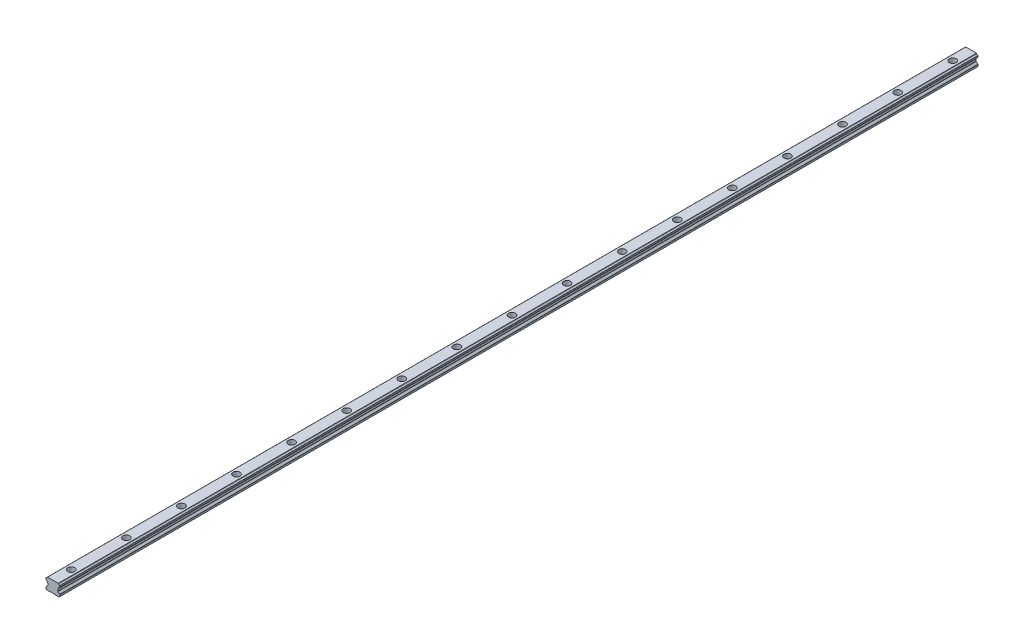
ISO-10303-21;
HEADER;
FILE_DESCRIPTION(('STEP AP214'),'2;1');
FILE_NAME('part.step','',(''),(''),'','','');
FILE_SCHEMA(('AUTOMOTIVE_DESIGN { 1 0 10303 214 1 1 1 1 }'));
ENDSEC;
DATA;
#1=APPLICATION_CONTEXT('core data for automotive mechanical design processes');
#2=APPLICATION_PROTOCOL_DEFINITION('international standard','automotive_design',2000,#1);
#3=PRODUCT_CONTEXT('',#1,'mechanical');
#4=PRODUCT('Part','Part','',(#3));
#5=PRODUCT_RELATED_PRODUCT_CATEGORY('part','',(#4));
#6=PRODUCT_DEFINITION_FORMATION('','',#4);
#7=PRODUCT_DEFINITION_CONTEXT('part definition',#1,'design');
#8=PRODUCT_DEFINITION('design','',#6,#7);
#9=PRODUCT_DEFINITION_SHAPE('','',#8);
#10=(LENGTH_UNIT() NAMED_UNIT(*) SI_UNIT(.MILLI.,.METRE.));
#11=(NAMED_UNIT(*) PLANE_ANGLE_UNIT() SI_UNIT($,.RADIAN.));
#12=(NAMED_UNIT(*) SI_UNIT($,.STERADIAN.) SOLID_ANGLE_UNIT());
#13=UNCERTAINTY_MEASURE_WITH_UNIT(LENGTH_MEASURE(1.E-05),#10,'distance_accuracy_value','');
#14=(GEOMETRIC_REPRESENTATION_CONTEXT(3) GLOBAL_UNCERTAINTY_ASSIGNED_CONTEXT((#13)) GLOBAL_UNIT_ASSIGNED_CONTEXT((#10,
#11,#12)) REPRESENTATION_CONTEXT('',''));
#15=CARTESIAN_POINT('',(0.,0.,0.));
#16=DIRECTION('',(0.,0.,1.));
#17=DIRECTION('',(1.,0.,0.));
#18=AXIS2_PLACEMENT_3D('',#15,#16,#17);
#19=CARTESIAN_POINT('',(-1.78547898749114,-5.64575983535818,1000.));
#20=DIRECTION('',(0.,1.,0.));
#21=DIRECTION('',(0.,0.,1.));
#22=AXIS2_PLACEMENT_3D('',#19,#20,#21);
#23=PLANE('',#22);
#24=DIRECTION('',(0.,0.,-1.));
#25=VECTOR('',#24,1.);
#26=CARTESIAN_POINT('',(2.31454099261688,-5.64575983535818,1000.));
#27=LINE('',#26,#25);
#28=CARTESIAN_POINT('',(2.31454099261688,-5.64575983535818,79.0726602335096));
#29=VERTEX_POINT('',#28);
#30=CARTESIAN_POINT('',(2.31454099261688,-5.64575983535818,20.9273397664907));
#31=VERTEX_POINT('',#30);
#32=EDGE_CURVE('E488',#29,#31,#27,.T.);
#33=ORIENTED_EDGE('',*,*,#32,.F.);
#34=CARTESIAN_POINT('',(0.26453100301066,-5.64575983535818,79.9999999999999));
#35=DIRECTION('',(0.,1.,0.));
#36=DIRECTION('',(0.,0.,1.));
#37=AXIS2_PLACEMENT_3D('',#34,#35,#36);
#38=CIRCLE('',#37,2.25);
#39=CARTESIAN_POINT('',(-1.78547898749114,-5.64575983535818,79.0726602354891));
#40=VERTEX_POINT('',#39);
#41=EDGE_CURVE('E61',#29,#40,#38,.T.);
#42=ORIENTED_EDGE('',*,*,#41,.T.);
#43=DIRECTION('',(0.,0.,-1.));
#44=VECTOR('',#43,1.);
#45=CARTESIAN_POINT('',(-1.78547898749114,-5.64575983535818,1000.));
#46=LINE('',#45,#44);
#47=CARTESIAN_POINT('',(-1.78547898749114,-5.64575983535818,20.9273397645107));
#48=VERTEX_POINT('',#47);
#49=EDGE_CURVE('E509',#40,#48,#46,.T.);
#50=ORIENTED_EDGE('',*,*,#49,.T.);
#51=CARTESIAN_POINT('',(0.264531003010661,-5.64575983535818,20.));
#52=DIRECTION('',(0.,1.,0.));
#53=DIRECTION('',(0.,0.,1.));
#54=AXIS2_PLACEMENT_3D('',#51,#52,#53);
#55=CIRCLE('',#54,2.25);
#56=EDGE_CURVE('E1032',#48,#31,#55,.T.);
#57=ORIENTED_EDGE('',*,*,#56,.T.);
#58=EDGE_LOOP('',(#33,#42,#50,#57));
#59=FACE_BOUND('',#58,.T.);
#60=ADVANCED_FACE('F45',(#59),#23,.F.);
#61=CARTESIAN_POINT('',(-1.78547898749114,-5.64575983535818,139.072660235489));
#62=VERTEX_POINT('',#61);
#63=CARTESIAN_POINT('',(-1.78547898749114,-5.64575983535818,80.9273397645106));
#64=VERTEX_POINT('',#63);
#65=EDGE_CURVE('E480',#62,#64,#46,.T.);
#66=ORIENTED_EDGE('',*,*,#65,.T.);
#67=CARTESIAN_POINT('',(2.31454099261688,-5.64575983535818,80.9273397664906));
#68=VERTEX_POINT('',#67);
#69=EDGE_CURVE('E469',#64,#68,#38,.T.);
#70=ORIENTED_EDGE('',*,*,#69,.T.);
#71=CARTESIAN_POINT('',(2.31454099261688,-5.64575983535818,139.072660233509));
#72=VERTEX_POINT('',#71);
#73=EDGE_CURVE('E478',#72,#68,#27,.T.);
#74=ORIENTED_EDGE('',*,*,#73,.F.);
#75=CARTESIAN_POINT('',(0.26453100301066,-5.64575983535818,140.));
#76=DIRECTION('',(0.,1.,0.));
#77=DIRECTION('',(0.,0.,1.));
#78=AXIS2_PLACEMENT_3D('',#75,#76,#77);
#79=CIRCLE('',#78,2.25);
#80=EDGE_CURVE('E68',#72,#62,#79,.T.);
#81=ORIENTED_EDGE('',*,*,#80,.T.);
#82=EDGE_LOOP('',(#66,#70,#74,#81));
#83=FACE_BOUND('',#82,.T.);
#84=ADVANCED_FACE('F477',(#83),#23,.F.);
#85=CARTESIAN_POINT('',(-1.78547898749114,-5.64575983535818,199.072660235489));
#86=VERTEX_POINT('',#85);
#87=CARTESIAN_POINT('',(-1.78547898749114,-5.64575983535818,140.92733976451));
#88=VERTEX_POINT('',#87);
#89=EDGE_CURVE('E680',#86,#88,#46,.T.);
#90=ORIENTED_EDGE('',*,*,#89,.T.);
#91=CARTESIAN_POINT('',(2.31454099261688,-5.64575983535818,140.92733976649));
#92=VERTEX_POINT('',#91);
#93=EDGE_CURVE('E1520',#88,#92,#79,.T.);
#94=ORIENTED_EDGE('',*,*,#93,.T.);
#95=CARTESIAN_POINT('',(2.31454099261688,-5.64575983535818,199.072660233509));
#96=VERTEX_POINT('',#95);
#97=EDGE_CURVE('E487',#96,#92,#27,.T.);
#98=ORIENTED_EDGE('',*,*,#97,.F.);
#99=CARTESIAN_POINT('',(0.26453100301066,-5.64575983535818,199.999999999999));
#100=DIRECTION('',(0.,1.,0.));
#101=DIRECTION('',(0.,0.,1.));
#102=AXIS2_PLACEMENT_3D('',#99,#100,#101);
#103=CIRCLE('',#102,2.25);
#104=EDGE_CURVE('E737',#96,#86,#103,.T.);
#105=ORIENTED_EDGE('',*,*,#104,.T.);
#106=EDGE_LOOP('',(#90,#94,#98,#105));
#107=FACE_BOUND('',#106,.T.);
#108=ADVANCED_FACE('F1456',(#107),#23,.F.);
#109=CARTESIAN_POINT('',(-1.78547898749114,-5.64575983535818,259.072660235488));
#110=VERTEX_POINT('',#109);
#111=CARTESIAN_POINT('',(-1.78547898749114,-5.64575983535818,200.92733976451));
#112=VERTEX_POINT('',#111);
#113=EDGE_CURVE('E677',#110,#112,#46,.T.);
#114=ORIENTED_EDGE('',*,*,#113,.T.);
#115=CARTESIAN_POINT('',(2.31454099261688,-5.64575983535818,200.92733976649));
#116=VERTEX_POINT('',#115);
#117=EDGE_CURVE('E734',#112,#116,#103,.T.);
#118=ORIENTED_EDGE('',*,*,#117,.T.);
#119=CARTESIAN_POINT('',(2.31454099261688,-5.64575983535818,259.072660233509));
#120=VERTEX_POINT('',#119);
#121=EDGE_CURVE('E492',#120,#116,#27,.T.);
#122=ORIENTED_EDGE('',*,*,#121,.F.);
#123=CARTESIAN_POINT('',(0.26453100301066,-5.64575983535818,259.999999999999));
#124=DIRECTION('',(0.,1.,0.));
#125=DIRECTION('',(0.,0.,1.));
#126=AXIS2_PLACEMENT_3D('',#123,#124,#125);
#127=CIRCLE('',#126,2.25);
#128=EDGE_CURVE('E732',#120,#110,#127,.T.);
#129=ORIENTED_EDGE('',*,*,#128,.T.);
#130=EDGE_LOOP('',(#114,#118,#122,#129));
#131=FACE_BOUND('',#130,.T.);
#132=ADVANCED_FACE('F731',(#131),#23,.F.);
#133=CARTESIAN_POINT('',(-1.78547898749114,-5.64575983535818,319.072660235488));
#134=VERTEX_POINT('',#133);
#135=CARTESIAN_POINT('',(-1.78547898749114,-5.64575983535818,260.92733976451));
#136=VERTEX_POINT('',#135);
#137=EDGE_CURVE('E674',#134,#136,#46,.T.);
#138=ORIENTED_EDGE('',*,*,#137,.T.);
#139=CARTESIAN_POINT('',(2.31454099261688,-5.64575983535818,260.92733976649));
#140=VERTEX_POINT('',#139);
#141=EDGE_CURVE('E762',#136,#140,#127,.T.);
#142=ORIENTED_EDGE('',*,*,#141,.T.);
#143=CARTESIAN_POINT('',(2.31454099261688,-5.64575983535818,319.072660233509));
#144=VERTEX_POINT('',#143);
#145=EDGE_CURVE('E718',#144,#140,#27,.T.);
#146=ORIENTED_EDGE('',*,*,#145,.F.);
#147=CARTESIAN_POINT('',(0.26453100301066,-5.64575983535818,319.999999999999));
#148=DIRECTION('',(0.,1.,0.));
#149=DIRECTION('',(0.,0.,1.));
#150=AXIS2_PLACEMENT_3D('',#147,#148,#149);
#151=CIRCLE('',#150,2.25);
#152=EDGE_CURVE('E784',#144,#134,#151,.T.);
#153=ORIENTED_EDGE('',*,*,#152,.T.);
#154=EDGE_LOOP('',(#138,#142,#146,#153));
#155=FACE_BOUND('',#154,.T.);
#156=ADVANCED_FACE('F1376',(#155),#23,.F.);
#157=CARTESIAN_POINT('',(-1.78547898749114,-5.64575983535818,379.072660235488));
#158=VERTEX_POINT('',#157);
#159=CARTESIAN_POINT('',(-1.78547898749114,-5.64575983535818,320.92733976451));
#160=VERTEX_POINT('',#159);
#161=EDGE_CURVE('E671',#158,#160,#46,.T.);
#162=ORIENTED_EDGE('',*,*,#161,.T.);
#163=CARTESIAN_POINT('',(2.31454099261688,-5.64575983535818,320.92733976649));
#164=VERTEX_POINT('',#163);
#165=EDGE_CURVE('E780',#160,#164,#151,.T.);
#166=ORIENTED_EDGE('',*,*,#165,.T.);
#167=CARTESIAN_POINT('',(2.31454099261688,-5.64575983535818,379.072660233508));
#168=VERTEX_POINT('',#167);
#169=EDGE_CURVE('E715',#168,#164,#27,.T.);
#170=ORIENTED_EDGE('',*,*,#169,.F.);
#171=CARTESIAN_POINT('',(0.26453100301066,-5.64575983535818,379.999999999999));
#172=DIRECTION('',(0.,1.,0.));
#173=DIRECTION('',(0.,0.,1.));
#174=AXIS2_PLACEMENT_3D('',#171,#172,#173);
#175=CIRCLE('',#174,2.25);
#176=EDGE_CURVE('E805',#168,#158,#175,.T.);
#177=ORIENTED_EDGE('',*,*,#176,.T.);
#178=EDGE_LOOP('',(#162,#166,#170,#177));
#179=FACE_BOUND('',#178,.T.);
#180=ADVANCED_FACE('F1384',(#179),#23,.F.);
#181=CARTESIAN_POINT('',(-1.78547898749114,-5.64575983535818,439.072660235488));
#182=VERTEX_POINT('',#181);
#183=CARTESIAN_POINT('',(-1.78547898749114,-5.64575983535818,380.927339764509));
#184=VERTEX_POINT('',#183);
#185=EDGE_CURVE('E668',#182,#184,#46,.T.);
#186=ORIENTED_EDGE('',*,*,#185,.T.);
#187=CARTESIAN_POINT('',(2.31454099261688,-5.64575983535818,380.927339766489));
#188=VERTEX_POINT('',#187);
#189=EDGE_CURVE('E801',#184,#188,#175,.T.);
#190=ORIENTED_EDGE('',*,*,#189,.T.);
#191=CARTESIAN_POINT('',(2.31454099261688,-5.64575983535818,439.072660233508));
#192=VERTEX_POINT('',#191);
#193=EDGE_CURVE('E712',#192,#188,#27,.T.);
#194=ORIENTED_EDGE('',*,*,#193,.F.);
#195=CARTESIAN_POINT('',(0.26453100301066,-5.64575983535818,439.999999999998));
#196=DIRECTION('',(0.,1.,0.));
#197=DIRECTION('',(0.,0.,1.));
#198=AXIS2_PLACEMENT_3D('',#195,#196,#197);
#199=CIRCLE('',#198,2.25);
#200=EDGE_CURVE('E826',#192,#182,#199,.T.);
#201=ORIENTED_EDGE('',*,*,#200,.T.);
#202=EDGE_LOOP('',(#186,#190,#194,#201));
#203=FACE_BOUND('',#202,.T.);
#204=ADVANCED_FACE('F1388',(#203),#23,.F.);
#205=CARTESIAN_POINT('',(-1.78547898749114,-5.64575983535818,499.072660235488));
#206=VERTEX_POINT('',#205);
#207=CARTESIAN_POINT('',(-1.78547898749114,-5.64575983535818,440.927339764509));
#208=VERTEX_POINT('',#207);
#209=EDGE_CURVE('E665',#206,#208,#46,.T.);
#210=ORIENTED_EDGE('',*,*,#209,.T.);
#211=CARTESIAN_POINT('',(2.31454099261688,-5.64575983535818,440.927339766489));
#212=VERTEX_POINT('',#211);
#213=EDGE_CURVE('E822',#208,#212,#199,.T.);
#214=ORIENTED_EDGE('',*,*,#213,.T.);
#215=CARTESIAN_POINT('',(2.31454099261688,-5.64575983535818,499.072660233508));
#216=VERTEX_POINT('',#215);
#217=EDGE_CURVE('E709',#216,#212,#27,.T.);
#218=ORIENTED_EDGE('',*,*,#217,.F.);
#219=CARTESIAN_POINT('',(0.26453100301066,-5.64575983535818,499.999999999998));
#220=DIRECTION('',(0.,1.,0.));
#221=DIRECTION('',(0.,0.,1.));
#222=AXIS2_PLACEMENT_3D('',#219,#220,#221);
#223=CIRCLE('',#222,2.25);
#224=EDGE_CURVE('E847',#216,#206,#223,.T.);
#225=ORIENTED_EDGE('',*,*,#224,.T.);
#226=EDGE_LOOP('',(#210,#214,#218,#225));
#227=FACE_BOUND('',#226,.T.);
#228=ADVANCED_FACE('F1394',(#227),#23,.F.);
#229=CARTESIAN_POINT('',(-1.78547898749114,-5.64575983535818,559.072660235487));
#230=VERTEX_POINT('',#229);
#231=CARTESIAN_POINT('',(-1.78547898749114,-5.64575983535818,500.927339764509));
#232=VERTEX_POINT('',#231);
#233=EDGE_CURVE('E662',#230,#232,#46,.T.);
#234=ORIENTED_EDGE('',*,*,#233,.T.);
#235=CARTESIAN_POINT('',(2.31454099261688,-5.64575983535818,500.927339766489));
#236=VERTEX_POINT('',#235);
#237=EDGE_CURVE('E843',#232,#236,#223,.T.);
#238=ORIENTED_EDGE('',*,*,#237,.T.);
#239=CARTESIAN_POINT('',(2.31454099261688,-5.64575983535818,559.072660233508));
#240=VERTEX_POINT('',#239);
#241=EDGE_CURVE('E706',#240,#236,#27,.T.);
#242=ORIENTED_EDGE('',*,*,#241,.F.);
#243=CARTESIAN_POINT('',(0.26453100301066,-5.64575983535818,559.999999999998));
#244=DIRECTION('',(0.,1.,0.));
#245=DIRECTION('',(0.,0.,1.));
#246=AXIS2_PLACEMENT_3D('',#243,#244,#245);
#247=CIRCLE('',#246,2.25);
#248=EDGE_CURVE('E868',#240,#230,#247,.T.);
#249=ORIENTED_EDGE('',*,*,#248,.T.);
#250=EDGE_LOOP('',(#234,#238,#242,#249));
#251=FACE_BOUND('',#250,.T.);
#252=ADVANCED_FACE('F1399',(#251),#23,.F.);
#253=CARTESIAN_POINT('',(-1.78547898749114,-5.64575983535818,619.072660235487));
#254=VERTEX_POINT('',#253);
#255=CARTESIAN_POINT('',(-1.78547898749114,-5.64575983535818,560.927339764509));
#256=VERTEX_POINT('',#255);
#257=EDGE_CURVE('E659',#254,#256,#46,.T.);
#258=ORIENTED_EDGE('',*,*,#257,.T.);
#259=CARTESIAN_POINT('',(2.31454099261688,-5.64575983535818,560.927339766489));
#260=VERTEX_POINT('',#259);
#261=EDGE_CURVE('E864',#256,#260,#247,.T.);
#262=ORIENTED_EDGE('',*,*,#261,.T.);
#263=CARTESIAN_POINT('',(2.31454099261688,-5.64575983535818,619.072660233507));
#264=VERTEX_POINT('',#263);
#265=EDGE_CURVE('E703',#264,#260,#27,.T.);
#266=ORIENTED_EDGE('',*,*,#265,.F.);
#267=CARTESIAN_POINT('',(0.26453100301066,-5.64575983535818,619.999999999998));
#268=DIRECTION('',(0.,1.,0.));
#269=DIRECTION('',(0.,0.,1.));
#270=AXIS2_PLACEMENT_3D('',#267,#268,#269);
#271=CIRCLE('',#270,2.25);
#272=EDGE_CURVE('E889',#264,#254,#271,.T.);
#273=ORIENTED_EDGE('',*,*,#272,.T.);
#274=EDGE_LOOP('',(#258,#262,#266,#273));
#275=FACE_BOUND('',#274,.T.);
#276=ADVANCED_FACE('F1405',(#275),#23,.F.);
#277=CARTESIAN_POINT('',(-1.78547898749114,-5.64575983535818,679.072660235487));
#278=VERTEX_POINT('',#277);
#279=CARTESIAN_POINT('',(-1.78547898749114,-5.64575983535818,620.927339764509));
#280=VERTEX_POINT('',#279);
#281=EDGE_CURVE('E656',#278,#280,#46,.T.);
#282=ORIENTED_EDGE('',*,*,#281,.T.);
#283=CARTESIAN_POINT('',(2.31454099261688,-5.64575983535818,620.927339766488));
#284=VERTEX_POINT('',#283);
#285=EDGE_CURVE('E885',#280,#284,#271,.T.);
#286=ORIENTED_EDGE('',*,*,#285,.T.);
#287=CARTESIAN_POINT('',(2.31454099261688,-5.64575983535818,679.072660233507));
#288=VERTEX_POINT('',#287);
#289=EDGE_CURVE('E700',#288,#284,#27,.T.);
#290=ORIENTED_EDGE('',*,*,#289,.F.);
#291=CARTESIAN_POINT('',(0.26453100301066,-5.64575983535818,679.999999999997));
#292=DIRECTION('',(0.,1.,0.));
#293=DIRECTION('',(0.,0.,1.));
#294=AXIS2_PLACEMENT_3D('',#291,#292,#293);
#295=CIRCLE('',#294,2.25);
#296=EDGE_CURVE('E910',#288,#278,#295,.T.);
#297=ORIENTED_EDGE('',*,*,#296,.T.);
#298=EDGE_LOOP('',(#282,#286,#290,#297));
#299=FACE_BOUND('',#298,.T.);
#300=ADVANCED_FACE('F1410',(#299),#23,.F.);
#301=CARTESIAN_POINT('',(-1.78547898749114,-5.64575983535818,739.072660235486));
#302=VERTEX_POINT('',#301);
#303=CARTESIAN_POINT('',(-1.78547898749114,-5.64575983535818,680.927339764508));
#304=VERTEX_POINT('',#303);
#305=EDGE_CURVE('E653',#302,#304,#46,.T.);
#306=ORIENTED_EDGE('',*,*,#305,.T.);
#307=CARTESIAN_POINT('',(2.31454099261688,-5.64575983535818,680.927339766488));
#308=VERTEX_POINT('',#307);
#309=EDGE_CURVE('E906',#304,#308,#295,.T.);
#310=ORIENTED_EDGE('',*,*,#309,.T.);
#311=CARTESIAN_POINT('',(2.31454099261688,-5.64575983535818,739.072660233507));
#312=VERTEX_POINT('',#311);
#313=EDGE_CURVE('E697',#312,#308,#27,.T.);
#314=ORIENTED_EDGE('',*,*,#313,.F.);
#315=CARTESIAN_POINT('',(0.26453100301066,-5.64575983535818,739.999999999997));
#316=DIRECTION('',(0.,1.,0.));
#317=DIRECTION('',(0.,0.,1.));
#318=AXIS2_PLACEMENT_3D('',#315,#316,#317);
#319=CIRCLE('',#318,2.25);
#320=EDGE_CURVE('E931',#312,#302,#319,.T.);
#321=ORIENTED_EDGE('',*,*,#320,.T.);
#322=EDGE_LOOP('',(#306,#310,#314,#321));
#323=FACE_BOUND('',#322,.T.);
#324=ADVANCED_FACE('F1416',(#323),#23,.F.);
#325=CARTESIAN_POINT('',(-1.78547898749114,-5.64575983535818,799.072660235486));
#326=VERTEX_POINT('',#325);
#327=CARTESIAN_POINT('',(-1.78547898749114,-5.64575983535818,740.927339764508));
#328=VERTEX_POINT('',#327);
#329=EDGE_CURVE('E650',#326,#328,#46,.T.);
#330=ORIENTED_EDGE('',*,*,#329,.T.);
#331=CARTESIAN_POINT('',(2.31454099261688,-5.64575983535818,740.927339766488));
#332=VERTEX_POINT('',#331);
#333=EDGE_CURVE('E927',#328,#332,#319,.T.);
#334=ORIENTED_EDGE('',*,*,#333,.T.);
#335=CARTESIAN_POINT('',(2.31454099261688,-5.64575983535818,799.072660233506));
#336=VERTEX_POINT('',#335);
#337=EDGE_CURVE('E694',#336,#332,#27,.T.);
#338=ORIENTED_EDGE('',*,*,#337,.F.);
#339=CARTESIAN_POINT('',(0.26453100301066,-5.64575983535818,799.999999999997));
#340=DIRECTION('',(0.,1.,0.));
#341=DIRECTION('',(0.,0.,1.));
#342=AXIS2_PLACEMENT_3D('',#339,#340,#341);
#343=CIRCLE('',#342,2.25);
#344=EDGE_CURVE('E952',#336,#326,#343,.T.);
#345=ORIENTED_EDGE('',*,*,#344,.T.);
#346=EDGE_LOOP('',(#330,#334,#338,#345));
#347=FACE_BOUND('',#346,.T.);
#348=ADVANCED_FACE('F1421',(#347),#23,.F.);
#349=CARTESIAN_POINT('',(-1.78547898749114,-5.64575983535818,859.072660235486));
#350=VERTEX_POINT('',#349);
#351=CARTESIAN_POINT('',(-1.78547898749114,-5.64575983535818,800.927339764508));
#352=VERTEX_POINT('',#351);
#353=EDGE_CURVE('E647',#350,#352,#46,.T.);
#354=ORIENTED_EDGE('',*,*,#353,.T.);
#355=CARTESIAN_POINT('',(2.31454099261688,-5.64575983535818,800.927339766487));
#356=VERTEX_POINT('',#355);
#357=EDGE_CURVE('E948',#352,#356,#343,.T.);
#358=ORIENTED_EDGE('',*,*,#357,.T.);
#359=CARTESIAN_POINT('',(2.31454099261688,-5.64575983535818,859.072660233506));
#360=VERTEX_POINT('',#359);
#361=EDGE_CURVE('E691',#360,#356,#27,.T.);
#362=ORIENTED_EDGE('',*,*,#361,.F.);
#363=CARTESIAN_POINT('',(0.26453100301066,-5.64575983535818,859.999999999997));
#364=DIRECTION('',(0.,1.,0.));
#365=DIRECTION('',(0.,0.,1.));
#366=AXIS2_PLACEMENT_3D('',#363,#364,#365);
#367=CIRCLE('',#366,2.25);
#368=EDGE_CURVE('E973',#360,#350,#367,.T.);
#369=ORIENTED_EDGE('',*,*,#368,.T.);
#370=EDGE_LOOP('',(#354,#358,#362,#369));
#371=FACE_BOUND('',#370,.T.);
#372=ADVANCED_FACE('F1427',(#371),#23,.F.);
#373=CARTESIAN_POINT('',(6.09509231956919,6.5542449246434,1000.));
#374=DIRECTION('',(0.,-1.,0.));
#375=DIRECTION('',(0.,0.,-1.));
#376=AXIS2_PLACEMENT_3D('',#373,#374,#375);
#377=PLANE('',#376);
#378=CARTESIAN_POINT('',(0.26453100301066,6.5542449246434,79.9999999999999));
#379=DIRECTION('',(0.,1.,0.));
#380=DIRECTION('',(0.,0.,1.));
#381=AXIS2_PLACEMENT_3D('',#378,#379,#380);
#382=CIRCLE('',#381,3.75);
#383=CARTESIAN_POINT('',(0.26453100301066,6.5542449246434,83.7499999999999));
#384=VERTEX_POINT('',#383);
#385=EDGE_CURVE('E2771',#384,#384,#382,.T.);
#386=ORIENTED_EDGE('',*,*,#385,.F.);
#387=EDGE_LOOP('',(#386));
#388=FACE_BOUND('',#387,.T.);
#389=CARTESIAN_POINT('',(0.26453100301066,6.5542449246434,140.));
#390=DIRECTION('',(0.,1.,0.));
#391=DIRECTION('',(0.,0.,1.));
#392=AXIS2_PLACEMENT_3D('',#389,#390,#391);
#393=CIRCLE('',#392,3.75);
#394=CARTESIAN_POINT('',(0.26453100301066,6.5542449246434,143.75));
#395=VERTEX_POINT('',#394);
#396=EDGE_CURVE('E2744',#395,#395,#393,.T.);
#397=ORIENTED_EDGE('',*,*,#396,.F.);
#398=EDGE_LOOP('',(#397));
#399=FACE_BOUND('',#398,.T.);
#400=CARTESIAN_POINT('',(0.26453100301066,6.5542449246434,199.999999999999));
#401=DIRECTION('',(0.,1.,0.));
#402=DIRECTION('',(0.,0.,1.));
#403=AXIS2_PLACEMENT_3D('',#400,#401,#402);
#404=CIRCLE('',#403,3.75);
#405=CARTESIAN_POINT('',(0.26453100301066,6.5542449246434,203.749999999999));
#406=VERTEX_POINT('',#405);
#407=EDGE_CURVE('E1524',#406,#406,#404,.T.);
#408=ORIENTED_EDGE('',*,*,#407,.F.);
#409=EDGE_LOOP('',(#408));
#410=FACE_BOUND('',#409,.T.);
#411=CARTESIAN_POINT('',(0.26453100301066,6.5542449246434,259.999999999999));
#412=DIRECTION('',(0.,1.,0.));
#413=DIRECTION('',(0.,0.,1.));
#414=AXIS2_PLACEMENT_3D('',#411,#412,#413);
#415=CIRCLE('',#414,3.75);
#416=CARTESIAN_POINT('',(0.26453100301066,6.5542449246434,263.749999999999));
#417=VERTEX_POINT('',#416);
#418=EDGE_CURVE('E750',#417,#417,#415,.T.);
#419=ORIENTED_EDGE('',*,*,#418,.F.);
#420=EDGE_LOOP('',(#419));
#421=FACE_BOUND('',#420,.T.);
#422=CARTESIAN_POINT('',(0.26453100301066,6.5542449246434,319.999999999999));
#423=DIRECTION('',(0.,1.,0.));
#424=DIRECTION('',(0.,0.,1.));
#425=AXIS2_PLACEMENT_3D('',#422,#423,#424);
#426=CIRCLE('',#425,3.75);
#427=CARTESIAN_POINT('',(0.26453100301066,6.5542449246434,323.749999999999));
#428=VERTEX_POINT('',#427);
#429=EDGE_CURVE('E768',#428,#428,#426,.T.);
#430=ORIENTED_EDGE('',*,*,#429,.F.);
#431=EDGE_LOOP('',(#430));
#432=FACE_BOUND('',#431,.T.);
#433=CARTESIAN_POINT('',(0.26453100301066,6.5542449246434,379.999999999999));
#434=DIRECTION('',(0.,1.,0.));
#435=DIRECTION('',(0.,0.,1.));
#436=AXIS2_PLACEMENT_3D('',#433,#434,#435);
#437=CIRCLE('',#436,3.75);
#438=CARTESIAN_POINT('',(0.26453100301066,6.5542449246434,383.749999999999));
#439=VERTEX_POINT('',#438);
#440=EDGE_CURVE('E789',#439,#439,#437,.T.);
#441=ORIENTED_EDGE('',*,*,#440,.F.);
#442=EDGE_LOOP('',(#441));
#443=FACE_BOUND('',#442,.T.);
#444=CARTESIAN_POINT('',(0.26453100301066,6.5542449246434,439.999999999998));
#445=DIRECTION('',(0.,1.,0.));
#446=DIRECTION('',(0.,0.,1.));
#447=AXIS2_PLACEMENT_3D('',#444,#445,#446);
#448=CIRCLE('',#447,3.75);
#449=CARTESIAN_POINT('',(0.26453100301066,6.5542449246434,443.749999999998));
#450=VERTEX_POINT('',#449);
#451=EDGE_CURVE('E810',#450,#450,#448,.T.);
#452=ORIENTED_EDGE('',*,*,#451,.F.);
#453=EDGE_LOOP('',(#452));
#454=FACE_BOUND('',#453,.T.);
#455=CARTESIAN_POINT('',(0.26453100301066,6.5542449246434,499.999999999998));
#456=DIRECTION('',(0.,1.,0.));
#457=DIRECTION('',(0.,0.,1.));
#458=AXIS2_PLACEMENT_3D('',#455,#456,#457);
#459=CIRCLE('',#458,3.75);
#460=CARTESIAN_POINT('',(0.26453100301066,6.5542449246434,503.749999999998));
#461=VERTEX_POINT('',#460);
#462=EDGE_CURVE('E831',#461,#461,#459,.T.);
#463=ORIENTED_EDGE('',*,*,#462,.F.);
#464=EDGE_LOOP('',(#463));
#465=FACE_BOUND('',#464,.T.);
#466=CARTESIAN_POINT('',(0.26453100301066,6.5542449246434,559.999999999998));
#467=DIRECTION('',(0.,1.,0.));
#468=DIRECTION('',(0.,0.,1.));
#469=AXIS2_PLACEMENT_3D('',#466,#467,#468);
#470=CIRCLE('',#469,3.75);
#471=CARTESIAN_POINT('',(0.26453100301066,6.5542449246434,563.749999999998));
#472=VERTEX_POINT('',#471);
#473=EDGE_CURVE('E852',#472,#472,#470,.T.);
#474=ORIENTED_EDGE('',*,*,#473,.F.);
#475=EDGE_LOOP('',(#474));
#476=FACE_BOUND('',#475,.T.);
#477=CARTESIAN_POINT('',(0.26453100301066,6.5542449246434,619.999999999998));
#478=DIRECTION('',(0.,1.,0.));
#479=DIRECTION('',(0.,0.,1.));
#480=AXIS2_PLACEMENT_3D('',#477,#478,#479);
#481=CIRCLE('',#480,3.75);
#482=CARTESIAN_POINT('',(0.26453100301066,6.5542449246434,623.749999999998));
#483=VERTEX_POINT('',#482);
#484=EDGE_CURVE('E873',#483,#483,#481,.T.);
#485=ORIENTED_EDGE('',*,*,#484,.F.);
#486=EDGE_LOOP('',(#485));
#487=FACE_BOUND('',#486,.T.);
#488=CARTESIAN_POINT('',(0.26453100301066,6.5542449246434,679.999999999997));
#489=DIRECTION('',(0.,1.,0.));
#490=DIRECTION('',(0.,0.,1.));
#491=AXIS2_PLACEMENT_3D('',#488,#489,#490);
#492=CIRCLE('',#491,3.75);
#493=CARTESIAN_POINT('',(0.26453100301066,6.5542449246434,683.749999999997));
#494=VERTEX_POINT('',#493);
#495=EDGE_CURVE('E894',#494,#494,#492,.T.);
#496=ORIENTED_EDGE('',*,*,#495,.F.);
#497=EDGE_LOOP('',(#496));
#498=FACE_BOUND('',#497,.T.);
#499=CARTESIAN_POINT('',(0.26453100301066,6.5542449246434,739.999999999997));
#500=DIRECTION('',(0.,1.,0.));
#501=DIRECTION('',(0.,0.,1.));
#502=AXIS2_PLACEMENT_3D('',#499,#500,#501);
#503=CIRCLE('',#502,3.75);
#504=CARTESIAN_POINT('',(0.26453100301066,6.5542449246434,743.749999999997));
#505=VERTEX_POINT('',#504);
#506=EDGE_CURVE('E915',#505,#505,#503,.T.);
#507=ORIENTED_EDGE('',*,*,#506,.F.);
#508=EDGE_LOOP('',(#507));
#509=FACE_BOUND('',#508,.T.);
#510=CARTESIAN_POINT('',(0.26453100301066,6.5542449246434,799.999999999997));
#511=DIRECTION('',(0.,1.,0.));
#512=DIRECTION('',(0.,0.,1.));
#513=AXIS2_PLACEMENT_3D('',#510,#511,#512);
#514=CIRCLE('',#513,3.75);
#515=CARTESIAN_POINT('',(0.26453100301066,6.5542449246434,803.749999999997));
#516=VERTEX_POINT('',#515);
#517=EDGE_CURVE('E936',#516,#516,#514,.T.);
#518=ORIENTED_EDGE('',*,*,#517,.F.);
#519=EDGE_LOOP('',(#518));
#520=FACE_BOUND('',#519,.T.);
#521=CARTESIAN_POINT('',(0.26453100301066,6.5542449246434,919.999999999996));
#522=DIRECTION('',(0.,1.,0.));
#523=DIRECTION('',(0.,0.,1.));
#524=AXIS2_PLACEMENT_3D('',#521,#522,#523);
#525=CIRCLE('',#524,3.75);
#526=CARTESIAN_POINT('',(0.26453100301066,6.5542449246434,923.749999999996));
#527=VERTEX_POINT('',#526);
#528=EDGE_CURVE('E978',#527,#527,#525,.T.);
#529=ORIENTED_EDGE('',*,*,#528,.F.);
#530=EDGE_LOOP('',(#529));
#531=FACE_BOUND('',#530,.T.);
#532=CARTESIAN_POINT('',(0.26453100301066,6.5542449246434,979.999999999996));
#533=DIRECTION('',(0.,1.,0.));
#534=DIRECTION('',(0.,0.,1.));
#535=AXIS2_PLACEMENT_3D('',#532,#533,#534);
#536=CIRCLE('',#535,3.75);
#537=CARTESIAN_POINT('',(0.26453100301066,6.5542449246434,983.749999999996));
#538=VERTEX_POINT('',#537);
#539=EDGE_CURVE('E999',#538,#538,#536,.T.);
#540=ORIENTED_EDGE('',*,*,#539,.F.);
#541=EDGE_LOOP('',(#540));
#542=FACE_BOUND('',#541,.T.);
#543=CARTESIAN_POINT('',(0.264531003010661,6.5542449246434,20.));
#544=DIRECTION('',(0.,1.,0.));
#545=DIRECTION('',(0.,0.,1.));
#546=AXIS2_PLACEMENT_3D('',#543,#544,#545);
#547=CIRCLE('',#546,3.75);
#548=CARTESIAN_POINT('',(0.264531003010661,6.5542449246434,23.75));
#549=VERTEX_POINT('',#548);
#550=EDGE_CURVE('E1020',#549,#549,#547,.T.);
#551=ORIENTED_EDGE('',*,*,#550,.F.);
#552=EDGE_LOOP('',(#551));
#553=FACE_BOUND('',#552,.T.);
#554=DIRECTION('',(-1.,0.,0.));
#555=VECTOR('',#554,1.);
#556=CARTESIAN_POINT('',(6.09509231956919,6.5542449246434,0.));
#557=LINE('',#556,#555);
#558=CARTESIAN_POINT('',(6.09509231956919,6.5542449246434,0.));
#559=VERTEX_POINT('',#558);
#560=CARTESIAN_POINT('',(-5.56603031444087,6.5542449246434,0.));
#561=VERTEX_POINT('',#560);
#562=EDGE_CURVE('E1153',#559,#561,#557,.T.);
#563=ORIENTED_EDGE('',*,*,#562,.T.);
#564=DIRECTION('',(0.,0.,-1.));
#565=VECTOR('',#564,1.);
#566=CARTESIAN_POINT('',(-5.56603031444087,6.5542449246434,1000.));
#567=LINE('',#566,#565);
#568=CARTESIAN_POINT('',(-5.56603031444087,6.5542449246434,1000.));
#569=VERTEX_POINT('',#568);
#570=EDGE_CURVE('E569',#569,#561,#567,.T.);
#571=ORIENTED_EDGE('',*,*,#570,.F.);
#572=DIRECTION('',(-1.,0.,0.));
#573=VECTOR('',#572,1.);
#574=CARTESIAN_POINT('',(6.09509231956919,6.5542449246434,1000.));
#575=LINE('',#574,#573);
#576=CARTESIAN_POINT('',(6.09509231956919,6.5542449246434,1000.));
#577=VERTEX_POINT('',#576);
#578=EDGE_CURVE('E1050',#577,#569,#575,.T.);
#579=ORIENTED_EDGE('',*,*,#578,.F.);
#580=DIRECTION('',(0.,0.,-1.));
#581=VECTOR('',#580,1.);
#582=CARTESIAN_POINT('',(6.09509231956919,6.5542449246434,1000.));
#583=LINE('',#582,#581);
#584=EDGE_CURVE('E573',#577,#559,#583,.T.);
#585=ORIENTED_EDGE('',*,*,#584,.T.);
#586=EDGE_LOOP('',(#563,#571,#579,#585));
#587=FACE_BOUND('',#586,.T.);
#588=CARTESIAN_POINT('',(0.26453100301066,6.5542449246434,859.999999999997));
#589=DIRECTION('',(0.,1.,0.));
#590=DIRECTION('',(0.,0.,1.));
#591=AXIS2_PLACEMENT_3D('',#588,#589,#590);
#592=CIRCLE('',#591,3.75);
#593=CARTESIAN_POINT('',(0.26453100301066,6.5542449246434,863.749999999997));
#594=VERTEX_POINT('',#593);
#595=EDGE_CURVE('E957',#594,#594,#592,.T.);
#596=ORIENTED_EDGE('',*,*,#595,.F.);
#597=EDGE_LOOP('',(#596));
#598=FACE_BOUND('',#597,.T.);
#599=ADVANCED_FACE('F1475',(#388,#399,#410,#421,#432,#443,#454,#465,#476,#487,#498,#509,#520,
#531,#542,#553,#587,#598),#377,.F.);
#600=CARTESIAN_POINT('',(-1.78547898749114,-5.64575983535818,919.072660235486));
#601=VERTEX_POINT('',#600);
#602=CARTESIAN_POINT('',(-1.78547898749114,-5.64575983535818,860.927339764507));
#603=VERTEX_POINT('',#602);
#604=EDGE_CURVE('E644',#601,#603,#46,.T.);
#605=ORIENTED_EDGE('',*,*,#604,.T.);
#606=CARTESIAN_POINT('',(2.31454099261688,-5.64575983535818,860.927339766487));
#607=VERTEX_POINT('',#606);
#608=EDGE_CURVE('E969',#603,#607,#367,.T.);
#609=ORIENTED_EDGE('',*,*,#608,.T.);
#610=CARTESIAN_POINT('',(2.31454099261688,-5.64575983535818,919.072660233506));
#611=VERTEX_POINT('',#610);
#612=EDGE_CURVE('E688',#611,#607,#27,.T.);
#613=ORIENTED_EDGE('',*,*,#612,.F.);
#614=CARTESIAN_POINT('',(0.26453100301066,-5.64575983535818,919.999999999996));
#615=DIRECTION('',(0.,1.,0.));
#616=DIRECTION('',(0.,0.,1.));
#617=AXIS2_PLACEMENT_3D('',#614,#615,#616);
#618=CIRCLE('',#617,2.25);
#619=EDGE_CURVE('E994',#611,#601,#618,.T.);
#620=ORIENTED_EDGE('',*,*,#619,.T.);
#621=EDGE_LOOP('',(#605,#609,#613,#620));
#622=FACE_BOUND('',#621,.T.);
#623=ADVANCED_FACE('F1431',(#622),#23,.F.);
#624=CARTESIAN_POINT('',(-1.78547898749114,-5.64575983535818,979.072660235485));
#625=VERTEX_POINT('',#624);
#626=CARTESIAN_POINT('',(-1.78547898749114,-5.64575983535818,920.927339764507));
#627=VERTEX_POINT('',#626);
#628=EDGE_CURVE('E508',#625,#627,#46,.T.);
#629=ORIENTED_EDGE('',*,*,#628,.T.);
#630=CARTESIAN_POINT('',(2.31454099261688,-5.64575983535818,920.927339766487));
#631=VERTEX_POINT('',#630);
#632=EDGE_CURVE('E990',#627,#631,#618,.T.);
#633=ORIENTED_EDGE('',*,*,#632,.T.);
#634=CARTESIAN_POINT('',(2.31454099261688,-5.64575983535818,979.072660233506));
#635=VERTEX_POINT('',#634);
#636=EDGE_CURVE('E500',#635,#631,#27,.T.);
#637=ORIENTED_EDGE('',*,*,#636,.F.);
#638=CARTESIAN_POINT('',(0.26453100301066,-5.64575983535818,979.999999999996));
#639=DIRECTION('',(0.,1.,0.));
#640=DIRECTION('',(0.,0.,1.));
#641=AXIS2_PLACEMENT_3D('',#638,#639,#640);
#642=CIRCLE('',#641,2.25);
#643=EDGE_CURVE('E1015',#635,#625,#642,.T.);
#644=ORIENTED_EDGE('',*,*,#643,.T.);
#645=EDGE_LOOP('',(#629,#633,#637,#644));
#646=FACE_BOUND('',#645,.T.);
#647=ADVANCED_FACE('F1348',(#646),#23,.F.);
#648=CARTESIAN_POINT('',(2.31454099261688,-5.64575983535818,19.0726602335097));
#649=VERTEX_POINT('',#648);
#650=CARTESIAN_POINT('',(2.31454099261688,-5.64575983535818,0.));
#651=VERTEX_POINT('',#650);
#652=EDGE_CURVE('E493',#649,#651,#27,.T.);
#653=ORIENTED_EDGE('',*,*,#652,.F.);
#654=CARTESIAN_POINT('',(-1.78547898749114,-5.64575983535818,19.0726602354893));
#655=VERTEX_POINT('',#654);
#656=EDGE_CURVE('E1036',#649,#655,#55,.T.);
#657=ORIENTED_EDGE('',*,*,#656,.T.);
#658=CARTESIAN_POINT('',(-1.78547898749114,-5.64575983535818,0.));
#659=VERTEX_POINT('',#658);
#660=EDGE_CURVE('E499',#655,#659,#46,.T.);
#661=ORIENTED_EDGE('',*,*,#660,.T.);
#662=DIRECTION('',(1.,0.,0.));
#663=VECTOR('',#662,1.);
#664=CARTESIAN_POINT('',(-1.78547898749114,-5.64575983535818,0.));
#665=LINE('',#664,#663);
#666=EDGE_CURVE('E1206',#659,#651,#665,.T.);
#667=ORIENTED_EDGE('',*,*,#666,.T.);
#668=EDGE_LOOP('',(#653,#657,#661,#667));
#669=FACE_BOUND('',#668,.T.);
#670=ADVANCED_FACE('F1317',(#669),#23,.F.);
#671=CARTESIAN_POINT('',(7.79352238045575,6.58323630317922,1000.));
#672=DIRECTION('',(0.,0.,-1.));
#673=DIRECTION('',(-1.,0.,0.));
#674=AXIS2_PLACEMENT_3D('',#671,#672,#673);
#675=CYLINDRICAL_SURFACE('',#674,1.49999999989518);
#676=CARTESIAN_POINT('',(7.79352238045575,6.58323630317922,0.));
#677=DIRECTION('',(0.,0.,-1.));
#678=DIRECTION('',(1.,0.,0.));
#679=AXIS2_PLACEMENT_3D('',#676,#677,#678);
#680=CIRCLE('',#679,1.49999999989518);
#681=CARTESIAN_POINT('',(7.68607431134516,5.08708961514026,0.));
#682=VERTEX_POINT('',#681);
#683=CARTESIAN_POINT('',(6.29737569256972,6.47578823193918,0.));
#684=VERTEX_POINT('',#683);
#685=EDGE_CURVE('E1041',#682,#684,#680,.T.);
#686=ORIENTED_EDGE('',*,*,#685,.T.);
#687=DIRECTION('',(0.,0.,-1.));
#688=VECTOR('',#687,1.);
#689=CARTESIAN_POINT('',(6.29737569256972,6.47578823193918,1000.));
#690=LINE('',#689,#688);
#691=CARTESIAN_POINT('',(6.29737569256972,6.47578823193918,1000.));
#692=VERTEX_POINT('',#691);
#693=EDGE_CURVE('E577',#692,#684,#690,.T.);
#694=ORIENTED_EDGE('',*,*,#693,.F.);
#695=CARTESIAN_POINT('',(7.79352238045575,6.58323630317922,1000.));
#696=DIRECTION('',(0.,0.,-1.));
#697=DIRECTION('',(1.,0.,0.));
#698=AXIS2_PLACEMENT_3D('',#695,#696,#697);
#699=CIRCLE('',#698,1.49999999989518);
#700=CARTESIAN_POINT('',(7.68607431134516,5.08708961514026,1000.));
#701=VERTEX_POINT('',#700);
#702=EDGE_CURVE('E1042',#701,#692,#699,.T.);
#703=ORIENTED_EDGE('',*,*,#702,.F.);
#704=DIRECTION('',(0.,0.,-1.));
#705=VECTOR('',#704,1.);
#706=CARTESIAN_POINT('',(7.68607431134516,5.08708961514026,1000.));
#707=LINE('',#706,#705);
#708=EDGE_CURVE('E1146',#701,#682,#707,.T.);
#709=ORIENTED_EDGE('',*,*,#708,.T.);
#710=EDGE_LOOP('',(#686,#694,#703,#709));
#711=FACE_BOUND('',#710,.T.);
#712=ADVANCED_FACE('F47',(#711),#675,.F.);
#713=CARTESIAN_POINT('',(6.0950923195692,6.25424492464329,1000.));
#714=DIRECTION('',(0.,0.,-1.));
#715=DIRECTION('',(-1.,0.,0.));
#716=AXIS2_PLACEMENT_3D('',#713,#714,#715);
#717=CYLINDRICAL_SURFACE('',#716,0.300000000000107);
#718=CARTESIAN_POINT('',(6.0950923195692,6.25424492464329,0.));
#719=DIRECTION('',(0.,0.,1.));
#720=DIRECTION('',(1.,0.,0.));
#721=AXIS2_PLACEMENT_3D('',#718,#719,#720);
#722=CIRCLE('',#721,0.300000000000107);
#723=EDGE_CURVE('E1150',#684,#559,#722,.T.);
#724=ORIENTED_EDGE('',*,*,#723,.T.);
#725=ORIENTED_EDGE('',*,*,#584,.F.);
#726=CARTESIAN_POINT('',(6.0950923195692,6.25424492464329,1000.));
#727=DIRECTION('',(0.,0.,1.));
#728=DIRECTION('',(1.,0.,0.));
#729=AXIS2_PLACEMENT_3D('',#726,#727,#728);
#730=CIRCLE('',#729,0.300000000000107);
#731=EDGE_CURVE('E1046',#692,#577,#730,.T.);
#732=ORIENTED_EDGE('',*,*,#731,.F.);
#733=ORIENTED_EDGE('',*,*,#693,.T.);
#734=EDGE_LOOP('',(#724,#725,#732,#733));
#735=FACE_BOUND('',#734,.T.);
#736=ADVANCED_FACE('F1470',(#735),#717,.T.);
#737=CARTESIAN_POINT('',(-5.5660303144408,6.2542449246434,1000.));
#738=DIRECTION('',(0.,0.,-1.));
#739=DIRECTION('',(-1.,0.,0.));
#740=AXIS2_PLACEMENT_3D('',#737,#738,#739);
#741=CYLINDRICAL_SURFACE('',#740,0.300000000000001);
#742=CARTESIAN_POINT('',(-5.5660303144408,6.2542449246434,0.));
#743=DIRECTION('',(0.,0.,1.));
#744=DIRECTION('',(1.,0.,0.));
#745=AXIS2_PLACEMENT_3D('',#742,#743,#744);
#746=CIRCLE('',#745,0.300000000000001);
#747=CARTESIAN_POINT('',(-5.76831368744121,6.47578823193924,0.));
#748=VERTEX_POINT('',#747);
#749=EDGE_CURVE('E1156',#561,#748,#746,.T.);
#750=ORIENTED_EDGE('',*,*,#749,.T.);
#751=DIRECTION('',(0.,0.,-1.));
#752=VECTOR('',#751,1.);
#753=CARTESIAN_POINT('',(-5.76831368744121,6.47578823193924,1000.));
#754=LINE('',#753,#752);
#755=CARTESIAN_POINT('',(-5.76831368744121,6.47578823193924,1000.));
#756=VERTEX_POINT('',#755);
#757=EDGE_CURVE('E565',#756,#748,#754,.T.);
#758=ORIENTED_EDGE('',*,*,#757,.F.);
#759=CARTESIAN_POINT('',(-5.5660303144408,6.2542449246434,1000.));
#760=DIRECTION('',(0.,0.,1.));
#761=DIRECTION('',(1.,0.,0.));
#762=AXIS2_PLACEMENT_3D('',#759,#760,#761);
#763=CIRCLE('',#762,0.300000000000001);
#764=EDGE_CURVE('E1053',#569,#756,#763,.T.);
#765=ORIENTED_EDGE('',*,*,#764,.F.);
#766=ORIENTED_EDGE('',*,*,#570,.T.);
#767=EDGE_LOOP('',(#750,#758,#765,#766));
#768=FACE_BOUND('',#767,.T.);
#769=ADVANCED_FACE('F2545',(#768),#741,.T.);
#770=CARTESIAN_POINT('',(-7.26446037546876,6.5832363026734,1000.));
#771=DIRECTION('',(0.,0.,-1.));
#772=DIRECTION('',(-1.,0.,0.));
#773=AXIS2_PLACEMENT_3D('',#770,#771,#772);
#774=CYLINDRICAL_SURFACE('',#773,1.5000000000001);
#775=CARTESIAN_POINT('',(-7.26446037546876,6.5832363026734,0.));
#776=DIRECTION('',(0.,0.,-1.));
#777=DIRECTION('',(1.,0.,0.));
#778=AXIS2_PLACEMENT_3D('',#775,#776,#777);
#779=CIRCLE('',#778,1.5000000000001);
#780=CARTESIAN_POINT('',(-7.15701230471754,5.08708961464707,0.));
#781=VERTEX_POINT('',#780);
#782=EDGE_CURVE('E1159',#748,#781,#779,.T.);
#783=ORIENTED_EDGE('',*,*,#782,.T.);
#784=DIRECTION('',(0.,0.,-1.));
#785=VECTOR('',#784,1.);
#786=CARTESIAN_POINT('',(-7.15701230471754,5.08708961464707,1000.));
#787=LINE('',#786,#785);
#788=CARTESIAN_POINT('',(-7.15701230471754,5.08708961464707,1000.));
#789=VERTEX_POINT('',#788);
#790=EDGE_CURVE('E561',#789,#781,#787,.T.);
#791=ORIENTED_EDGE('',*,*,#790,.F.);
#792=CARTESIAN_POINT('',(-7.26446037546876,6.5832363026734,1000.));
#793=DIRECTION('',(0.,0.,-1.));
#794=DIRECTION('',(1.,0.,0.));
#795=AXIS2_PLACEMENT_3D('',#792,#793,#794);
#796=CIRCLE('',#795,1.5000000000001);
#797=EDGE_CURVE('E1056',#756,#789,#796,.T.);
#798=ORIENTED_EDGE('',*,*,#797,.F.);
#799=ORIENTED_EDGE('',*,*,#757,.T.);
#800=EDGE_LOOP('',(#783,#791,#798,#799));
#801=FACE_BOUND('',#800,.T.);
#802=ADVANCED_FACE('F2535',(#801),#774,.F.);
#803=CARTESIAN_POINT('',(-6.93546899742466,4.88480624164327,1000.));
#804=DIRECTION('',(0.,0.,-1.));
#805=DIRECTION('',(-1.,0.,0.));
#806=AXIS2_PLACEMENT_3D('',#803,#804,#805);
#807=CYLINDRICAL_SURFACE('',#806,0.300000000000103);
#808=CARTESIAN_POINT('',(-6.93546899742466,4.88480624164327,0.));
#809=DIRECTION('',(0.,0.,1.));
#810=DIRECTION('',(1.,0.,0.));
#811=AXIS2_PLACEMENT_3D('',#808,#809,#810);
#812=CIRCLE('',#811,0.300000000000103);
#813=CARTESIAN_POINT('',(-7.23546899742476,4.88480624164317,0.));
#814=VERTEX_POINT('',#813);
#815=EDGE_CURVE('E1162',#781,#814,#812,.T.);
#816=ORIENTED_EDGE('',*,*,#815,.T.);
#817=DIRECTION('',(0.,0.,-1.));
#818=VECTOR('',#817,1.);
#819=CARTESIAN_POINT('',(-7.23546899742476,4.88480624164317,1000.));
#820=LINE('',#819,#818);
#821=CARTESIAN_POINT('',(-7.23546899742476,4.88480624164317,1000.));
#822=VERTEX_POINT('',#821);
#823=EDGE_CURVE('E557',#822,#814,#820,.T.);
#824=ORIENTED_EDGE('',*,*,#823,.F.);
#825=CARTESIAN_POINT('',(-6.93546899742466,4.88480624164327,1000.));
#826=DIRECTION('',(0.,0.,1.));
#827=DIRECTION('',(1.,0.,0.));
#828=AXIS2_PLACEMENT_3D('',#825,#826,#827);
#829=CIRCLE('',#828,0.300000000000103);
#830=EDGE_CURVE('E1059',#789,#822,#829,.T.);
#831=ORIENTED_EDGE('',*,*,#830,.F.);
#832=ORIENTED_EDGE('',*,*,#790,.T.);
#833=EDGE_LOOP('',(#816,#824,#831,#832));
#834=FACE_BOUND('',#833,.T.);
#835=ADVANCED_FACE('F2525',(#834),#807,.T.);
#836=CARTESIAN_POINT('',(-7.23546899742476,4.88480624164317,1000.));
#837=DIRECTION('',(1.,0.,0.));
#838=DIRECTION('',(0.,0.,-1.));
#839=AXIS2_PLACEMENT_3D('',#836,#837,#838);
#840=PLANE('',#839);
#841=DIRECTION('',(0.,-1.,0.));
#842=VECTOR('',#841,1.);
#843=CARTESIAN_POINT('',(-7.23546899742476,4.88480624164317,0.));
#844=LINE('',#843,#842);
#845=CARTESIAN_POINT('',(-7.23546899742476,3.42368360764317,0.));
#846=VERTEX_POINT('',#845);
#847=EDGE_CURVE('E1165',#814,#846,#844,.T.);
#848=ORIENTED_EDGE('',*,*,#847,.T.);
#849=DIRECTION('',(0.,0.,-1.));
#850=VECTOR('',#849,1.);
#851=CARTESIAN_POINT('',(-7.23546899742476,3.42368360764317,1000.));
#852=LINE('',#851,#850);
#853=CARTESIAN_POINT('',(-7.23546899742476,3.42368360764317,1000.));
#854=VERTEX_POINT('',#853);
#855=EDGE_CURVE('E553',#854,#846,#852,.T.);
#856=ORIENTED_EDGE('',*,*,#855,.F.);
#857=DIRECTION('',(0.,-1.,0.));
#858=VECTOR('',#857,1.);
#859=CARTESIAN_POINT('',(-7.23546899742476,4.88480624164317,1000.));
#860=LINE('',#859,#858);
#861=EDGE_CURVE('E1062',#822,#854,#860,.T.);
#862=ORIENTED_EDGE('',*,*,#861,.F.);
#863=ORIENTED_EDGE('',*,*,#823,.T.);
#864=EDGE_LOOP('',(#848,#856,#862,#863));
#865=FACE_BOUND('',#864,.T.);
#866=ADVANCED_FACE('F2515',(#865),#840,.F.);
#867=CARTESIAN_POINT('',(-6.93546899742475,3.42368360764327,1000.));
#868=DIRECTION('',(0.,0.,-1.));
#869=DIRECTION('',(-1.,0.,0.));
#870=AXIS2_PLACEMENT_3D('',#867,#868,#869);
#871=CYLINDRICAL_SURFACE('',#870,0.300000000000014);
#872=CARTESIAN_POINT('',(-6.93546899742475,3.42368360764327,0.));
#873=DIRECTION('',(0.,0.,1.));
#874=DIRECTION('',(1.,0.,0.));
#875=AXIS2_PLACEMENT_3D('',#872,#873,#874);
#876=CIRCLE('',#875,0.300000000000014);
#877=CARTESIAN_POINT('',(-7.15701230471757,3.22140023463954,0.));
#878=VERTEX_POINT('',#877);
#879=EDGE_CURVE('E1168',#846,#878,#876,.T.);
#880=ORIENTED_EDGE('',*,*,#879,.T.);
#881=DIRECTION('',(0.,0.,-1.));
#882=VECTOR('',#881,1.);
#883=CARTESIAN_POINT('',(-7.15701230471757,3.22140023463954,1000.));
#884=LINE('',#883,#882);
#885=CARTESIAN_POINT('',(-7.15701230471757,3.22140023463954,1000.));
#886=VERTEX_POINT('',#885);
#887=EDGE_CURVE('E549',#886,#878,#884,.T.);
#888=ORIENTED_EDGE('',*,*,#887,.F.);
#889=CARTESIAN_POINT('',(-6.93546899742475,3.42368360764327,1000.));
#890=DIRECTION('',(0.,0.,1.));
#891=DIRECTION('',(1.,0.,0.));
#892=AXIS2_PLACEMENT_3D('',#889,#890,#891);
#893=CIRCLE('',#892,0.300000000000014);
#894=EDGE_CURVE('E1065',#854,#886,#893,.T.);
#895=ORIENTED_EDGE('',*,*,#894,.F.);
#896=ORIENTED_EDGE('',*,*,#855,.T.);
#897=EDGE_LOOP('',(#880,#888,#895,#896));
#898=FACE_BOUND('',#897,.T.);
#899=ADVANCED_FACE('F2506',(#898),#871,.T.);
#900=CARTESIAN_POINT('',(-7.26446037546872,1.72525354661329,1000.));
#901=DIRECTION('',(0.,0.,-1.));
#902=DIRECTION('',(-1.,0.,0.));
#903=AXIS2_PLACEMENT_3D('',#900,#901,#902);
#904=CYLINDRICAL_SURFACE('',#903,1.5);
#905=CARTESIAN_POINT('',(-7.26446037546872,1.72525354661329,0.));
#906=DIRECTION('',(0.,0.,-1.));
#907=DIRECTION('',(1.,0.,0.));
#908=AXIS2_PLACEMENT_3D('',#905,#906,#907);
#909=CIRCLE('',#908,1.5);
#910=CARTESIAN_POINT('',(-5.76487774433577,1.68987088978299,0.));
#911=VERTEX_POINT('',#910);
#912=EDGE_CURVE('E1172',#878,#911,#909,.T.);
#913=ORIENTED_EDGE('',*,*,#912,.T.);
#914=DIRECTION('',(0.,0.,-1.));
#915=VECTOR('',#914,1.);
#916=CARTESIAN_POINT('',(-5.76487774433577,1.68987088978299,1000.));
#917=LINE('',#916,#915);
#918=CARTESIAN_POINT('',(-5.76487774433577,1.68987088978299,1000.));
#919=VERTEX_POINT('',#918);
#920=EDGE_CURVE('E545',#919,#911,#917,.T.);
#921=ORIENTED_EDGE('',*,*,#920,.F.);
#922=CARTESIAN_POINT('',(-7.26446037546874,1.72525354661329,1000.));
#923=DIRECTION('',(0.,0.,-1.));
#924=DIRECTION('',(1.,0.,0.));
#925=AXIS2_PLACEMENT_3D('',#922,#923,#924);
#926=CIRCLE('',#925,1.50000000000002);
#927=EDGE_CURVE('E1068',#886,#919,#926,.T.);
#928=ORIENTED_EDGE('',*,*,#927,.F.);
#929=ORIENTED_EDGE('',*,*,#887,.T.);
#930=EDGE_LOOP('',(#913,#921,#928,#929));
#931=FACE_BOUND('',#930,.T.);
#932=ADVANCED_FACE('F2495',(#931),#904,.F.);
#933=CARTESIAN_POINT('',(-5.76487774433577,1.68987088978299,1000.));
#934=DIRECTION('',(0.707108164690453,0.707105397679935,0.));
#935=DIRECTION('',(-0.707105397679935,0.707108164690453,0.));
#936=AXIS2_PLACEMENT_3D('',#933,#934,#935);
#937=PLANE('',#936);
#938=DIRECTION('',(0.707105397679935,-0.707108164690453,0.));
#939=VECTOR('',#938,1.);
#940=CARTESIAN_POINT('',(-5.76487774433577,1.68987088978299,0.));
#941=LINE('',#940,#939);
#942=CARTESIAN_POINT('',(-5.32333654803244,1.24832796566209,0.));
#943=VERTEX_POINT('',#942);
#944=EDGE_CURVE('E1175',#911,#943,#941,.T.);
#945=ORIENTED_EDGE('',*,*,#944,.T.);
#946=DIRECTION('',(0.,0.,-1.));
#947=VECTOR('',#946,1.);
#948=CARTESIAN_POINT('',(-5.32333654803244,1.24832796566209,1000.));
#949=LINE('',#948,#947);
#950=CARTESIAN_POINT('',(-5.32333654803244,1.24832796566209,1000.));
#951=VERTEX_POINT('',#950);
#952=EDGE_CURVE('E541',#951,#943,#949,.T.);
#953=ORIENTED_EDGE('',*,*,#952,.F.);
#954=DIRECTION('',(0.707105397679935,-0.707108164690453,0.));
#955=VECTOR('',#954,1.);
#956=CARTESIAN_POINT('',(-5.76487774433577,1.68987088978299,1000.));
#957=LINE('',#956,#955);
#958=EDGE_CURVE('E1071',#919,#951,#957,.T.);
#959=ORIENTED_EDGE('',*,*,#958,.F.);
#960=ORIENTED_EDGE('',*,*,#920,.T.);
#961=EDGE_LOOP('',(#945,#953,#959,#960));
#962=FACE_BOUND('',#961,.T.);
#963=ADVANCED_FACE('F2485',(#962),#937,.F.);
#964=CARTESIAN_POINT('',(-5.53546899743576,1.03619634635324,1000.));
#965=DIRECTION('',(0.,0.,-1.));
#966=DIRECTION('',(-1.,0.,0.));
#967=AXIS2_PLACEMENT_3D('',#964,#965,#966);
#968=CYLINDRICAL_SURFACE('',#967,0.300000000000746);
#969=CARTESIAN_POINT('',(-5.53546899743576,1.03619634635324,0.));
#970=DIRECTION('',(0.,0.,-1.));
#971=DIRECTION('',(1.,0.,0.));
#972=AXIS2_PLACEMENT_3D('',#969,#970,#971);
#973=CIRCLE('',#972,0.300000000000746);
#974=CARTESIAN_POINT('',(-5.23546899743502,1.03619634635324,0.));
#975=VERTEX_POINT('',#974);
#976=EDGE_CURVE('E1178',#943,#975,#973,.T.);
#977=ORIENTED_EDGE('',*,*,#976,.T.);
#978=DIRECTION('',(0.,0.,-1.));
#979=VECTOR('',#978,1.);
#980=CARTESIAN_POINT('',(-5.23546899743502,1.03619634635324,1000.));
#981=LINE('',#980,#979);
#982=CARTESIAN_POINT('',(-5.23546899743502,1.03619634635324,1000.));
#983=VERTEX_POINT('',#982);
#984=EDGE_CURVE('E537',#983,#975,#981,.T.);
#985=ORIENTED_EDGE('',*,*,#984,.F.);
#986=CARTESIAN_POINT('',(-5.53546899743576,1.03619634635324,1000.));
#987=DIRECTION('',(0.,0.,-1.));
#988=DIRECTION('',(1.,0.,0.));
#989=AXIS2_PLACEMENT_3D('',#986,#987,#988);
#990=CIRCLE('',#989,0.300000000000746);
#991=EDGE_CURVE('E1074',#951,#983,#990,.T.);
#992=ORIENTED_EDGE('',*,*,#991,.F.);
#993=ORIENTED_EDGE('',*,*,#952,.T.);
#994=EDGE_LOOP('',(#977,#985,#992,#993));
#995=FACE_BOUND('',#994,.T.);
#996=ADVANCED_FACE('F2475',(#995),#968,.F.);
#997=CARTESIAN_POINT('',(-5.23546899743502,1.03619634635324,1000.));
#998=DIRECTION('',(1.,0.,0.));
#999=DIRECTION('',(0.,0.,-1.));
#1000=AXIS2_PLACEMENT_3D('',#997,#998,#999);
#1001=PLANE('',#1000);
#1002=DIRECTION('',(0.,-1.,0.));
#1003=VECTOR('',#1002,1.);
#1004=CARTESIAN_POINT('',(-5.23546899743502,1.03619634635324,0.));
#1005=LINE('',#1004,#1003);
#1006=CARTESIAN_POINT('',(-5.23546899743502,-1.12149560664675,0.));
#1007=VERTEX_POINT('',#1006);
#1008=EDGE_CURVE('E1181',#975,#1007,#1005,.T.);
#1009=ORIENTED_EDGE('',*,*,#1008,.T.);
#1010=DIRECTION('',(0.,0.,-1.));
#1011=VECTOR('',#1010,1.);
#1012=CARTESIAN_POINT('',(-5.23546899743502,-1.12149560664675,1000.));
#1013=LINE('',#1012,#1011);
#1014=CARTESIAN_POINT('',(-5.23546899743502,-1.12149560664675,1000.));
#1015=VERTEX_POINT('',#1014);
#1016=EDGE_CURVE('E533',#1015,#1007,#1013,.T.);
#1017=ORIENTED_EDGE('',*,*,#1016,.F.);
#1018=DIRECTION('',(0.,-1.,0.));
#1019=VECTOR('',#1018,1.);
#1020=CARTESIAN_POINT('',(-5.23546899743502,1.03619634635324,1000.));
#1021=LINE('',#1020,#1019);
#1022=EDGE_CURVE('E1077',#983,#1015,#1021,.T.);
#1023=ORIENTED_EDGE('',*,*,#1022,.F.);
#1024=ORIENTED_EDGE('',*,*,#984,.T.);
#1025=EDGE_LOOP('',(#1009,#1017,#1023,#1024));
#1026=FACE_BOUND('',#1025,.T.);
#1027=ADVANCED_FACE('F2465',(#1026),#1001,.F.);
#1028=CARTESIAN_POINT('',(-5.53546899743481,-1.12149560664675,1000.));
#1029=DIRECTION('',(0.,0.,-1.));
#1030=DIRECTION('',(-1.,0.,0.));
#1031=AXIS2_PLACEMENT_3D('',#1028,#1029,#1030);
#1032=CYLINDRICAL_SURFACE('',#1031,0.299999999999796);
#1033=CARTESIAN_POINT('',(-5.53546899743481,-1.12149560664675,0.));
#1034=DIRECTION('',(0.,0.,-1.));
#1035=DIRECTION('',(1.,0.,0.));
#1036=AXIS2_PLACEMENT_3D('',#1033,#1034,#1035);
#1037=CIRCLE('',#1036,0.299999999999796);
#1038=CARTESIAN_POINT('',(-5.3233369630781,-1.33362764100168,0.));
#1039=VERTEX_POINT('',#1038);
#1040=EDGE_CURVE('E1184',#1007,#1039,#1037,.T.);
#1041=ORIENTED_EDGE('',*,*,#1040,.T.);
#1042=DIRECTION('',(0.,0.,-1.));
#1043=VECTOR('',#1042,1.);
#1044=CARTESIAN_POINT('',(-5.3233369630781,-1.33362764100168,1000.));
#1045=LINE('',#1044,#1043);
#1046=CARTESIAN_POINT('',(-5.3233369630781,-1.33362764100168,1000.));
#1047=VERTEX_POINT('',#1046);
#1048=EDGE_CURVE('E529',#1047,#1039,#1045,.T.);
#1049=ORIENTED_EDGE('',*,*,#1048,.F.);
#1050=CARTESIAN_POINT('',(-5.53546899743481,-1.12149560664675,1000.));
#1051=DIRECTION('',(0.,0.,-1.));
#1052=DIRECTION('',(1.,0.,0.));
#1053=AXIS2_PLACEMENT_3D('',#1050,#1051,#1052);
#1054=CIRCLE('',#1053,0.299999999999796);
#1055=EDGE_CURVE('E1080',#1015,#1047,#1054,.T.);
#1056=ORIENTED_EDGE('',*,*,#1055,.F.);
#1057=ORIENTED_EDGE('',*,*,#1016,.T.);
#1058=EDGE_LOOP('',(#1041,#1049,#1056,#1057));
#1059=FACE_BOUND('',#1058,.T.);
#1060=ADVANCED_FACE('F2455',(#1059),#1032,.F.);
#1061=CARTESIAN_POINT('',(-5.3233369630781,-1.33362764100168,1000.));
#1062=DIRECTION('',(0.707106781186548,-0.707106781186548,0.));
#1063=DIRECTION('',(0.707106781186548,0.707106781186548,0.));
#1064=AXIS2_PLACEMENT_3D('',#1061,#1062,#1063);
#1065=PLANE('',#1064);
#1066=DIRECTION('',(-0.707106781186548,-0.707106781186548,0.));
#1067=VECTOR('',#1066,1.);
#1068=CARTESIAN_POINT('',(-5.3233369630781,-1.33362764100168,0.));
#1069=LINE('',#1068,#1067);
#1070=CARTESIAN_POINT('',(-7.08902238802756,-3.09931306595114,0.));
#1071=VERTEX_POINT('',#1070);
#1072=EDGE_CURVE('E1187',#1039,#1071,#1069,.T.);
#1073=ORIENTED_EDGE('',*,*,#1072,.T.);
#1074=DIRECTION('',(0.,0.,-1.));
#1075=VECTOR('',#1074,1.);
#1076=CARTESIAN_POINT('',(-7.08902238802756,-3.09931306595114,1000.));
#1077=LINE('',#1076,#1075);
#1078=CARTESIAN_POINT('',(-7.08902238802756,-3.09931306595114,1000.));
#1079=VERTEX_POINT('',#1078);
#1080=EDGE_CURVE('E525',#1079,#1071,#1077,.T.);
#1081=ORIENTED_EDGE('',*,*,#1080,.F.);
#1082=DIRECTION('',(-0.707106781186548,-0.707106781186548,0.));
#1083=VECTOR('',#1082,1.);
#1084=CARTESIAN_POINT('',(-5.3233369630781,-1.33362764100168,1000.));
#1085=LINE('',#1084,#1083);
#1086=EDGE_CURVE('E1083',#1047,#1079,#1085,.T.);
#1087=ORIENTED_EDGE('',*,*,#1086,.F.);
#1088=ORIENTED_EDGE('',*,*,#1048,.T.);
#1089=EDGE_LOOP('',(#1073,#1081,#1087,#1088));
#1090=FACE_BOUND('',#1089,.T.);
#1091=ADVANCED_FACE('F2445',(#1090),#1065,.F.);
#1092=CARTESIAN_POINT('',(-6.73546899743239,-3.45286645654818,1000.));
#1093=DIRECTION('',(0.,0.,-1.));
#1094=DIRECTION('',(-1.,0.,0.));
#1095=AXIS2_PLACEMENT_3D('',#1092,#1093,#1094);
#1096=CYLINDRICAL_SURFACE('',#1095,0.500000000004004);
#1097=CARTESIAN_POINT('',(-6.73546899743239,-3.45286645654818,0.));
#1098=DIRECTION('',(0.,0.,1.));
#1099=DIRECTION('',(1.,0.,0.));
#1100=AXIS2_PLACEMENT_3D('',#1097,#1098,#1099);
#1101=CIRCLE('',#1100,0.500000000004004);
#1102=CARTESIAN_POINT('',(-7.23546899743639,-3.45286645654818,0.));
#1103=VERTEX_POINT('',#1102);
#1104=EDGE_CURVE('E1190',#1071,#1103,#1101,.T.);
#1105=ORIENTED_EDGE('',*,*,#1104,.T.);
#1106=DIRECTION('',(0.,0.,-1.));
#1107=VECTOR('',#1106,1.);
#1108=CARTESIAN_POINT('',(-7.23546899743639,-3.45286645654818,1000.));
#1109=LINE('',#1108,#1107);
#1110=CARTESIAN_POINT('',(-7.23546899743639,-3.45286645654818,1000.));
#1111=VERTEX_POINT('',#1110);
#1112=EDGE_CURVE('E521',#1111,#1103,#1109,.T.);
#1113=ORIENTED_EDGE('',*,*,#1112,.F.);
#1114=CARTESIAN_POINT('',(-6.73546899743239,-3.45286645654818,1000.));
#1115=DIRECTION('',(0.,0.,1.));
#1116=DIRECTION('',(1.,0.,0.));
#1117=AXIS2_PLACEMENT_3D('',#1114,#1115,#1116);
#1118=CIRCLE('',#1117,0.500000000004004);
#1119=EDGE_CURVE('E1086',#1079,#1111,#1118,.T.);
#1120=ORIENTED_EDGE('',*,*,#1119,.F.);
#1121=ORIENTED_EDGE('',*,*,#1080,.T.);
#1122=EDGE_LOOP('',(#1105,#1113,#1120,#1121));
#1123=FACE_BOUND('',#1122,.T.);
#1124=ADVANCED_FACE('F2435',(#1123),#1096,.T.);
#1125=CARTESIAN_POINT('',(-7.23546899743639,-3.45286645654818,1000.));
#1126=DIRECTION('',(1.,0.,0.));
#1127=DIRECTION('',(0.,0.,-1.));
#1128=AXIS2_PLACEMENT_3D('',#1125,#1126,#1127);
#1129=PLANE('',#1128);
#1130=DIRECTION('',(0.,-1.,0.));
#1131=VECTOR('',#1130,1.);
#1132=CARTESIAN_POINT('',(-7.23546899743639,-3.45286645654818,0.));
#1133=LINE('',#1132,#1131);
#1134=CARTESIAN_POINT('',(-7.23546899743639,-5.24574816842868,0.));
#1135=VERTEX_POINT('',#1134);
#1136=EDGE_CURVE('E1193',#1103,#1135,#1133,.T.);
#1137=ORIENTED_EDGE('',*,*,#1136,.T.);
#1138=DIRECTION('',(0.,0.,-1.));
#1139=VECTOR('',#1138,1.);
#1140=CARTESIAN_POINT('',(-7.23546899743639,-5.24574816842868,1000.));
#1141=LINE('',#1140,#1139);
#1142=CARTESIAN_POINT('',(-7.23546899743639,-5.24574816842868,1000.));
#1143=VERTEX_POINT('',#1142);
#1144=EDGE_CURVE('E517',#1143,#1135,#1141,.T.);
#1145=ORIENTED_EDGE('',*,*,#1144,.F.);
#1146=DIRECTION('',(0.,-1.,0.));
#1147=VECTOR('',#1146,1.);
#1148=CARTESIAN_POINT('',(-7.23546899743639,-3.45286645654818,1000.));
#1149=LINE('',#1148,#1147);
#1150=EDGE_CURVE('E1089',#1111,#1143,#1149,.T.);
#1151=ORIENTED_EDGE('',*,*,#1150,.F.);
#1152=ORIENTED_EDGE('',*,*,#1112,.T.);
#1153=EDGE_LOOP('',(#1137,#1145,#1151,#1152));
#1154=FACE_BOUND('',#1153,.T.);
#1155=ADVANCED_FACE('F2425',(#1154),#1129,.F.);
#1156=CARTESIAN_POINT('',(-7.23546899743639,-5.24574816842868,1000.));
#1157=DIRECTION('',(0.707106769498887,0.707106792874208,0.));
#1158=DIRECTION('',(-0.707106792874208,0.707106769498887,0.));
#1159=AXIS2_PLACEMENT_3D('',#1156,#1157,#1158);
#1160=PLANE('',#1159);
#1161=DIRECTION('',(0.707106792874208,-0.707106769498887,0.));
#1162=VECTOR('',#1161,1.);
#1163=CARTESIAN_POINT('',(-7.23546899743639,-5.24574816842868,0.));
#1164=LINE('',#1163,#1162);
#1165=CARTESIAN_POINT('',(-6.53545806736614,-5.94575907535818,0.));
#1166=VERTEX_POINT('',#1165);
#1167=EDGE_CURVE('E1196',#1135,#1166,#1164,.T.);
#1168=ORIENTED_EDGE('',*,*,#1167,.T.);
#1169=DIRECTION('',(0.,0.,-1.));
#1170=VECTOR('',#1169,1.);
#1171=CARTESIAN_POINT('',(-6.53545806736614,-5.94575907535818,1000.));
#1172=LINE('',#1171,#1170);
#1173=CARTESIAN_POINT('',(-6.53545806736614,-5.94575907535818,1000.));
#1174=VERTEX_POINT('',#1173);
#1175=EDGE_CURVE('E513',#1174,#1166,#1172,.T.);
#1176=ORIENTED_EDGE('',*,*,#1175,.F.);
#1177=DIRECTION('',(0.707106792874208,-0.707106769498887,0.));
#1178=VECTOR('',#1177,1.);
#1179=CARTESIAN_POINT('',(-7.23546899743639,-5.24574816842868,1000.));
#1180=LINE('',#1179,#1178);
#1181=EDGE_CURVE('E1092',#1143,#1174,#1180,.T.);
#1182=ORIENTED_EDGE('',*,*,#1181,.F.);
#1183=ORIENTED_EDGE('',*,*,#1144,.T.);
#1184=EDGE_LOOP('',(#1168,#1176,#1182,#1183));
#1185=FACE_BOUND('',#1184,.T.);
#1186=ADVANCED_FACE('F2415',(#1185),#1160,.F.);
#1187=CARTESIAN_POINT('',(-6.53545806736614,-5.94575907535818,1000.));
#1188=DIRECTION('',(0.,1.,0.));
#1189=DIRECTION('',(0.,0.,1.));
#1190=AXIS2_PLACEMENT_3D('',#1187,#1188,#1189);
#1191=PLANE('',#1190);
#1192=DIRECTION('',(1.,0.,0.));
#1193=VECTOR('',#1192,1.);
#1194=CARTESIAN_POINT('',(-6.53545806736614,-5.94575907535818,0.));
#1195=LINE('',#1194,#1193);
#1196=CARTESIAN_POINT('',(-2.08547779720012,-5.94575907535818,0.));
#1197=VERTEX_POINT('',#1196);
#1198=EDGE_CURVE('E1199',#1166,#1197,#1195,.T.);
#1199=ORIENTED_EDGE('',*,*,#1198,.T.);
#1200=DIRECTION('',(0.,0.,-1.));
#1201=VECTOR('',#1200,1.);
#1202=CARTESIAN_POINT('',(-2.08547779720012,-5.94575907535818,1000.));
#1203=LINE('',#1202,#1201);
#1204=CARTESIAN_POINT('',(-2.08547779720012,-5.94575907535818,1000.));
#1205=VERTEX_POINT('',#1204);
#1206=EDGE_CURVE('E507',#1205,#1197,#1203,.T.);
#1207=ORIENTED_EDGE('',*,*,#1206,.F.);
#1208=DIRECTION('',(1.,0.,0.));
#1209=VECTOR('',#1208,1.);
#1210=CARTESIAN_POINT('',(-6.53545806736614,-5.94575907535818,1000.));
#1211=LINE('',#1210,#1209);
#1212=EDGE_CURVE('E1095',#1174,#1205,#1211,.T.);
#1213=ORIENTED_EDGE('',*,*,#1212,.F.);
#1214=ORIENTED_EDGE('',*,*,#1175,.T.);
#1215=EDGE_LOOP('',(#1199,#1207,#1213,#1214));
#1216=FACE_BOUND('',#1215,.T.);
#1217=ADVANCED_FACE('F1464',(#1216),#1191,.F.);
#1218=CARTESIAN_POINT('',(-2.08547779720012,-5.94575907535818,1000.));
#1219=DIRECTION('',(-0.707107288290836,0.707106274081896,0.));
#1220=DIRECTION('',(-0.707106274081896,-0.707107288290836,0.));
#1221=AXIS2_PLACEMENT_3D('',#1218,#1219,#1220);
#1222=PLANE('',#1221);
#1223=ORIENTED_EDGE('',*,*,#49,.F.);
#1224=CARTESIAN_POINT('',(0.26453100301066,-3.59574690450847,79.9999999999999));
#1225=DIRECTION('',(-0.707107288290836,0.707106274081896,0.));
#1226=DIRECTION('',(0.707106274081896,0.707107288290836,0.));
#1227=AXIS2_PLACEMENT_3D('',#1224,#1225,#1226);
#1228=ELLIPSE('',#1227,3.18198279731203,2.25);
#1229=EDGE_CURVE('E2742',#40,#64,#1228,.T.);
#1230=ORIENTED_EDGE('',*,*,#1229,.T.);
#1231=ORIENTED_EDGE('',*,*,#65,.F.);
#1232=CARTESIAN_POINT('',(0.26453100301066,-3.59574690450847,140.));
#1233=DIRECTION('',(-0.707107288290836,0.707106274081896,0.));
#1234=DIRECTION('',(0.707106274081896,0.707107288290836,0.));
#1235=AXIS2_PLACEMENT_3D('',#1232,#1233,#1234);
#1236=ELLIPSE('',#1235,3.18198279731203,2.25);
#1237=EDGE_CURVE('E1522',#62,#88,#1236,.T.);
#1238=ORIENTED_EDGE('',*,*,#1237,.T.);
#1239=ORIENTED_EDGE('',*,*,#89,.F.);
#1240=CARTESIAN_POINT('',(0.26453100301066,-3.59574690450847,199.999999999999));
#1241=DIRECTION('',(-0.707107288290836,0.707106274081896,0.));
#1242=DIRECTION('',(0.707106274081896,0.707107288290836,0.));
#1243=AXIS2_PLACEMENT_3D('',#1240,#1241,#1242);
#1244=ELLIPSE('',#1243,3.18198279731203,2.25);
#1245=EDGE_CURVE('E637',#86,#112,#1244,.T.);
#1246=ORIENTED_EDGE('',*,*,#1245,.T.);
#1247=ORIENTED_EDGE('',*,*,#113,.F.);
#1248=CARTESIAN_POINT('',(0.26453100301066,-3.59574690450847,259.999999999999));
#1249=DIRECTION('',(-0.707107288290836,0.707106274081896,0.));
#1250=DIRECTION('',(0.707106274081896,0.707107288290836,0.));
#1251=AXIS2_PLACEMENT_3D('',#1248,#1249,#1250);
#1252=ELLIPSE('',#1251,3.18198279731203,2.25);
#1253=EDGE_CURVE('E633',#110,#136,#1252,.T.);
#1254=ORIENTED_EDGE('',*,*,#1253,.T.);
#1255=ORIENTED_EDGE('',*,*,#137,.F.);
#1256=CARTESIAN_POINT('',(0.26453100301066,-3.59574690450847,319.999999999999));
#1257=DIRECTION('',(-0.707107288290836,0.707106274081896,0.));
#1258=DIRECTION('',(0.707106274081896,0.707107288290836,0.));
#1259=AXIS2_PLACEMENT_3D('',#1256,#1257,#1258);
#1260=ELLIPSE('',#1259,3.18198279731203,2.25);
#1261=EDGE_CURVE('E785',#134,#160,#1260,.T.);
#1262=ORIENTED_EDGE('',*,*,#1261,.T.);
#1263=ORIENTED_EDGE('',*,*,#161,.F.);
#1264=CARTESIAN_POINT('',(0.26453100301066,-3.59574690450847,379.999999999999));
#1265=DIRECTION('',(-0.707107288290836,0.707106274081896,0.));
#1266=DIRECTION('',(0.707106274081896,0.707107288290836,0.));
#1267=AXIS2_PLACEMENT_3D('',#1264,#1265,#1266);
#1268=ELLIPSE('',#1267,3.18198279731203,2.25);
#1269=EDGE_CURVE('E806',#158,#184,#1268,.T.);
#1270=ORIENTED_EDGE('',*,*,#1269,.T.);
#1271=ORIENTED_EDGE('',*,*,#185,.F.);
#1272=CARTESIAN_POINT('',(0.26453100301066,-3.59574690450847,439.999999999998));
#1273=DIRECTION('',(-0.707107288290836,0.707106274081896,0.));
#1274=DIRECTION('',(0.707106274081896,0.707107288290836,0.));
#1275=AXIS2_PLACEMENT_3D('',#1272,#1273,#1274);
#1276=ELLIPSE('',#1275,3.18198279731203,2.25);
#1277=EDGE_CURVE('E827',#182,#208,#1276,.T.);
#1278=ORIENTED_EDGE('',*,*,#1277,.T.);
#1279=ORIENTED_EDGE('',*,*,#209,.F.);
#1280=CARTESIAN_POINT('',(0.26453100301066,-3.59574690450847,499.999999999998));
#1281=DIRECTION('',(-0.707107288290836,0.707106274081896,0.));
#1282=DIRECTION('',(0.707106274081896,0.707107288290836,0.));
#1283=AXIS2_PLACEMENT_3D('',#1280,#1281,#1282);
#1284=ELLIPSE('',#1283,3.18198279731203,2.25);
#1285=EDGE_CURVE('E848',#206,#232,#1284,.T.);
#1286=ORIENTED_EDGE('',*,*,#1285,.T.);
#1287=ORIENTED_EDGE('',*,*,#233,.F.);
#1288=CARTESIAN_POINT('',(0.26453100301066,-3.59574690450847,559.999999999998));
#1289=DIRECTION('',(-0.707107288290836,0.707106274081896,0.));
#1290=DIRECTION('',(0.707106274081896,0.707107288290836,0.));
#1291=AXIS2_PLACEMENT_3D('',#1288,#1289,#1290);
#1292=ELLIPSE('',#1291,3.18198279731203,2.25);
#1293=EDGE_CURVE('E869',#230,#256,#1292,.T.);
#1294=ORIENTED_EDGE('',*,*,#1293,.T.);
#1295=ORIENTED_EDGE('',*,*,#257,.F.);
#1296=CARTESIAN_POINT('',(0.26453100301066,-3.59574690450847,619.999999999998));
#1297=DIRECTION('',(-0.707107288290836,0.707106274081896,0.));
#1298=DIRECTION('',(0.707106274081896,0.707107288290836,0.));
#1299=AXIS2_PLACEMENT_3D('',#1296,#1297,#1298);
#1300=ELLIPSE('',#1299,3.18198279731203,2.25);
#1301=EDGE_CURVE('E890',#254,#280,#1300,.T.);
#1302=ORIENTED_EDGE('',*,*,#1301,.T.);
#1303=ORIENTED_EDGE('',*,*,#281,.F.);
#1304=CARTESIAN_POINT('',(0.26453100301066,-3.59574690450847,679.999999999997));
#1305=DIRECTION('',(-0.707107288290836,0.707106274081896,0.));
#1306=DIRECTION('',(0.707106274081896,0.707107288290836,0.));
#1307=AXIS2_PLACEMENT_3D('',#1304,#1305,#1306);
#1308=ELLIPSE('',#1307,3.18198279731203,2.25);
#1309=EDGE_CURVE('E911',#278,#304,#1308,.T.);
#1310=ORIENTED_EDGE('',*,*,#1309,.T.);
#1311=ORIENTED_EDGE('',*,*,#305,.F.);
#1312=CARTESIAN_POINT('',(0.26453100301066,-3.59574690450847,739.999999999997));
#1313=DIRECTION('',(-0.707107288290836,0.707106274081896,0.));
#1314=DIRECTION('',(0.707106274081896,0.707107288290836,0.));
#1315=AXIS2_PLACEMENT_3D('',#1312,#1313,#1314);
#1316=ELLIPSE('',#1315,3.18198279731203,2.25);
#1317=EDGE_CURVE('E601',#302,#328,#1316,.T.);
#1318=ORIENTED_EDGE('',*,*,#1317,.T.);
#1319=ORIENTED_EDGE('',*,*,#329,.F.);
#1320=CARTESIAN_POINT('',(0.26453100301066,-3.59574690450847,799.999999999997));
#1321=DIRECTION('',(-0.707107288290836,0.707106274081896,0.));
#1322=DIRECTION('',(0.707106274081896,0.707107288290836,0.));
#1323=AXIS2_PLACEMENT_3D('',#1320,#1321,#1322);
#1324=ELLIPSE('',#1323,3.18198279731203,2.25);
#1325=EDGE_CURVE('E953',#326,#352,#1324,.T.);
#1326=ORIENTED_EDGE('',*,*,#1325,.T.);
#1327=ORIENTED_EDGE('',*,*,#353,.F.);
#1328=CARTESIAN_POINT('',(0.26453100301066,-3.59574690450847,859.999999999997));
#1329=DIRECTION('',(-0.707107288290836,0.707106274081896,0.));
#1330=DIRECTION('',(0.707106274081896,0.707107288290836,0.));
#1331=AXIS2_PLACEMENT_3D('',#1328,#1329,#1330);
#1332=ELLIPSE('',#1331,3.18198279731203,2.25);
#1333=EDGE_CURVE('E974',#350,#603,#1332,.T.);
#1334=ORIENTED_EDGE('',*,*,#1333,.T.);
#1335=ORIENTED_EDGE('',*,*,#604,.F.);
#1336=CARTESIAN_POINT('',(0.26453100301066,-3.59574690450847,919.999999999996));
#1337=DIRECTION('',(-0.707107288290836,0.707106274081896,0.));
#1338=DIRECTION('',(0.707106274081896,0.707107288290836,0.));
#1339=AXIS2_PLACEMENT_3D('',#1336,#1337,#1338);
#1340=ELLIPSE('',#1339,3.18198279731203,2.25);
#1341=EDGE_CURVE('E589',#601,#627,#1340,.T.);
#1342=ORIENTED_EDGE('',*,*,#1341,.T.);
#1343=ORIENTED_EDGE('',*,*,#628,.F.);
#1344=CARTESIAN_POINT('',(0.26453100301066,-3.59574690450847,979.999999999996));
#1345=DIRECTION('',(-0.707107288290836,0.707106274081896,0.));
#1346=DIRECTION('',(0.707106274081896,0.707107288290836,0.));
#1347=AXIS2_PLACEMENT_3D('',#1344,#1345,#1346);
#1348=ELLIPSE('',#1347,3.18198279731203,2.25);
#1349=CARTESIAN_POINT('',(-1.78547898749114,-5.64575983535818,980.927339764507));
#1350=VERTEX_POINT('',#1349);
#1351=EDGE_CURVE('E1016',#625,#1350,#1348,.T.);
#1352=ORIENTED_EDGE('',*,*,#1351,.T.);
#1353=CARTESIAN_POINT('',(-1.78547898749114,-5.64575983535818,1000.));
#1354=VERTEX_POINT('',#1353);
#1355=EDGE_CURVE('E503',#1354,#1350,#46,.T.);
#1356=ORIENTED_EDGE('',*,*,#1355,.F.);
#1357=DIRECTION('',(0.707106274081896,0.707107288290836,0.));
#1358=VECTOR('',#1357,1.);
#1359=CARTESIAN_POINT('',(-2.08547779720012,-5.94575907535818,1000.));
#1360=LINE('',#1359,#1358);
#1361=EDGE_CURVE('E1098',#1205,#1354,#1360,.T.);
#1362=ORIENTED_EDGE('',*,*,#1361,.F.);
#1363=ORIENTED_EDGE('',*,*,#1206,.T.);
#1364=DIRECTION('',(0.707106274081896,0.707107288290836,0.));
#1365=VECTOR('',#1364,1.);
#1366=CARTESIAN_POINT('',(-2.08547779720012,-5.94575907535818,0.));
#1367=LINE('',#1366,#1365);
#1368=EDGE_CURVE('E1202',#1197,#659,#1367,.T.);
#1369=ORIENTED_EDGE('',*,*,#1368,.T.);
#1370=ORIENTED_EDGE('',*,*,#660,.F.);
#1371=CARTESIAN_POINT('',(0.264531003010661,-3.59574690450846,20.));
#1372=DIRECTION('',(-0.707107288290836,0.707106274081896,0.));
#1373=DIRECTION('',(0.707106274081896,0.707107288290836,0.));
#1374=AXIS2_PLACEMENT_3D('',#1371,#1372,#1373);
#1375=ELLIPSE('',#1374,3.18198279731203,2.25);
#1376=EDGE_CURVE('E1037',#655,#48,#1375,.T.);
#1377=ORIENTED_EDGE('',*,*,#1376,.T.);
#1378=EDGE_LOOP('',(#1223,#1230,#1231,#1238,#1239,#1246,#1247,#1254,#1255,#1262,#1263,#1270,
#1271,#1278,#1279,#1286,#1287,#1294,#1295,#1302,#1303,#1310,#1311,#1318,#1319,#1326,#1327,#1334,
#1335,#1342,#1343,#1352,#1356,#1362,#1363,#1369,#1370,#1377));
#1379=FACE_BOUND('',#1378,.T.);
#1380=ADVANCED_FACE('F1344',(#1379),#1222,.F.);
#1381=ORIENTED_EDGE('',*,*,#1355,.T.);
#1382=CARTESIAN_POINT('',(2.31454099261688,-5.64575983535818,980.927339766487));
#1383=VERTEX_POINT('',#1382);
#1384=EDGE_CURVE('E1011',#1350,#1383,#642,.T.);
#1385=ORIENTED_EDGE('',*,*,#1384,.T.);
#1386=CARTESIAN_POINT('',(2.31454099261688,-5.64575983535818,1000.));
#1387=VERTEX_POINT('',#1386);
#1388=EDGE_CURVE('E494',#1387,#1383,#27,.T.);
#1389=ORIENTED_EDGE('',*,*,#1388,.F.);
#1390=DIRECTION('',(1.,0.,0.));
#1391=VECTOR('',#1390,1.);
#1392=CARTESIAN_POINT('',(-1.78547898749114,-5.64575983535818,1000.));
#1393=LINE('',#1392,#1391);
#1394=EDGE_CURVE('E1101',#1354,#1387,#1393,.T.);
#1395=ORIENTED_EDGE('',*,*,#1394,.F.);
#1396=EDGE_LOOP('',(#1381,#1385,#1389,#1395));
#1397=FACE_BOUND('',#1396,.T.);
#1398=ADVANCED_FACE('F1336',(#1397),#23,.F.);
#1399=CARTESIAN_POINT('',(2.31454099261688,-5.64575983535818,1000.));
#1400=DIRECTION('',(0.707107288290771,0.70710627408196,0.));
#1401=DIRECTION('',(-0.70710627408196,0.707107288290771,0.));
#1402=AXIS2_PLACEMENT_3D('',#1399,#1400,#1401);
#1403=PLANE('',#1402);
#1404=ORIENTED_EDGE('',*,*,#73,.T.);
#1405=CARTESIAN_POINT('',(0.26453100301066,-3.59574690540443,79.9999999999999));
#1406=DIRECTION('',(0.707107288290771,0.70710627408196,0.));
#1407=DIRECTION('',(-0.70710627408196,0.707107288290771,0.));
#1408=AXIS2_PLACEMENT_3D('',#1405,#1406,#1407);
#1409=ELLIPSE('',#1408,3.18198279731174,2.25);
#1410=EDGE_CURVE('E12',#68,#29,#1409,.T.);
#1411=ORIENTED_EDGE('',*,*,#1410,.T.);
#1412=ORIENTED_EDGE('',*,*,#32,.T.);
#1413=CARTESIAN_POINT('',(0.264531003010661,-3.59574690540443,20.));
#1414=DIRECTION('',(0.707107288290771,0.70710627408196,0.));
#1415=DIRECTION('',(-0.70710627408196,0.707107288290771,0.));
#1416=AXIS2_PLACEMENT_3D('',#1413,#1414,#1415);
#1417=ELLIPSE('',#1416,3.18198279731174,2.25);
#1418=EDGE_CURVE('E581',#31,#649,#1417,.T.);
#1419=ORIENTED_EDGE('',*,*,#1418,.T.);
#1420=ORIENTED_EDGE('',*,*,#652,.T.);
#1421=DIRECTION('',(0.70710627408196,-0.707107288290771,0.));
#1422=VECTOR('',#1421,1.);
#1423=CARTESIAN_POINT('',(2.31454099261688,-5.64575983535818,0.));
#1424=LINE('',#1423,#1422);
#1425=CARTESIAN_POINT('',(2.61453980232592,-5.94575907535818,0.));
#1426=VERTEX_POINT('',#1425);
#1427=EDGE_CURVE('E1210',#651,#1426,#1424,.T.);
#1428=ORIENTED_EDGE('',*,*,#1427,.T.);
#1429=DIRECTION('',(0.,0.,-1.));
#1430=VECTOR('',#1429,1.);
#1431=CARTESIAN_POINT('',(2.61453980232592,-5.94575907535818,1000.));
#1432=LINE('',#1431,#1430);
#1433=CARTESIAN_POINT('',(2.61453980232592,-5.94575907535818,1000.));
#1434=VERTEX_POINT('',#1433);
#1435=EDGE_CURVE('E501',#1434,#1426,#1432,.T.);
#1436=ORIENTED_EDGE('',*,*,#1435,.F.);
#1437=DIRECTION('',(0.70710627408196,-0.707107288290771,0.));
#1438=VECTOR('',#1437,1.);
#1439=CARTESIAN_POINT('',(2.31454099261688,-5.64575983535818,1000.));
#1440=LINE('',#1439,#1438);
#1441=EDGE_CURVE('E1104',#1387,#1434,#1440,.T.);
#1442=ORIENTED_EDGE('',*,*,#1441,.F.);
#1443=ORIENTED_EDGE('',*,*,#1388,.T.);
#1444=CARTESIAN_POINT('',(0.26453100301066,-3.59574690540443,979.999999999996));
#1445=DIRECTION('',(0.707107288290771,0.70710627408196,0.));
#1446=DIRECTION('',(-0.70710627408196,0.707107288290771,0.));
#1447=AXIS2_PLACEMENT_3D('',#1444,#1445,#1446);
#1448=ELLIPSE('',#1447,3.18198279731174,2.25);
#1449=EDGE_CURVE('E585',#1383,#635,#1448,.T.);
#1450=ORIENTED_EDGE('',*,*,#1449,.T.);
#1451=ORIENTED_EDGE('',*,*,#636,.T.);
#1452=CARTESIAN_POINT('',(0.26453100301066,-3.59574690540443,919.999999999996));
#1453=DIRECTION('',(0.707107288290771,0.70710627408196,0.));
#1454=DIRECTION('',(-0.70710627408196,0.707107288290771,0.));
#1455=AXIS2_PLACEMENT_3D('',#1452,#1453,#1454);
#1456=ELLIPSE('',#1455,3.18198279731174,2.25);
#1457=EDGE_CURVE('E995',#631,#611,#1456,.T.);
#1458=ORIENTED_EDGE('',*,*,#1457,.T.);
#1459=ORIENTED_EDGE('',*,*,#612,.T.);
#1460=CARTESIAN_POINT('',(0.26453100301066,-3.59574690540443,859.999999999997));
#1461=DIRECTION('',(0.707107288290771,0.70710627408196,0.));
#1462=DIRECTION('',(-0.70710627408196,0.707107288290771,0.));
#1463=AXIS2_PLACEMENT_3D('',#1460,#1461,#1462);
#1464=ELLIPSE('',#1463,3.18198279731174,2.25);
#1465=EDGE_CURVE('E593',#607,#360,#1464,.T.);
#1466=ORIENTED_EDGE('',*,*,#1465,.T.);
#1467=ORIENTED_EDGE('',*,*,#361,.T.);
#1468=CARTESIAN_POINT('',(0.26453100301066,-3.59574690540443,799.999999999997));
#1469=DIRECTION('',(0.707107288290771,0.70710627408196,0.));
#1470=DIRECTION('',(-0.70710627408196,0.707107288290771,0.));
#1471=AXIS2_PLACEMENT_3D('',#1468,#1469,#1470);
#1472=ELLIPSE('',#1471,3.18198279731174,2.25);
#1473=EDGE_CURVE('E597',#356,#336,#1472,.T.);
#1474=ORIENTED_EDGE('',*,*,#1473,.T.);
#1475=ORIENTED_EDGE('',*,*,#337,.T.);
#1476=CARTESIAN_POINT('',(0.26453100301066,-3.59574690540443,739.999999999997));
#1477=DIRECTION('',(0.707107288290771,0.70710627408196,0.));
#1478=DIRECTION('',(-0.70710627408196,0.707107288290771,0.));
#1479=AXIS2_PLACEMENT_3D('',#1476,#1477,#1478);
#1480=ELLIPSE('',#1479,3.18198279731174,2.25);
#1481=EDGE_CURVE('E932',#332,#312,#1480,.T.);
#1482=ORIENTED_EDGE('',*,*,#1481,.T.);
#1483=ORIENTED_EDGE('',*,*,#313,.T.);
#1484=CARTESIAN_POINT('',(0.26453100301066,-3.59574690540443,679.999999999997));
#1485=DIRECTION('',(0.707107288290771,0.70710627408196,0.));
#1486=DIRECTION('',(-0.70710627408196,0.707107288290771,0.));
#1487=AXIS2_PLACEMENT_3D('',#1484,#1485,#1486);
#1488=ELLIPSE('',#1487,3.18198279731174,2.25);
#1489=EDGE_CURVE('E605',#308,#288,#1488,.T.);
#1490=ORIENTED_EDGE('',*,*,#1489,.T.);
#1491=ORIENTED_EDGE('',*,*,#289,.T.);
#1492=CARTESIAN_POINT('',(0.26453100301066,-3.59574690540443,619.999999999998));
#1493=DIRECTION('',(0.707107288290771,0.70710627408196,0.));
#1494=DIRECTION('',(-0.70710627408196,0.707107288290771,0.));
#1495=AXIS2_PLACEMENT_3D('',#1492,#1493,#1494);
#1496=ELLIPSE('',#1495,3.18198279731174,2.25);
#1497=EDGE_CURVE('E609',#284,#264,#1496,.T.);
#1498=ORIENTED_EDGE('',*,*,#1497,.T.);
#1499=ORIENTED_EDGE('',*,*,#265,.T.);
#1500=CARTESIAN_POINT('',(0.26453100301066,-3.59574690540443,559.999999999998));
#1501=DIRECTION('',(0.707107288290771,0.70710627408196,0.));
#1502=DIRECTION('',(-0.70710627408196,0.707107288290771,0.));
#1503=AXIS2_PLACEMENT_3D('',#1500,#1501,#1502);
#1504=ELLIPSE('',#1503,3.18198279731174,2.25);
#1505=EDGE_CURVE('E613',#260,#240,#1504,.T.);
#1506=ORIENTED_EDGE('',*,*,#1505,.T.);
#1507=ORIENTED_EDGE('',*,*,#241,.T.);
#1508=CARTESIAN_POINT('',(0.26453100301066,-3.59574690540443,499.999999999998));
#1509=DIRECTION('',(0.707107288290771,0.70710627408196,0.));
#1510=DIRECTION('',(-0.70710627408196,0.707107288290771,0.));
#1511=AXIS2_PLACEMENT_3D('',#1508,#1509,#1510);
#1512=ELLIPSE('',#1511,3.18198279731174,2.25);
#1513=EDGE_CURVE('E617',#236,#216,#1512,.T.);
#1514=ORIENTED_EDGE('',*,*,#1513,.T.);
#1515=ORIENTED_EDGE('',*,*,#217,.T.);
#1516=CARTESIAN_POINT('',(0.26453100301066,-3.59574690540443,439.999999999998));
#1517=DIRECTION('',(0.707107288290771,0.70710627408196,0.));
#1518=DIRECTION('',(-0.70710627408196,0.707107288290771,0.));
#1519=AXIS2_PLACEMENT_3D('',#1516,#1517,#1518);
#1520=ELLIPSE('',#1519,3.18198279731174,2.25);
#1521=EDGE_CURVE('E621',#212,#192,#1520,.T.);
#1522=ORIENTED_EDGE('',*,*,#1521,.T.);
#1523=ORIENTED_EDGE('',*,*,#193,.T.);
#1524=CARTESIAN_POINT('',(0.26453100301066,-3.59574690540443,379.999999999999));
#1525=DIRECTION('',(0.707107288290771,0.70710627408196,0.));
#1526=DIRECTION('',(-0.70710627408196,0.707107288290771,0.));
#1527=AXIS2_PLACEMENT_3D('',#1524,#1525,#1526);
#1528=ELLIPSE('',#1527,3.18198279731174,2.25);
#1529=EDGE_CURVE('E625',#188,#168,#1528,.T.);
#1530=ORIENTED_EDGE('',*,*,#1529,.T.);
#1531=ORIENTED_EDGE('',*,*,#169,.T.);
#1532=CARTESIAN_POINT('',(0.26453100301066,-3.59574690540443,319.999999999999));
#1533=DIRECTION('',(0.707107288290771,0.70710627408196,0.));
#1534=DIRECTION('',(-0.70710627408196,0.707107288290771,0.));
#1535=AXIS2_PLACEMENT_3D('',#1532,#1533,#1534);
#1536=ELLIPSE('',#1535,3.18198279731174,2.25);
#1537=EDGE_CURVE('E629',#164,#144,#1536,.T.);
#1538=ORIENTED_EDGE('',*,*,#1537,.T.);
#1539=ORIENTED_EDGE('',*,*,#145,.T.);
#1540=CARTESIAN_POINT('',(0.26453100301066,-3.59574690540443,259.999999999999));
#1541=DIRECTION('',(0.707107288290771,0.70710627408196,0.));
#1542=DIRECTION('',(-0.70710627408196,0.707107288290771,0.));
#1543=AXIS2_PLACEMENT_3D('',#1540,#1541,#1542);
#1544=ELLIPSE('',#1543,3.18198279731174,2.25);
#1545=EDGE_CURVE('E727',#140,#120,#1544,.T.);
#1546=ORIENTED_EDGE('',*,*,#1545,.T.);
#1547=ORIENTED_EDGE('',*,*,#121,.T.);
#1548=CARTESIAN_POINT('',(0.26453100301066,-3.59574690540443,199.999999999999));
#1549=DIRECTION('',(0.707107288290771,0.70710627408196,0.));
#1550=DIRECTION('',(-0.70710627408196,0.707107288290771,0.));
#1551=AXIS2_PLACEMENT_3D('',#1548,#1549,#1550);
#1552=ELLIPSE('',#1551,3.18198279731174,2.25);
#1553=EDGE_CURVE('E725',#116,#96,#1552,.T.);
#1554=ORIENTED_EDGE('',*,*,#1553,.T.);
#1555=ORIENTED_EDGE('',*,*,#97,.T.);
#1556=CARTESIAN_POINT('',(0.26453100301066,-3.59574690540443,140.));
#1557=DIRECTION('',(0.707107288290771,0.70710627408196,0.));
#1558=DIRECTION('',(-0.70710627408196,0.707107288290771,0.));
#1559=AXIS2_PLACEMENT_3D('',#1556,#1557,#1558);
#1560=ELLIPSE('',#1559,3.18198279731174,2.25);
#1561=EDGE_CURVE('E54',#92,#72,#1560,.T.);
#1562=ORIENTED_EDGE('',*,*,#1561,.T.);
#1563=EDGE_LOOP('',(#1404,#1411,#1412,#1419,#1420,#1428,#1436,#1442,#1443,#1450,#1451,#1458,
#1459,#1466,#1467,#1474,#1475,#1482,#1483,#1490,#1491,#1498,#1499,#1506,#1507,#1514,#1515,#1522,
#1523,#1530,#1531,#1538,#1539,#1546,#1547,#1554,#1555,#1562));
#1564=FACE_BOUND('',#1563,.T.);
#1565=ADVANCED_FACE('F484',(#1564),#1403,.F.);
#1566=CARTESIAN_POINT('',(2.61453980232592,-5.94575907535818,1000.));
#1567=DIRECTION('',(0.,1.,0.));
#1568=DIRECTION('',(0.,0.,1.));
#1569=AXIS2_PLACEMENT_3D('',#1566,#1567,#1568);
#1570=PLANE('',#1569);
#1571=DIRECTION('',(1.,0.,0.));
#1572=VECTOR('',#1571,1.);
#1573=CARTESIAN_POINT('',(2.61453980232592,-5.94575907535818,0.));
#1574=LINE('',#1573,#1572);
#1575=CARTESIAN_POINT('',(7.06452007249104,-5.94575907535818,0.));
#1576=VERTEX_POINT('',#1575);
#1577=EDGE_CURVE('E1213',#1426,#1576,#1574,.T.);
#1578=ORIENTED_EDGE('',*,*,#1577,.T.);
#1579=DIRECTION('',(0.,0.,-1.));
#1580=VECTOR('',#1579,1.);
#1581=CARTESIAN_POINT('',(7.06452007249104,-5.94575907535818,1000.));
#1582=LINE('',#1581,#1580);
#1583=CARTESIAN_POINT('',(7.06452007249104,-5.94575907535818,1000.));
#1584=VERTEX_POINT('',#1583);
#1585=EDGE_CURVE('E1297',#1584,#1576,#1582,.T.);
#1586=ORIENTED_EDGE('',*,*,#1585,.F.);
#1587=DIRECTION('',(1.,0.,0.));
#1588=VECTOR('',#1587,1.);
#1589=CARTESIAN_POINT('',(2.61453980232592,-5.94575907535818,1000.));
#1590=LINE('',#1589,#1588);
#1591=EDGE_CURVE('E1107',#1434,#1584,#1590,.T.);
#1592=ORIENTED_EDGE('',*,*,#1591,.F.);
#1593=ORIENTED_EDGE('',*,*,#1435,.T.);
#1594=EDGE_LOOP('',(#1578,#1586,#1592,#1593));
#1595=FACE_BOUND('',#1594,.T.);
#1596=ADVANCED_FACE('F1324',(#1595),#1570,.F.);
#1597=CARTESIAN_POINT('',(7.06452007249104,-5.94575907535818,1000.));
#1598=DIRECTION('',(-0.707106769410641,0.707106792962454,0.));
#1599=DIRECTION('',(-0.707106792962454,-0.707106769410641,0.));
#1600=AXIS2_PLACEMENT_3D('',#1597,#1598,#1599);
#1601=PLANE('',#1600);
#1602=DIRECTION('',(0.707106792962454,0.707106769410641,0.));
#1603=VECTOR('',#1602,1.);
#1604=CARTESIAN_POINT('',(7.06452007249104,-5.94575907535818,0.));
#1605=LINE('',#1604,#1603);
#1606=CARTESIAN_POINT('',(7.76453100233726,-5.24574816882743,0.));
#1607=VERTEX_POINT('',#1606);
#1608=EDGE_CURVE('E1216',#1576,#1607,#1605,.T.);
#1609=ORIENTED_EDGE('',*,*,#1608,.T.);
#1610=DIRECTION('',(0.,0.,-1.));
#1611=VECTOR('',#1610,1.);
#1612=CARTESIAN_POINT('',(7.76453100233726,-5.24574816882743,1000.));
#1613=LINE('',#1612,#1611);
#1614=CARTESIAN_POINT('',(7.76453100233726,-5.24574816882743,1000.));
#1615=VERTEX_POINT('',#1614);
#1616=EDGE_CURVE('E1294',#1615,#1607,#1613,.T.);
#1617=ORIENTED_EDGE('',*,*,#1616,.F.);
#1618=DIRECTION('',(0.707106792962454,0.707106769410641,0.));
#1619=VECTOR('',#1618,1.);
#1620=CARTESIAN_POINT('',(7.06452007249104,-5.94575907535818,1000.));
#1621=LINE('',#1620,#1619);
#1622=EDGE_CURVE('E1110',#1584,#1615,#1621,.T.);
#1623=ORIENTED_EDGE('',*,*,#1622,.F.);
#1624=ORIENTED_EDGE('',*,*,#1585,.T.);
#1625=EDGE_LOOP('',(#1609,#1617,#1623,#1624));
#1626=FACE_BOUND('',#1625,.T.);
#1627=ADVANCED_FACE('F1326',(#1626),#1601,.F.);
#1628=CARTESIAN_POINT('',(7.76453100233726,-5.24574816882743,1000.));
#1629=DIRECTION('',(-1.,0.,0.));
#1630=DIRECTION('',(0.,0.,1.));
#1631=AXIS2_PLACEMENT_3D('',#1628,#1629,#1630);
#1632=PLANE('',#1631);
#1633=DIRECTION('',(0.,1.,0.));
#1634=VECTOR('',#1633,1.);
#1635=CARTESIAN_POINT('',(7.76453100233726,-5.24574816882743,0.));
#1636=LINE('',#1635,#1634);
#1637=CARTESIAN_POINT('',(7.76453100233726,-3.45283871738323,0.));
#1638=VERTEX_POINT('',#1637);
#1639=EDGE_CURVE('E1219',#1607,#1638,#1636,.T.);
#1640=ORIENTED_EDGE('',*,*,#1639,.T.);
#1641=DIRECTION('',(0.,0.,-1.));
#1642=VECTOR('',#1641,1.);
#1643=CARTESIAN_POINT('',(7.76453100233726,-3.45283871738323,1000.));
#1644=LINE('',#1643,#1642);
#1645=CARTESIAN_POINT('',(7.76453100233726,-3.45283871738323,1000.));
#1646=VERTEX_POINT('',#1645);
#1647=EDGE_CURVE('E1290',#1646,#1638,#1644,.T.);
#1648=ORIENTED_EDGE('',*,*,#1647,.F.);
#1649=DIRECTION('',(0.,1.,0.));
#1650=VECTOR('',#1649,1.);
#1651=CARTESIAN_POINT('',(7.76453100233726,-5.24574816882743,1000.));
#1652=LINE('',#1651,#1650);
#1653=EDGE_CURVE('E1113',#1615,#1646,#1652,.T.);
#1654=ORIENTED_EDGE('',*,*,#1653,.F.);
#1655=ORIENTED_EDGE('',*,*,#1616,.T.);
#1656=EDGE_LOOP('',(#1640,#1648,#1654,#1655));
#1657=FACE_BOUND('',#1656,.T.);
#1658=ADVANCED_FACE('F2364',(#1657),#1632,.F.);
#1659=CARTESIAN_POINT('',(7.26453100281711,-3.45286645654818,1000.));
#1660=DIRECTION('',(0.,0.,-1.));
#1661=DIRECTION('',(-1.,0.,0.));
#1662=AXIS2_PLACEMENT_3D('',#1659,#1660,#1661);
#1663=CYLINDRICAL_SURFACE('',#1662,0.500000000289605);
#1664=CARTESIAN_POINT('',(7.26453100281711,-3.45286645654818,0.));
#1665=DIRECTION('',(0.,0.,1.));
#1666=DIRECTION('',(1.,0.,0.));
#1667=AXIS2_PLACEMENT_3D('',#1664,#1665,#1666);
#1668=CIRCLE('',#1667,0.500000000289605);
#1669=CARTESIAN_POINT('',(7.61808439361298,-3.09931306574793,0.));
#1670=VERTEX_POINT('',#1669);
#1671=EDGE_CURVE('E1222',#1638,#1670,#1668,.T.);
#1672=ORIENTED_EDGE('',*,*,#1671,.T.);
#1673=DIRECTION('',(0.,0.,-1.));
#1674=VECTOR('',#1673,1.);
#1675=CARTESIAN_POINT('',(7.61808439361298,-3.09931306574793,1000.));
#1676=LINE('',#1675,#1674);
#1677=CARTESIAN_POINT('',(7.61808439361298,-3.09931306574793,1000.));
#1678=VERTEX_POINT('',#1677);
#1679=EDGE_CURVE('E1286',#1678,#1670,#1676,.T.);
#1680=ORIENTED_EDGE('',*,*,#1679,.F.);
#1681=CARTESIAN_POINT('',(7.26453100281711,-3.45286645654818,1000.));
#1682=DIRECTION('',(0.,0.,1.));
#1683=DIRECTION('',(1.,0.,0.));
#1684=AXIS2_PLACEMENT_3D('',#1681,#1682,#1683);
#1685=CIRCLE('',#1684,0.500000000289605);
#1686=EDGE_CURVE('E1116',#1646,#1678,#1685,.T.);
#1687=ORIENTED_EDGE('',*,*,#1686,.F.);
#1688=ORIENTED_EDGE('',*,*,#1647,.T.);
#1689=EDGE_LOOP('',(#1672,#1680,#1687,#1688));
#1690=FACE_BOUND('',#1689,.T.);
#1691=ADVANCED_FACE('F2354',(#1690),#1663,.T.);
#1692=CARTESIAN_POINT('',(7.61808439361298,-3.09931306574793,1000.));
#1693=DIRECTION('',(-0.707106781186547,-0.707106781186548,0.));
#1694=DIRECTION('',(0.707106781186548,-0.707106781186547,0.));
#1695=AXIS2_PLACEMENT_3D('',#1692,#1693,#1694);
#1696=PLANE('',#1695);
#1697=DIRECTION('',(-0.707106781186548,0.707106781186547,0.));
#1698=VECTOR('',#1697,1.);
#1699=CARTESIAN_POINT('',(7.61808439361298,-3.09931306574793,0.));
#1700=LINE('',#1699,#1698);
#1701=CARTESIAN_POINT('',(5.85239896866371,-1.33362764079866,0.));
#1702=VERTEX_POINT('',#1701);
#1703=EDGE_CURVE('E1225',#1670,#1702,#1700,.T.);
#1704=ORIENTED_EDGE('',*,*,#1703,.T.);
#1705=DIRECTION('',(0.,0.,-1.));
#1706=VECTOR('',#1705,1.);
#1707=CARTESIAN_POINT('',(5.85239896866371,-1.33362764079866,1000.));
#1708=LINE('',#1707,#1706);
#1709=CARTESIAN_POINT('',(5.85239896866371,-1.33362764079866,1000.));
#1710=VERTEX_POINT('',#1709);
#1711=EDGE_CURVE('E1282',#1710,#1702,#1708,.T.);
#1712=ORIENTED_EDGE('',*,*,#1711,.F.);
#1713=DIRECTION('',(-0.707106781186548,0.707106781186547,0.));
#1714=VECTOR('',#1713,1.);
#1715=CARTESIAN_POINT('',(7.61808439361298,-3.09931306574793,1000.));
#1716=LINE('',#1715,#1714);
#1717=EDGE_CURVE('E1119',#1678,#1710,#1716,.T.);
#1718=ORIENTED_EDGE('',*,*,#1717,.F.);
#1719=ORIENTED_EDGE('',*,*,#1679,.T.);
#1720=EDGE_LOOP('',(#1704,#1712,#1718,#1719));
#1721=FACE_BOUND('',#1720,.T.);
#1722=ADVANCED_FACE('F2344',(#1721),#1696,.F.);
#1723=CARTESIAN_POINT('',(6.06453100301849,-1.1214956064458,1000.));
#1724=DIRECTION('',(0.,0.,-1.));
#1725=DIRECTION('',(-1.,0.,0.));
#1726=AXIS2_PLACEMENT_3D('',#1723,#1724,#1725);
#1727=CYLINDRICAL_SURFACE('',#1726,0.299999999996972);
#1728=CARTESIAN_POINT('',(6.06453100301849,-1.1214956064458,0.));
#1729=DIRECTION('',(0.,0.,-1.));
#1730=DIRECTION('',(1.,0.,0.));
#1731=AXIS2_PLACEMENT_3D('',#1728,#1729,#1730);
#1732=CIRCLE('',#1731,0.299999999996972);
#1733=CARTESIAN_POINT('',(5.76453100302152,-1.1214956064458,0.));
#1734=VERTEX_POINT('',#1733);
#1735=EDGE_CURVE('E1228',#1702,#1734,#1732,.T.);
#1736=ORIENTED_EDGE('',*,*,#1735,.T.);
#1737=DIRECTION('',(0.,0.,-1.));
#1738=VECTOR('',#1737,1.);
#1739=CARTESIAN_POINT('',(5.76453100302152,-1.1214956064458,1000.));
#1740=LINE('',#1739,#1738);
#1741=CARTESIAN_POINT('',(5.76453100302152,-1.1214956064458,1000.));
#1742=VERTEX_POINT('',#1741);
#1743=EDGE_CURVE('E1278',#1742,#1734,#1740,.T.);
#1744=ORIENTED_EDGE('',*,*,#1743,.F.);
#1745=CARTESIAN_POINT('',(6.06453100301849,-1.1214956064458,1000.));
#1746=DIRECTION('',(0.,0.,-1.));
#1747=DIRECTION('',(1.,0.,0.));
#1748=AXIS2_PLACEMENT_3D('',#1745,#1746,#1747);
#1749=CIRCLE('',#1748,0.299999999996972);
#1750=EDGE_CURVE('E1122',#1710,#1742,#1749,.T.);
#1751=ORIENTED_EDGE('',*,*,#1750,.F.);
#1752=ORIENTED_EDGE('',*,*,#1711,.T.);
#1753=EDGE_LOOP('',(#1736,#1744,#1751,#1752));
#1754=FACE_BOUND('',#1753,.T.);
#1755=ADVANCED_FACE('F2334',(#1754),#1727,.F.);
#1756=CARTESIAN_POINT('',(5.76453100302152,-1.1214956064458,1000.));
#1757=DIRECTION('',(-1.,0.,0.));
#1758=DIRECTION('',(0.,0.,1.));
#1759=AXIS2_PLACEMENT_3D('',#1756,#1757,#1758);
#1760=PLANE('',#1759);
#1761=DIRECTION('',(0.,1.,0.));
#1762=VECTOR('',#1761,1.);
#1763=CARTESIAN_POINT('',(5.76453100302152,-1.1214956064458,0.));
#1764=LINE('',#1763,#1762);
#1765=CARTESIAN_POINT('',(5.76453100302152,1.0361963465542,0.));
#1766=VERTEX_POINT('',#1765);
#1767=EDGE_CURVE('E1231',#1734,#1766,#1764,.T.);
#1768=ORIENTED_EDGE('',*,*,#1767,.T.);
#1769=DIRECTION('',(0.,0.,-1.));
#1770=VECTOR('',#1769,1.);
#1771=CARTESIAN_POINT('',(5.76453100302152,1.0361963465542,1000.));
#1772=LINE('',#1771,#1770);
#1773=CARTESIAN_POINT('',(5.76453100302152,1.0361963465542,1000.));
#1774=VERTEX_POINT('',#1773);
#1775=EDGE_CURVE('E1274',#1774,#1766,#1772,.T.);
#1776=ORIENTED_EDGE('',*,*,#1775,.F.);
#1777=DIRECTION('',(0.,1.,0.));
#1778=VECTOR('',#1777,1.);
#1779=CARTESIAN_POINT('',(5.76453100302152,-1.1214956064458,1000.));
#1780=LINE('',#1779,#1778);
#1781=EDGE_CURVE('E1125',#1742,#1774,#1780,.T.);
#1782=ORIENTED_EDGE('',*,*,#1781,.F.);
#1783=ORIENTED_EDGE('',*,*,#1743,.T.);
#1784=EDGE_LOOP('',(#1768,#1776,#1782,#1783));
#1785=FACE_BOUND('',#1784,.T.);
#1786=ADVANCED_FACE('F2324',(#1785),#1760,.F.);
#1787=CARTESIAN_POINT('',(6.06453100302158,1.0361963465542,1000.));
#1788=DIRECTION('',(0.,0.,-1.));
#1789=DIRECTION('',(-1.,0.,0.));
#1790=AXIS2_PLACEMENT_3D('',#1787,#1788,#1789);
#1791=CYLINDRICAL_SURFACE('',#1790,0.300000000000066);
#1792=CARTESIAN_POINT('',(6.06453100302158,1.0361963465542,0.));
#1793=DIRECTION('',(0.,0.,-1.));
#1794=DIRECTION('',(1.,0.,0.));
#1795=AXIS2_PLACEMENT_3D('',#1792,#1793,#1794);
#1796=CIRCLE('',#1795,0.300000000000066);
#1797=CARTESIAN_POINT('',(5.85239855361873,1.24832796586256,0.));
#1798=VERTEX_POINT('',#1797);
#1799=EDGE_CURVE('E1234',#1766,#1798,#1796,.T.);
#1800=ORIENTED_EDGE('',*,*,#1799,.T.);
#1801=DIRECTION('',(0.,0.,-1.));
#1802=VECTOR('',#1801,1.);
#1803=CARTESIAN_POINT('',(5.85239855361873,1.24832796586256,1000.));
#1804=LINE('',#1803,#1802);
#1805=CARTESIAN_POINT('',(5.85239855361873,1.24832796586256,1000.));
#1806=VERTEX_POINT('',#1805);
#1807=EDGE_CURVE('E1270',#1806,#1798,#1804,.T.);
#1808=ORIENTED_EDGE('',*,*,#1807,.F.);
#1809=CARTESIAN_POINT('',(6.06453100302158,1.0361963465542,1000.));
#1810=DIRECTION('',(0.,0.,-1.));
#1811=DIRECTION('',(1.,0.,0.));
#1812=AXIS2_PLACEMENT_3D('',#1809,#1810,#1811);
#1813=CIRCLE('',#1812,0.300000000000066);
#1814=EDGE_CURVE('E1128',#1774,#1806,#1813,.T.);
#1815=ORIENTED_EDGE('',*,*,#1814,.F.);
#1816=ORIENTED_EDGE('',*,*,#1775,.T.);
#1817=EDGE_LOOP('',(#1800,#1808,#1815,#1816));
#1818=FACE_BOUND('',#1817,.T.);
#1819=ADVANCED_FACE('F2314',(#1818),#1791,.F.);
#1820=CARTESIAN_POINT('',(5.85239855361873,1.24832796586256,1000.));
#1821=DIRECTION('',(-0.707108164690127,0.707105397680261,0.));
#1822=DIRECTION('',(-0.707105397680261,-0.707108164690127,0.));
#1823=AXIS2_PLACEMENT_3D('',#1820,#1821,#1822);
#1824=PLANE('',#1823);
#1825=DIRECTION('',(0.707105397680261,0.707108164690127,0.));
#1826=VECTOR('',#1825,1.);
#1827=CARTESIAN_POINT('',(5.85239855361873,1.24832796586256,0.));
#1828=LINE('',#1827,#1826);
#1829=CARTESIAN_POINT('',(6.29393974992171,1.68987088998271,0.));
#1830=VERTEX_POINT('',#1829);
#1831=EDGE_CURVE('E1237',#1798,#1830,#1828,.T.);
#1832=ORIENTED_EDGE('',*,*,#1831,.T.);
#1833=DIRECTION('',(0.,0.,-1.));
#1834=VECTOR('',#1833,1.);
#1835=CARTESIAN_POINT('',(6.29393974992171,1.68987088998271,1000.));
#1836=LINE('',#1835,#1834);
#1837=CARTESIAN_POINT('',(6.29393974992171,1.68987088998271,1000.));
#1838=VERTEX_POINT('',#1837);
#1839=EDGE_CURVE('E1266',#1838,#1830,#1836,.T.);
#1840=ORIENTED_EDGE('',*,*,#1839,.F.);
#1841=DIRECTION('',(0.707105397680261,0.707108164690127,0.));
#1842=VECTOR('',#1841,1.);
#1843=CARTESIAN_POINT('',(5.85239855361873,1.24832796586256,1000.));
#1844=LINE('',#1843,#1842);
#1845=EDGE_CURVE('E1131',#1806,#1838,#1844,.T.);
#1846=ORIENTED_EDGE('',*,*,#1845,.F.);
#1847=ORIENTED_EDGE('',*,*,#1807,.T.);
#1848=EDGE_LOOP('',(#1832,#1840,#1846,#1847));
#1849=FACE_BOUND('',#1848,.T.);
#1850=ADVANCED_FACE('F2304',(#1849),#1824,.F.);
#1851=CARTESIAN_POINT('',(7.79352238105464,1.72525354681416,1000.));
#1852=DIRECTION('',(0.,0.,-1.));
#1853=DIRECTION('',(-1.,0.,0.));
#1854=AXIS2_PLACEMENT_3D('',#1851,#1852,#1853);
#1855=CYLINDRICAL_SURFACE('',#1854,1.5);
#1856=CARTESIAN_POINT('',(7.79352238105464,1.72525354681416,0.));
#1857=DIRECTION('',(0.,0.,-1.));
#1858=DIRECTION('',(1.,0.,0.));
#1859=AXIS2_PLACEMENT_3D('',#1856,#1857,#1858);
#1860=CIRCLE('',#1859,1.5);
#1861=CARTESIAN_POINT('',(7.68607431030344,3.22140023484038,0.));
#1862=VERTEX_POINT('',#1861);
#1863=EDGE_CURVE('E1240',#1830,#1862,#1860,.T.);
#1864=ORIENTED_EDGE('',*,*,#1863,.T.);
#1865=DIRECTION('',(0.,0.,-1.));
#1866=VECTOR('',#1865,1.);
#1867=CARTESIAN_POINT('',(7.68607431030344,3.22140023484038,1000.));
#1868=LINE('',#1867,#1866);
#1869=CARTESIAN_POINT('',(7.68607431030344,3.22140023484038,1000.));
#1870=VERTEX_POINT('',#1869);
#1871=EDGE_CURVE('E1262',#1870,#1862,#1868,.T.);
#1872=ORIENTED_EDGE('',*,*,#1871,.F.);
#1873=CARTESIAN_POINT('',(7.79352238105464,1.72525354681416,1000.));
#1874=DIRECTION('',(0.,0.,-1.));
#1875=DIRECTION('',(1.,0.,0.));
#1876=AXIS2_PLACEMENT_3D('',#1873,#1874,#1875);
#1877=CIRCLE('',#1876,1.5);
#1878=EDGE_CURVE('E1134',#1838,#1870,#1877,.T.);
#1879=ORIENTED_EDGE('',*,*,#1878,.F.);
#1880=ORIENTED_EDGE('',*,*,#1839,.T.);
#1881=EDGE_LOOP('',(#1864,#1872,#1879,#1880));
#1882=FACE_BOUND('',#1881,.T.);
#1883=ADVANCED_FACE('F2294',(#1882),#1855,.F.);
#1884=CARTESIAN_POINT('',(7.46453100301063,3.42368360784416,1000.));
#1885=DIRECTION('',(0.,0.,-1.));
#1886=DIRECTION('',(-1.,0.,0.));
#1887=AXIS2_PLACEMENT_3D('',#1884,#1885,#1886);
#1888=CYLINDRICAL_SURFACE('',#1887,0.300000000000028);
#1889=CARTESIAN_POINT('',(7.46453100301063,3.42368360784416,0.));
#1890=DIRECTION('',(0.,0.,1.));
#1891=DIRECTION('',(1.,0.,0.));
#1892=AXIS2_PLACEMENT_3D('',#1889,#1890,#1891);
#1893=CIRCLE('',#1892,0.300000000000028);
#1894=CARTESIAN_POINT('',(7.76453100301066,3.42368360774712,0.));
#1895=VERTEX_POINT('',#1894);
#1896=EDGE_CURVE('E1243',#1862,#1895,#1893,.T.);
#1897=ORIENTED_EDGE('',*,*,#1896,.T.);
#1898=DIRECTION('',(0.,0.,-1.));
#1899=VECTOR('',#1898,1.);
#1900=CARTESIAN_POINT('',(7.76453100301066,3.42368360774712,1000.));
#1901=LINE('',#1900,#1899);
#1902=CARTESIAN_POINT('',(7.76453100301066,3.42368360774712,1000.));
#1903=VERTEX_POINT('',#1902);
#1904=EDGE_CURVE('E1258',#1903,#1895,#1901,.T.);
#1905=ORIENTED_EDGE('',*,*,#1904,.F.);
#1906=CARTESIAN_POINT('',(7.46453100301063,3.42368360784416,1000.));
#1907=DIRECTION('',(0.,0.,1.));
#1908=DIRECTION('',(1.,0.,0.));
#1909=AXIS2_PLACEMENT_3D('',#1906,#1907,#1908);
#1910=CIRCLE('',#1909,0.300000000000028);
#1911=EDGE_CURVE('E1137',#1870,#1903,#1910,.T.);
#1912=ORIENTED_EDGE('',*,*,#1911,.F.);
#1913=ORIENTED_EDGE('',*,*,#1871,.T.);
#1914=EDGE_LOOP('',(#1897,#1905,#1912,#1913));
#1915=FACE_BOUND('',#1914,.T.);
#1916=ADVANCED_FACE('F2284',(#1915),#1888,.T.);
#1917=CARTESIAN_POINT('',(7.76453100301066,3.42368360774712,1000.));
#1918=DIRECTION('',(-1.,0.,0.));
#1919=DIRECTION('',(0.,0.,1.));
#1920=AXIS2_PLACEMENT_3D('',#1917,#1918,#1919);
#1921=PLANE('',#1920);
#1922=DIRECTION('',(0.,1.,0.));
#1923=VECTOR('',#1922,1.);
#1924=CARTESIAN_POINT('',(7.76453100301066,3.42368360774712,0.));
#1925=LINE('',#1924,#1923);
#1926=CARTESIAN_POINT('',(7.76453100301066,4.88483256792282,0.));
#1927=VERTEX_POINT('',#1926);
#1928=EDGE_CURVE('E1246',#1895,#1927,#1925,.T.);
#1929=ORIENTED_EDGE('',*,*,#1928,.T.);
#1930=DIRECTION('',(0.,0.,-1.));
#1931=VECTOR('',#1930,1.);
#1932=CARTESIAN_POINT('',(7.76453100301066,4.88483256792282,1000.));
#1933=LINE('',#1932,#1931);
#1934=CARTESIAN_POINT('',(7.76453100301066,4.88483256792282,1000.));
#1935=VERTEX_POINT('',#1934);
#1936=EDGE_CURVE('E1254',#1935,#1927,#1933,.T.);
#1937=ORIENTED_EDGE('',*,*,#1936,.F.);
#1938=DIRECTION('',(0.,1.,0.));
#1939=VECTOR('',#1938,1.);
#1940=CARTESIAN_POINT('',(7.76453100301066,3.42368360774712,1000.));
#1941=LINE('',#1940,#1939);
#1942=EDGE_CURVE('E1140',#1903,#1935,#1941,.T.);
#1943=ORIENTED_EDGE('',*,*,#1942,.F.);
#1944=ORIENTED_EDGE('',*,*,#1904,.T.);
#1945=EDGE_LOOP('',(#1929,#1937,#1943,#1944));
#1946=FACE_BOUND('',#1945,.T.);
#1947=ADVANCED_FACE('F2274',(#1946),#1921,.F.);
#1948=CARTESIAN_POINT('',(7.46453100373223,4.88480624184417,1000.));
#1949=DIRECTION('',(0.,0.,-1.));
#1950=DIRECTION('',(-1.,0.,0.));
#1951=AXIS2_PLACEMENT_3D('',#1948,#1949,#1950);
#1952=CYLINDRICAL_SURFACE('',#1951,0.300000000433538);
#1953=CARTESIAN_POINT('',(7.46453100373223,4.88480624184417,0.));
#1954=DIRECTION('',(0.,0.,1.));
#1955=DIRECTION('',(1.,0.,0.));
#1956=AXIS2_PLACEMENT_3D('',#1953,#1954,#1955);
#1957=CIRCLE('',#1956,0.300000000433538);
#1958=EDGE_CURVE('E1047',#1927,#682,#1957,.T.);
#1959=ORIENTED_EDGE('',*,*,#1958,.T.);
#1960=ORIENTED_EDGE('',*,*,#708,.F.);
#1961=CARTESIAN_POINT('',(7.46453100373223,4.88480624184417,1000.));
#1962=DIRECTION('',(0.,0.,1.));
#1963=DIRECTION('',(1.,0.,0.));
#1964=AXIS2_PLACEMENT_3D('',#1961,#1962,#1963);
#1965=CIRCLE('',#1964,0.300000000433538);
#1966=EDGE_CURVE('E1143',#1935,#701,#1965,.T.);
#1967=ORIENTED_EDGE('',*,*,#1966,.F.);
#1968=ORIENTED_EDGE('',*,*,#1936,.T.);
#1969=EDGE_LOOP('',(#1959,#1960,#1967,#1968));
#1970=FACE_BOUND('',#1969,.T.);
#1971=ADVANCED_FACE('F2265',(#1970),#1952,.T.);
#1972=CARTESIAN_POINT('',(7.79352238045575,6.58323630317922,1000.));
#1973=DIRECTION('',(0.,0.,1.));
#1974=DIRECTION('',(1.,0.,0.));
#1975=AXIS2_PLACEMENT_3D('',#1972,#1973,#1974);
#1976=PLANE('',#1975);
#1977=ORIENTED_EDGE('',*,*,#702,.T.);
#1978=ORIENTED_EDGE('',*,*,#731,.T.);
#1979=ORIENTED_EDGE('',*,*,#578,.T.);
#1980=ORIENTED_EDGE('',*,*,#764,.T.);
#1981=ORIENTED_EDGE('',*,*,#797,.T.);
#1982=ORIENTED_EDGE('',*,*,#830,.T.);
#1983=ORIENTED_EDGE('',*,*,#861,.T.);
#1984=ORIENTED_EDGE('',*,*,#894,.T.);
#1985=ORIENTED_EDGE('',*,*,#927,.T.);
#1986=ORIENTED_EDGE('',*,*,#958,.T.);
#1987=ORIENTED_EDGE('',*,*,#991,.T.);
#1988=ORIENTED_EDGE('',*,*,#1022,.T.);
#1989=ORIENTED_EDGE('',*,*,#1055,.T.);
#1990=ORIENTED_EDGE('',*,*,#1086,.T.);
#1991=ORIENTED_EDGE('',*,*,#1119,.T.);
#1992=ORIENTED_EDGE('',*,*,#1150,.T.);
#1993=ORIENTED_EDGE('',*,*,#1181,.T.);
#1994=ORIENTED_EDGE('',*,*,#1212,.T.);
#1995=ORIENTED_EDGE('',*,*,#1361,.T.);
#1996=ORIENTED_EDGE('',*,*,#1394,.T.);
#1997=ORIENTED_EDGE('',*,*,#1441,.T.);
#1998=ORIENTED_EDGE('',*,*,#1591,.T.);
#1999=ORIENTED_EDGE('',*,*,#1622,.T.);
#2000=ORIENTED_EDGE('',*,*,#1653,.T.);
#2001=ORIENTED_EDGE('',*,*,#1686,.T.);
#2002=ORIENTED_EDGE('',*,*,#1717,.T.);
#2003=ORIENTED_EDGE('',*,*,#1750,.T.);
#2004=ORIENTED_EDGE('',*,*,#1781,.T.);
#2005=ORIENTED_EDGE('',*,*,#1814,.T.);
#2006=ORIENTED_EDGE('',*,*,#1845,.T.);
#2007=ORIENTED_EDGE('',*,*,#1878,.T.);
#2008=ORIENTED_EDGE('',*,*,#1911,.T.);
#2009=ORIENTED_EDGE('',*,*,#1942,.T.);
#2010=ORIENTED_EDGE('',*,*,#1966,.T.);
#2011=EDGE_LOOP('',(#1977,#1978,#1979,#1980,#1981,#1982,#1983,#1984,#1985,#1986,#1987,#1988,
#1989,#1990,#1991,#1992,#1993,#1994,#1995,#1996,#1997,#1998,#1999,#2000,#2001,#2002,#2003,#2004,
#2005,#2006,#2007,#2008,#2009,#2010));
#2012=FACE_BOUND('',#2011,.T.);
#2013=ADVANCED_FACE('F1329',(#2012),#1976,.T.);
#2014=CARTESIAN_POINT('',(7.79352238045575,6.58323630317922,0.));
#2015=DIRECTION('',(0.,0.,1.));
#2016=DIRECTION('',(1.,0.,0.));
#2017=AXIS2_PLACEMENT_3D('',#2014,#2015,#2016);
#2018=PLANE('',#2017);
#2019=ORIENTED_EDGE('',*,*,#685,.F.);
#2020=ORIENTED_EDGE('',*,*,#1958,.F.);
#2021=ORIENTED_EDGE('',*,*,#1928,.F.);
#2022=ORIENTED_EDGE('',*,*,#1896,.F.);
#2023=ORIENTED_EDGE('',*,*,#1863,.F.);
#2024=ORIENTED_EDGE('',*,*,#1831,.F.);
#2025=ORIENTED_EDGE('',*,*,#1799,.F.);
#2026=ORIENTED_EDGE('',*,*,#1767,.F.);
#2027=ORIENTED_EDGE('',*,*,#1735,.F.);
#2028=ORIENTED_EDGE('',*,*,#1703,.F.);
#2029=ORIENTED_EDGE('',*,*,#1671,.F.);
#2030=ORIENTED_EDGE('',*,*,#1639,.F.);
#2031=ORIENTED_EDGE('',*,*,#1608,.F.);
#2032=ORIENTED_EDGE('',*,*,#1577,.F.);
#2033=ORIENTED_EDGE('',*,*,#1427,.F.);
#2034=ORIENTED_EDGE('',*,*,#666,.F.);
#2035=ORIENTED_EDGE('',*,*,#1368,.F.);
#2036=ORIENTED_EDGE('',*,*,#1198,.F.);
#2037=ORIENTED_EDGE('',*,*,#1167,.F.);
#2038=ORIENTED_EDGE('',*,*,#1136,.F.);
#2039=ORIENTED_EDGE('',*,*,#1104,.F.);
#2040=ORIENTED_EDGE('',*,*,#1072,.F.);
#2041=ORIENTED_EDGE('',*,*,#1040,.F.);
#2042=ORIENTED_EDGE('',*,*,#1008,.F.);
#2043=ORIENTED_EDGE('',*,*,#976,.F.);
#2044=ORIENTED_EDGE('',*,*,#944,.F.);
#2045=ORIENTED_EDGE('',*,*,#912,.F.);
#2046=ORIENTED_EDGE('',*,*,#879,.F.);
#2047=ORIENTED_EDGE('',*,*,#847,.F.);
#2048=ORIENTED_EDGE('',*,*,#815,.F.);
#2049=ORIENTED_EDGE('',*,*,#782,.F.);
#2050=ORIENTED_EDGE('',*,*,#749,.F.);
#2051=ORIENTED_EDGE('',*,*,#562,.F.);
#2052=ORIENTED_EDGE('',*,*,#723,.F.);
#2053=EDGE_LOOP('',(#2019,#2020,#2021,#2022,#2023,#2024,#2025,#2026,#2027,#2028,#2029,#2030,
#2031,#2032,#2033,#2034,#2035,#2036,#2037,#2038,#2039,#2040,#2041,#2042,#2043,#2044,#2045,#2046,
#2047,#2048,#2049,#2050,#2051,#2052));
#2054=FACE_BOUND('',#2053,.T.);
#2055=ADVANCED_FACE('F1322',(#2054),#2018,.F.);
#2056=CARTESIAN_POINT('',(0.264531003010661,6.5542449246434,20.));
#2057=DIRECTION('',(0.,1.,0.));
#2058=DIRECTION('',(0.,0.,1.));
#2059=AXIS2_PLACEMENT_3D('',#2056,#2057,#2058);
#2060=CYLINDRICAL_SURFACE('',#2059,2.25);
#2061=CARTESIAN_POINT('',(0.264531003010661,1.2542449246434,20.));
#2062=DIRECTION('',(0.,1.,0.));
#2063=DIRECTION('',(0.,0.,1.));
#2064=AXIS2_PLACEMENT_3D('',#2061,#2062,#2063);
#2065=CIRCLE('',#2064,2.25);
#2066=CARTESIAN_POINT('',(0.264531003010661,1.2542449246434,22.25));
#2067=VERTEX_POINT('',#2066);
#2068=EDGE_CURVE('E1028',#2067,#2067,#2065,.T.);
#2069=ORIENTED_EDGE('',*,*,#2068,.T.);
#2070=EDGE_LOOP('',(#2069));
#2071=FACE_BOUND('',#2070,.T.);
#2072=ORIENTED_EDGE('',*,*,#656,.F.);
#2073=ORIENTED_EDGE('',*,*,#1418,.F.);
#2074=ORIENTED_EDGE('',*,*,#56,.F.);
#2075=ORIENTED_EDGE('',*,*,#1376,.F.);
#2076=EDGE_LOOP('',(#2072,#2073,#2074,#2075));
#2077=FACE_BOUND('',#2076,.T.);
#2078=ADVANCED_FACE('F2232',(#2071,#2077),#2060,.F.);
#2079=CARTESIAN_POINT('',(2.51453100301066,1.2542449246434,20.));
#2080=DIRECTION('',(0.,-1.,0.));
#2081=DIRECTION('',(0.,0.,-1.));
#2082=AXIS2_PLACEMENT_3D('',#2079,#2080,#2081);
#2083=PLANE('',#2082);
#2084=ORIENTED_EDGE('',*,*,#2068,.F.);
#2085=EDGE_LOOP('',(#2084));
#2086=FACE_BOUND('',#2085,.T.);
#2087=CARTESIAN_POINT('',(0.264531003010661,1.2542449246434,20.));
#2088=DIRECTION('',(0.,1.,0.));
#2089=DIRECTION('',(0.,0.,1.));
#2090=AXIS2_PLACEMENT_3D('',#2087,#2088,#2089);
#2091=CIRCLE('',#2090,3.75);
#2092=CARTESIAN_POINT('',(0.264531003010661,1.2542449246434,23.75));
#2093=VERTEX_POINT('',#2092);
#2094=EDGE_CURVE('E1024',#2093,#2093,#2091,.T.);
#2095=ORIENTED_EDGE('',*,*,#2094,.T.);
#2096=EDGE_LOOP('',(#2095));
#2097=FACE_BOUND('',#2096,.T.);
#2098=ADVANCED_FACE('F2222',(#2086,#2097),#2083,.F.);
#2099=CARTESIAN_POINT('',(0.264531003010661,6.5542449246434,20.));
#2100=DIRECTION('',(0.,1.,0.));
#2101=DIRECTION('',(0.,0.,1.));
#2102=AXIS2_PLACEMENT_3D('',#2099,#2100,#2101);
#2103=CYLINDRICAL_SURFACE('',#2102,3.75);
#2104=ORIENTED_EDGE('',*,*,#2094,.F.);
#2105=EDGE_LOOP('',(#2104));
#2106=FACE_BOUND('',#2105,.T.);
#2107=ORIENTED_EDGE('',*,*,#550,.T.);
#2108=EDGE_LOOP('',(#2107));
#2109=FACE_BOUND('',#2108,.T.);
#2110=ADVANCED_FACE('F2115',(#2106,#2109),#2103,.F.);
#2111=CARTESIAN_POINT('',(0.26453100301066,6.5542449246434,979.999999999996));
#2112=DIRECTION('',(0.,1.,0.));
#2113=DIRECTION('',(0.,0.,1.));
#2114=AXIS2_PLACEMENT_3D('',#2111,#2112,#2113);
#2115=CYLINDRICAL_SURFACE('',#2114,2.25);
#2116=CARTESIAN_POINT('',(0.26453100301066,1.2542449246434,979.999999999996));
#2117=DIRECTION('',(0.,1.,0.));
#2118=DIRECTION('',(0.,0.,1.));
#2119=AXIS2_PLACEMENT_3D('',#2116,#2117,#2118);
#2120=CIRCLE('',#2119,2.25);
#2121=CARTESIAN_POINT('',(0.26453100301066,1.2542449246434,982.249999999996));
#2122=VERTEX_POINT('',#2121);
#2123=EDGE_CURVE('E1007',#2122,#2122,#2120,.T.);
#2124=ORIENTED_EDGE('',*,*,#2123,.T.);
#2125=EDGE_LOOP('',(#2124));
#2126=FACE_BOUND('',#2125,.T.);
#2127=ORIENTED_EDGE('',*,*,#643,.F.);
#2128=ORIENTED_EDGE('',*,*,#1449,.F.);
#2129=ORIENTED_EDGE('',*,*,#1384,.F.);
#2130=ORIENTED_EDGE('',*,*,#1351,.F.);
#2131=EDGE_LOOP('',(#2127,#2128,#2129,#2130));
#2132=FACE_BOUND('',#2131,.T.);
#2133=ADVANCED_FACE('F1339',(#2126,#2132),#2115,.F.);
#2134=CARTESIAN_POINT('',(2.51453100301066,1.2542449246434,979.999999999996));
#2135=DIRECTION('',(0.,-1.,0.));
#2136=DIRECTION('',(0.,0.,-1.));
#2137=AXIS2_PLACEMENT_3D('',#2134,#2135,#2136);
#2138=PLANE('',#2137);
#2139=ORIENTED_EDGE('',*,*,#2123,.F.);
#2140=EDGE_LOOP('',(#2139));
#2141=FACE_BOUND('',#2140,.T.);
#2142=CARTESIAN_POINT('',(0.26453100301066,1.2542449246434,979.999999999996));
#2143=DIRECTION('',(0.,1.,0.));
#2144=DIRECTION('',(0.,0.,1.));
#2145=AXIS2_PLACEMENT_3D('',#2142,#2143,#2144);
#2146=CIRCLE('',#2145,3.75);
#2147=CARTESIAN_POINT('',(0.26453100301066,1.2542449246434,983.749999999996));
#2148=VERTEX_POINT('',#2147);
#2149=EDGE_CURVE('E1003',#2148,#2148,#2146,.T.);
#2150=ORIENTED_EDGE('',*,*,#2149,.T.);
#2151=EDGE_LOOP('',(#2150));
#2152=FACE_BOUND('',#2151,.T.);
#2153=ADVANCED_FACE('F1447',(#2141,#2152),#2138,.F.);
#2154=CARTESIAN_POINT('',(0.26453100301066,6.5542449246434,979.999999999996));
#2155=DIRECTION('',(0.,1.,0.));
#2156=DIRECTION('',(0.,0.,1.));
#2157=AXIS2_PLACEMENT_3D('',#2154,#2155,#2156);
#2158=CYLINDRICAL_SURFACE('',#2157,3.75);
#2159=ORIENTED_EDGE('',*,*,#2149,.F.);
#2160=EDGE_LOOP('',(#2159));
#2161=FACE_BOUND('',#2160,.T.);
#2162=ORIENTED_EDGE('',*,*,#539,.T.);
#2163=EDGE_LOOP('',(#2162));
#2164=FACE_BOUND('',#2163,.T.);
#2165=ADVANCED_FACE('F1437',(#2161,#2164),#2158,.F.);
#2166=CARTESIAN_POINT('',(0.26453100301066,6.5542449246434,919.999999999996));
#2167=DIRECTION('',(0.,1.,0.));
#2168=DIRECTION('',(0.,0.,1.));
#2169=AXIS2_PLACEMENT_3D('',#2166,#2167,#2168);
#2170=CYLINDRICAL_SURFACE('',#2169,2.25);
#2171=CARTESIAN_POINT('',(0.26453100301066,1.2542449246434,919.999999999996));
#2172=DIRECTION('',(0.,1.,0.));
#2173=DIRECTION('',(0.,0.,1.));
#2174=AXIS2_PLACEMENT_3D('',#2171,#2172,#2173);
#2175=CIRCLE('',#2174,2.25);
#2176=CARTESIAN_POINT('',(0.26453100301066,1.2542449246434,922.249999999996));
#2177=VERTEX_POINT('',#2176);
#2178=EDGE_CURVE('E986',#2177,#2177,#2175,.T.);
#2179=ORIENTED_EDGE('',*,*,#2178,.T.);
#2180=EDGE_LOOP('',(#2179));
#2181=FACE_BOUND('',#2180,.T.);
#2182=ORIENTED_EDGE('',*,*,#632,.F.);
#2183=ORIENTED_EDGE('',*,*,#1341,.F.);
#2184=ORIENTED_EDGE('',*,*,#619,.F.);
#2185=ORIENTED_EDGE('',*,*,#1457,.F.);
#2186=EDGE_LOOP('',(#2182,#2183,#2184,#2185));
#2187=FACE_BOUND('',#2186,.T.);
#2188=ADVANCED_FACE('F1434',(#2181,#2187),#2170,.F.);
#2189=CARTESIAN_POINT('',(2.51453100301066,1.2542449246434,919.999999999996));
#2190=DIRECTION('',(0.,-1.,0.));
#2191=DIRECTION('',(0.,0.,-1.));
#2192=AXIS2_PLACEMENT_3D('',#2189,#2190,#2191);
#2193=PLANE('',#2192);
#2194=ORIENTED_EDGE('',*,*,#2178,.F.);
#2195=EDGE_LOOP('',(#2194));
#2196=FACE_BOUND('',#2195,.T.);
#2197=CARTESIAN_POINT('',(0.26453100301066,1.2542449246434,919.999999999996));
#2198=DIRECTION('',(0.,1.,0.));
#2199=DIRECTION('',(0.,0.,1.));
#2200=AXIS2_PLACEMENT_3D('',#2197,#2198,#2199);
#2201=CIRCLE('',#2200,3.75);
#2202=CARTESIAN_POINT('',(0.26453100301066,1.2542449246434,923.749999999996));
#2203=VERTEX_POINT('',#2202);
#2204=EDGE_CURVE('E982',#2203,#2203,#2201,.T.);
#2205=ORIENTED_EDGE('',*,*,#2204,.T.);
#2206=EDGE_LOOP('',(#2205));
#2207=FACE_BOUND('',#2206,.T.);
#2208=ADVANCED_FACE('F1436',(#2196,#2207),#2193,.F.);
#2209=CARTESIAN_POINT('',(0.26453100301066,6.5542449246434,919.999999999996));
#2210=DIRECTION('',(0.,1.,0.));
#2211=DIRECTION('',(0.,0.,1.));
#2212=AXIS2_PLACEMENT_3D('',#2209,#2210,#2211);
#2213=CYLINDRICAL_SURFACE('',#2212,3.75);
#2214=ORIENTED_EDGE('',*,*,#2204,.F.);
#2215=EDGE_LOOP('',(#2214));
#2216=FACE_BOUND('',#2215,.T.);
#2217=ORIENTED_EDGE('',*,*,#528,.T.);
#2218=EDGE_LOOP('',(#2217));
#2219=FACE_BOUND('',#2218,.T.);
#2220=ADVANCED_FACE('F1444',(#2216,#2219),#2213,.F.);
#2221=CARTESIAN_POINT('',(0.26453100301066,6.5542449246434,859.999999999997));
#2222=DIRECTION('',(0.,1.,0.));
#2223=DIRECTION('',(0.,0.,1.));
#2224=AXIS2_PLACEMENT_3D('',#2221,#2222,#2223);
#2225=CYLINDRICAL_SURFACE('',#2224,2.25);
#2226=CARTESIAN_POINT('',(0.26453100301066,1.2542449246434,859.999999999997));
#2227=DIRECTION('',(0.,1.,0.));
#2228=DIRECTION('',(0.,0.,1.));
#2229=AXIS2_PLACEMENT_3D('',#2226,#2227,#2228);
#2230=CIRCLE('',#2229,2.25);
#2231=CARTESIAN_POINT('',(0.26453100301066,1.2542449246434,862.249999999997));
#2232=VERTEX_POINT('',#2231);
#2233=EDGE_CURVE('E965',#2232,#2232,#2230,.T.);
#2234=ORIENTED_EDGE('',*,*,#2233,.T.);
#2235=EDGE_LOOP('',(#2234));
#2236=FACE_BOUND('',#2235,.T.);
#2237=ORIENTED_EDGE('',*,*,#368,.F.);
#2238=ORIENTED_EDGE('',*,*,#1465,.F.);
#2239=ORIENTED_EDGE('',*,*,#608,.F.);
#2240=ORIENTED_EDGE('',*,*,#1333,.F.);
#2241=EDGE_LOOP('',(#2237,#2238,#2239,#2240));
#2242=FACE_BOUND('',#2241,.T.);
#2243=ADVANCED_FACE('F1589',(#2236,#2242),#2225,.F.);
#2244=CARTESIAN_POINT('',(2.51453100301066,1.2542449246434,859.999999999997));
#2245=DIRECTION('',(0.,-1.,0.));
#2246=DIRECTION('',(0.,0.,-1.));
#2247=AXIS2_PLACEMENT_3D('',#2244,#2245,#2246);
#2248=PLANE('',#2247);
#2249=ORIENTED_EDGE('',*,*,#2233,.F.);
#2250=EDGE_LOOP('',(#2249));
#2251=FACE_BOUND('',#2250,.T.);
#2252=CARTESIAN_POINT('',(0.26453100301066,1.2542449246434,859.999999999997));
#2253=DIRECTION('',(0.,1.,0.));
#2254=DIRECTION('',(0.,0.,1.));
#2255=AXIS2_PLACEMENT_3D('',#2252,#2253,#2254);
#2256=CIRCLE('',#2255,3.75);
#2257=CARTESIAN_POINT('',(0.26453100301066,1.2542449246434,863.749999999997));
#2258=VERTEX_POINT('',#2257);
#2259=EDGE_CURVE('E961',#2258,#2258,#2256,.T.);
#2260=ORIENTED_EDGE('',*,*,#2259,.T.);
#2261=EDGE_LOOP('',(#2260));
#2262=FACE_BOUND('',#2261,.T.);
#2263=ADVANCED_FACE('F1579',(#2251,#2262),#2248,.F.);
#2264=CARTESIAN_POINT('',(0.26453100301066,6.5542449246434,859.999999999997));
#2265=DIRECTION('',(0.,1.,0.));
#2266=DIRECTION('',(0.,0.,1.));
#2267=AXIS2_PLACEMENT_3D('',#2264,#2265,#2266);
#2268=CYLINDRICAL_SURFACE('',#2267,3.75);
#2269=ORIENTED_EDGE('',*,*,#2259,.F.);
#2270=EDGE_LOOP('',(#2269));
#2271=FACE_BOUND('',#2270,.T.);
#2272=ORIENTED_EDGE('',*,*,#595,.T.);
#2273=EDGE_LOOP('',(#2272));
#2274=FACE_BOUND('',#2273,.T.);
#2275=ADVANCED_FACE('F1577',(#2271,#2274),#2268,.F.);
#2276=CARTESIAN_POINT('',(0.26453100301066,6.5542449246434,799.999999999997));
#2277=DIRECTION('',(0.,1.,0.));
#2278=DIRECTION('',(0.,0.,1.));
#2279=AXIS2_PLACEMENT_3D('',#2276,#2277,#2278);
#2280=CYLINDRICAL_SURFACE('',#2279,2.25);
#2281=CARTESIAN_POINT('',(0.26453100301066,1.2542449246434,799.999999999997));
#2282=DIRECTION('',(0.,1.,0.));
#2283=DIRECTION('',(0.,0.,1.));
#2284=AXIS2_PLACEMENT_3D('',#2281,#2282,#2283);
#2285=CIRCLE('',#2284,2.25);
#2286=CARTESIAN_POINT('',(0.26453100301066,1.2542449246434,802.249999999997));
#2287=VERTEX_POINT('',#2286);
#2288=EDGE_CURVE('E944',#2287,#2287,#2285,.T.);
#2289=ORIENTED_EDGE('',*,*,#2288,.T.);
#2290=EDGE_LOOP('',(#2289));
#2291=FACE_BOUND('',#2290,.T.);
#2292=ORIENTED_EDGE('',*,*,#344,.F.);
#2293=ORIENTED_EDGE('',*,*,#1473,.F.);
#2294=ORIENTED_EDGE('',*,*,#357,.F.);
#2295=ORIENTED_EDGE('',*,*,#1325,.F.);
#2296=EDGE_LOOP('',(#2292,#2293,#2294,#2295));
#2297=FACE_BOUND('',#2296,.T.);
#2298=ADVANCED_FACE('F1424',(#2291,#2297),#2280,.F.);
#2299=CARTESIAN_POINT('',(2.51453100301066,1.2542449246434,799.999999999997));
#2300=DIRECTION('',(0.,-1.,0.));
#2301=DIRECTION('',(0.,0.,-1.));
#2302=AXIS2_PLACEMENT_3D('',#2299,#2300,#2301);
#2303=PLANE('',#2302);
#2304=ORIENTED_EDGE('',*,*,#2288,.F.);
#2305=EDGE_LOOP('',(#2304));
#2306=FACE_BOUND('',#2305,.T.);
#2307=CARTESIAN_POINT('',(0.26453100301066,1.2542449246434,799.999999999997));
#2308=DIRECTION('',(0.,1.,0.));
#2309=DIRECTION('',(0.,0.,1.));
#2310=AXIS2_PLACEMENT_3D('',#2307,#2308,#2309);
#2311=CIRCLE('',#2310,3.75);
#2312=CARTESIAN_POINT('',(0.26453100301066,1.2542449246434,803.749999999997));
#2313=VERTEX_POINT('',#2312);
#2314=EDGE_CURVE('E940',#2313,#2313,#2311,.T.);
#2315=ORIENTED_EDGE('',*,*,#2314,.T.);
#2316=EDGE_LOOP('',(#2315));
#2317=FACE_BOUND('',#2316,.T.);
#2318=ADVANCED_FACE('F1586',(#2306,#2317),#2303,.F.);
#2319=CARTESIAN_POINT('',(0.26453100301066,6.5542449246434,799.999999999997));
#2320=DIRECTION('',(0.,1.,0.));
#2321=DIRECTION('',(0.,0.,1.));
#2322=AXIS2_PLACEMENT_3D('',#2319,#2320,#2321);
#2323=CYLINDRICAL_SURFACE('',#2322,3.75);
#2324=ORIENTED_EDGE('',*,*,#2314,.F.);
#2325=EDGE_LOOP('',(#2324));
#2326=FACE_BOUND('',#2325,.T.);
#2327=ORIENTED_EDGE('',*,*,#517,.T.);
#2328=EDGE_LOOP('',(#2327));
#2329=FACE_BOUND('',#2328,.T.);
#2330=ADVANCED_FACE('F1637',(#2326,#2329),#2323,.F.);
#2331=CARTESIAN_POINT('',(0.26453100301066,6.5542449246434,739.999999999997));
#2332=DIRECTION('',(0.,1.,0.));
#2333=DIRECTION('',(0.,0.,1.));
#2334=AXIS2_PLACEMENT_3D('',#2331,#2332,#2333);
#2335=CYLINDRICAL_SURFACE('',#2334,2.25);
#2336=CARTESIAN_POINT('',(0.26453100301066,1.2542449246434,739.999999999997));
#2337=DIRECTION('',(0.,1.,0.));
#2338=DIRECTION('',(0.,0.,1.));
#2339=AXIS2_PLACEMENT_3D('',#2336,#2337,#2338);
#2340=CIRCLE('',#2339,2.25);
#2341=CARTESIAN_POINT('',(0.26453100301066,1.2542449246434,742.249999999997));
#2342=VERTEX_POINT('',#2341);
#2343=EDGE_CURVE('E923',#2342,#2342,#2340,.T.);
#2344=ORIENTED_EDGE('',*,*,#2343,.T.);
#2345=EDGE_LOOP('',(#2344));
#2346=FACE_BOUND('',#2345,.T.);
#2347=ORIENTED_EDGE('',*,*,#333,.F.);
#2348=ORIENTED_EDGE('',*,*,#1317,.F.);
#2349=ORIENTED_EDGE('',*,*,#320,.F.);
#2350=ORIENTED_EDGE('',*,*,#1481,.F.);
#2351=EDGE_LOOP('',(#2347,#2348,#2349,#2350));
#2352=FACE_BOUND('',#2351,.T.);
#2353=ADVANCED_FACE('F1647',(#2346,#2352),#2335,.F.);
#2354=CARTESIAN_POINT('',(2.51453100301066,1.2542449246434,739.999999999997));
#2355=DIRECTION('',(0.,-1.,0.));
#2356=DIRECTION('',(0.,0.,-1.));
#2357=AXIS2_PLACEMENT_3D('',#2354,#2355,#2356);
#2358=PLANE('',#2357);
#2359=ORIENTED_EDGE('',*,*,#2343,.F.);
#2360=EDGE_LOOP('',(#2359));
#2361=FACE_BOUND('',#2360,.T.);
#2362=CARTESIAN_POINT('',(0.26453100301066,1.2542449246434,739.999999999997));
#2363=DIRECTION('',(0.,1.,0.));
#2364=DIRECTION('',(0.,0.,1.));
#2365=AXIS2_PLACEMENT_3D('',#2362,#2363,#2364);
#2366=CIRCLE('',#2365,3.75);
#2367=CARTESIAN_POINT('',(0.26453100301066,1.2542449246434,743.749999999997));
#2368=VERTEX_POINT('',#2367);
#2369=EDGE_CURVE('E919',#2368,#2368,#2366,.T.);
#2370=ORIENTED_EDGE('',*,*,#2369,.T.);
#2371=EDGE_LOOP('',(#2370));
#2372=FACE_BOUND('',#2371,.T.);
#2373=ADVANCED_FACE('F1658',(#2361,#2372),#2358,.F.);
#2374=CARTESIAN_POINT('',(0.26453100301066,6.5542449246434,739.999999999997));
#2375=DIRECTION('',(0.,1.,0.));
#2376=DIRECTION('',(0.,0.,1.));
#2377=AXIS2_PLACEMENT_3D('',#2374,#2375,#2376);
#2378=CYLINDRICAL_SURFACE('',#2377,3.75);
#2379=ORIENTED_EDGE('',*,*,#2369,.F.);
#2380=EDGE_LOOP('',(#2379));
#2381=FACE_BOUND('',#2380,.T.);
#2382=ORIENTED_EDGE('',*,*,#506,.T.);
#2383=EDGE_LOOP('',(#2382));
#2384=FACE_BOUND('',#2383,.T.);
#2385=ADVANCED_FACE('F1669',(#2381,#2384),#2378,.F.);
#2386=CARTESIAN_POINT('',(0.26453100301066,6.5542449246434,679.999999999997));
#2387=DIRECTION('',(0.,1.,0.));
#2388=DIRECTION('',(0.,0.,1.));
#2389=AXIS2_PLACEMENT_3D('',#2386,#2387,#2388);
#2390=CYLINDRICAL_SURFACE('',#2389,2.25);
#2391=CARTESIAN_POINT('',(0.26453100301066,1.2542449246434,679.999999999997));
#2392=DIRECTION('',(0.,1.,0.));
#2393=DIRECTION('',(0.,0.,1.));
#2394=AXIS2_PLACEMENT_3D('',#2391,#2392,#2393);
#2395=CIRCLE('',#2394,2.25);
#2396=CARTESIAN_POINT('',(0.26453100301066,1.2542449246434,682.249999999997));
#2397=VERTEX_POINT('',#2396);
#2398=EDGE_CURVE('E902',#2397,#2397,#2395,.T.);
#2399=ORIENTED_EDGE('',*,*,#2398,.T.);
#2400=EDGE_LOOP('',(#2399));
#2401=FACE_BOUND('',#2400,.T.);
#2402=ORIENTED_EDGE('',*,*,#296,.F.);
#2403=ORIENTED_EDGE('',*,*,#1489,.F.);
#2404=ORIENTED_EDGE('',*,*,#309,.F.);
#2405=ORIENTED_EDGE('',*,*,#1309,.F.);
#2406=EDGE_LOOP('',(#2402,#2403,#2404,#2405));
#2407=FACE_BOUND('',#2406,.T.);
#2408=ADVANCED_FACE('F1413',(#2401,#2407),#2390,.F.);
#2409=CARTESIAN_POINT('',(2.51453100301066,1.2542449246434,679.999999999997));
#2410=DIRECTION('',(0.,-1.,0.));
#2411=DIRECTION('',(0.,0.,-1.));
#2412=AXIS2_PLACEMENT_3D('',#2409,#2410,#2411);
#2413=PLANE('',#2412);
#2414=ORIENTED_EDGE('',*,*,#2398,.F.);
#2415=EDGE_LOOP('',(#2414));
#2416=FACE_BOUND('',#2415,.T.);
#2417=CARTESIAN_POINT('',(0.26453100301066,1.2542449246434,679.999999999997));
#2418=DIRECTION('',(0.,1.,0.));
#2419=DIRECTION('',(0.,0.,1.));
#2420=AXIS2_PLACEMENT_3D('',#2417,#2418,#2419);
#2421=CIRCLE('',#2420,3.75);
#2422=CARTESIAN_POINT('',(0.26453100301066,1.2542449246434,683.749999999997));
#2423=VERTEX_POINT('',#2422);
#2424=EDGE_CURVE('E898',#2423,#2423,#2421,.T.);
#2425=ORIENTED_EDGE('',*,*,#2424,.T.);
#2426=EDGE_LOOP('',(#2425));
#2427=FACE_BOUND('',#2426,.T.);
#2428=ADVANCED_FACE('F1690',(#2416,#2427),#2413,.F.);
#2429=CARTESIAN_POINT('',(0.26453100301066,6.5542449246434,679.999999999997));
#2430=DIRECTION('',(0.,1.,0.));
#2431=DIRECTION('',(0.,0.,1.));
#2432=AXIS2_PLACEMENT_3D('',#2429,#2430,#2431);
#2433=CYLINDRICAL_SURFACE('',#2432,3.75);
#2434=ORIENTED_EDGE('',*,*,#2424,.F.);
#2435=EDGE_LOOP('',(#2434));
#2436=FACE_BOUND('',#2435,.T.);
#2437=ORIENTED_EDGE('',*,*,#495,.T.);
#2438=EDGE_LOOP('',(#2437));
#2439=FACE_BOUND('',#2438,.T.);
#2440=ADVANCED_FACE('F1701',(#2436,#2439),#2433,.F.);
#2441=CARTESIAN_POINT('',(0.26453100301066,6.5542449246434,619.999999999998));
#2442=DIRECTION('',(0.,1.,0.));
#2443=DIRECTION('',(0.,0.,1.));
#2444=AXIS2_PLACEMENT_3D('',#2441,#2442,#2443);
#2445=CYLINDRICAL_SURFACE('',#2444,2.25);
#2446=CARTESIAN_POINT('',(0.26453100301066,1.2542449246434,619.999999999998));
#2447=DIRECTION('',(0.,1.,0.));
#2448=DIRECTION('',(0.,0.,1.));
#2449=AXIS2_PLACEMENT_3D('',#2446,#2447,#2448);
#2450=CIRCLE('',#2449,2.25);
#2451=CARTESIAN_POINT('',(0.26453100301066,1.2542449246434,622.249999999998));
#2452=VERTEX_POINT('',#2451);
#2453=EDGE_CURVE('E881',#2452,#2452,#2450,.T.);
#2454=ORIENTED_EDGE('',*,*,#2453,.T.);
#2455=EDGE_LOOP('',(#2454));
#2456=FACE_BOUND('',#2455,.T.);
#2457=ORIENTED_EDGE('',*,*,#272,.F.);
#2458=ORIENTED_EDGE('',*,*,#1497,.F.);
#2459=ORIENTED_EDGE('',*,*,#285,.F.);
#2460=ORIENTED_EDGE('',*,*,#1301,.F.);
#2461=EDGE_LOOP('',(#2457,#2458,#2459,#2460));
#2462=FACE_BOUND('',#2461,.T.);
#2463=ADVANCED_FACE('F1712',(#2456,#2462),#2445,.F.);
#2464=CARTESIAN_POINT('',(2.51453100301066,1.2542449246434,619.999999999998));
#2465=DIRECTION('',(0.,-1.,0.));
#2466=DIRECTION('',(0.,0.,-1.));
#2467=AXIS2_PLACEMENT_3D('',#2464,#2465,#2466);
#2468=PLANE('',#2467);
#2469=ORIENTED_EDGE('',*,*,#2453,.F.);
#2470=EDGE_LOOP('',(#2469));
#2471=FACE_BOUND('',#2470,.T.);
#2472=CARTESIAN_POINT('',(0.26453100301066,1.2542449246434,619.999999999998));
#2473=DIRECTION('',(0.,1.,0.));
#2474=DIRECTION('',(0.,0.,1.));
#2475=AXIS2_PLACEMENT_3D('',#2472,#2473,#2474);
#2476=CIRCLE('',#2475,3.75);
#2477=CARTESIAN_POINT('',(0.26453100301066,1.2542449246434,623.749999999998));
#2478=VERTEX_POINT('',#2477);
#2479=EDGE_CURVE('E877',#2478,#2478,#2476,.T.);
#2480=ORIENTED_EDGE('',*,*,#2479,.T.);
#2481=EDGE_LOOP('',(#2480));
#2482=FACE_BOUND('',#2481,.T.);
#2483=ADVANCED_FACE('F1723',(#2471,#2482),#2468,.F.);
#2484=CARTESIAN_POINT('',(0.26453100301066,6.5542449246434,619.999999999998));
#2485=DIRECTION('',(0.,1.,0.));
#2486=DIRECTION('',(0.,0.,1.));
#2487=AXIS2_PLACEMENT_3D('',#2484,#2485,#2486);
#2488=CYLINDRICAL_SURFACE('',#2487,3.75);
#2489=ORIENTED_EDGE('',*,*,#2479,.F.);
#2490=EDGE_LOOP('',(#2489));
#2491=FACE_BOUND('',#2490,.T.);
#2492=ORIENTED_EDGE('',*,*,#484,.T.);
#2493=EDGE_LOOP('',(#2492));
#2494=FACE_BOUND('',#2493,.T.);
#2495=ADVANCED_FACE('F1734',(#2491,#2494),#2488,.F.);
#2496=CARTESIAN_POINT('',(0.26453100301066,6.5542449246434,559.999999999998));
#2497=DIRECTION('',(0.,1.,0.));
#2498=DIRECTION('',(0.,0.,1.));
#2499=AXIS2_PLACEMENT_3D('',#2496,#2497,#2498);
#2500=CYLINDRICAL_SURFACE('',#2499,2.25);
#2501=CARTESIAN_POINT('',(0.26453100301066,1.2542449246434,559.999999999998));
#2502=DIRECTION('',(0.,1.,0.));
#2503=DIRECTION('',(0.,0.,1.));
#2504=AXIS2_PLACEMENT_3D('',#2501,#2502,#2503);
#2505=CIRCLE('',#2504,2.25);
#2506=CARTESIAN_POINT('',(0.26453100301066,1.2542449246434,562.249999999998));
#2507=VERTEX_POINT('',#2506);
#2508=EDGE_CURVE('E860',#2507,#2507,#2505,.T.);
#2509=ORIENTED_EDGE('',*,*,#2508,.T.);
#2510=EDGE_LOOP('',(#2509));
#2511=FACE_BOUND('',#2510,.T.);
#2512=ORIENTED_EDGE('',*,*,#248,.F.);
#2513=ORIENTED_EDGE('',*,*,#1505,.F.);
#2514=ORIENTED_EDGE('',*,*,#261,.F.);
#2515=ORIENTED_EDGE('',*,*,#1293,.F.);
#2516=EDGE_LOOP('',(#2512,#2513,#2514,#2515));
#2517=FACE_BOUND('',#2516,.T.);
#2518=ADVANCED_FACE('F1402',(#2511,#2517),#2500,.F.);
#2519=CARTESIAN_POINT('',(2.51453100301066,1.2542449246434,559.999999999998));
#2520=DIRECTION('',(0.,-1.,0.));
#2521=DIRECTION('',(0.,0.,-1.));
#2522=AXIS2_PLACEMENT_3D('',#2519,#2520,#2521);
#2523=PLANE('',#2522);
#2524=ORIENTED_EDGE('',*,*,#2508,.F.);
#2525=EDGE_LOOP('',(#2524));
#2526=FACE_BOUND('',#2525,.T.);
#2527=CARTESIAN_POINT('',(0.26453100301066,1.2542449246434,559.999999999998));
#2528=DIRECTION('',(0.,1.,0.));
#2529=DIRECTION('',(0.,0.,1.));
#2530=AXIS2_PLACEMENT_3D('',#2527,#2528,#2529);
#2531=CIRCLE('',#2530,3.75);
#2532=CARTESIAN_POINT('',(0.26453100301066,1.2542449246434,563.749999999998));
#2533=VERTEX_POINT('',#2532);
#2534=EDGE_CURVE('E856',#2533,#2533,#2531,.T.);
#2535=ORIENTED_EDGE('',*,*,#2534,.T.);
#2536=EDGE_LOOP('',(#2535));
#2537=FACE_BOUND('',#2536,.T.);
#2538=ADVANCED_FACE('F1755',(#2526,#2537),#2523,.F.);
#2539=CARTESIAN_POINT('',(0.26453100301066,6.5542449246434,559.999999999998));
#2540=DIRECTION('',(0.,1.,0.));
#2541=DIRECTION('',(0.,0.,1.));
#2542=AXIS2_PLACEMENT_3D('',#2539,#2540,#2541);
#2543=CYLINDRICAL_SURFACE('',#2542,3.75);
#2544=ORIENTED_EDGE('',*,*,#2534,.F.);
#2545=EDGE_LOOP('',(#2544));
#2546=FACE_BOUND('',#2545,.T.);
#2547=ORIENTED_EDGE('',*,*,#473,.T.);
#2548=EDGE_LOOP('',(#2547));
#2549=FACE_BOUND('',#2548,.T.);
#2550=ADVANCED_FACE('F1766',(#2546,#2549),#2543,.F.);
#2551=CARTESIAN_POINT('',(0.26453100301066,6.5542449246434,499.999999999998));
#2552=DIRECTION('',(0.,1.,0.));
#2553=DIRECTION('',(0.,0.,1.));
#2554=AXIS2_PLACEMENT_3D('',#2551,#2552,#2553);
#2555=CYLINDRICAL_SURFACE('',#2554,2.25);
#2556=CARTESIAN_POINT('',(0.26453100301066,1.2542449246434,499.999999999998));
#2557=DIRECTION('',(0.,1.,0.));
#2558=DIRECTION('',(0.,0.,1.));
#2559=AXIS2_PLACEMENT_3D('',#2556,#2557,#2558);
#2560=CIRCLE('',#2559,2.25);
#2561=CARTESIAN_POINT('',(0.26453100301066,1.2542449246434,502.249999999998));
#2562=VERTEX_POINT('',#2561);
#2563=EDGE_CURVE('E839',#2562,#2562,#2560,.T.);
#2564=ORIENTED_EDGE('',*,*,#2563,.T.);
#2565=EDGE_LOOP('',(#2564));
#2566=FACE_BOUND('',#2565,.T.);
#2567=ORIENTED_EDGE('',*,*,#224,.F.);
#2568=ORIENTED_EDGE('',*,*,#1513,.F.);
#2569=ORIENTED_EDGE('',*,*,#237,.F.);
#2570=ORIENTED_EDGE('',*,*,#1285,.F.);
#2571=EDGE_LOOP('',(#2567,#2568,#2569,#2570));
#2572=FACE_BOUND('',#2571,.T.);
#2573=ADVANCED_FACE('F1777',(#2566,#2572),#2555,.F.);
#2574=CARTESIAN_POINT('',(2.51453100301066,1.2542449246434,499.999999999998));
#2575=DIRECTION('',(0.,-1.,0.));
#2576=DIRECTION('',(0.,0.,-1.));
#2577=AXIS2_PLACEMENT_3D('',#2574,#2575,#2576);
#2578=PLANE('',#2577);
#2579=ORIENTED_EDGE('',*,*,#2563,.F.);
#2580=EDGE_LOOP('',(#2579));
#2581=FACE_BOUND('',#2580,.T.);
#2582=CARTESIAN_POINT('',(0.26453100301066,1.2542449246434,499.999999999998));
#2583=DIRECTION('',(0.,1.,0.));
#2584=DIRECTION('',(0.,0.,1.));
#2585=AXIS2_PLACEMENT_3D('',#2582,#2583,#2584);
#2586=CIRCLE('',#2585,3.75);
#2587=CARTESIAN_POINT('',(0.26453100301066,1.2542449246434,503.749999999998));
#2588=VERTEX_POINT('',#2587);
#2589=EDGE_CURVE('E835',#2588,#2588,#2586,.T.);
#2590=ORIENTED_EDGE('',*,*,#2589,.T.);
#2591=EDGE_LOOP('',(#2590));
#2592=FACE_BOUND('',#2591,.T.);
#2593=ADVANCED_FACE('F1788',(#2581,#2592),#2578,.F.);
#2594=CARTESIAN_POINT('',(0.26453100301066,6.5542449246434,499.999999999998));
#2595=DIRECTION('',(0.,1.,0.));
#2596=DIRECTION('',(0.,0.,1.));
#2597=AXIS2_PLACEMENT_3D('',#2594,#2595,#2596);
#2598=CYLINDRICAL_SURFACE('',#2597,3.75);
#2599=ORIENTED_EDGE('',*,*,#2589,.F.);
#2600=EDGE_LOOP('',(#2599));
#2601=FACE_BOUND('',#2600,.T.);
#2602=ORIENTED_EDGE('',*,*,#462,.T.);
#2603=EDGE_LOOP('',(#2602));
#2604=FACE_BOUND('',#2603,.T.);
#2605=ADVANCED_FACE('F1799',(#2601,#2604),#2598,.F.);
#2606=CARTESIAN_POINT('',(0.26453100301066,6.5542449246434,439.999999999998));
#2607=DIRECTION('',(0.,1.,0.));
#2608=DIRECTION('',(0.,0.,1.));
#2609=AXIS2_PLACEMENT_3D('',#2606,#2607,#2608);
#2610=CYLINDRICAL_SURFACE('',#2609,2.25);
#2611=CARTESIAN_POINT('',(0.26453100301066,1.2542449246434,439.999999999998));
#2612=DIRECTION('',(0.,1.,0.));
#2613=DIRECTION('',(0.,0.,1.));
#2614=AXIS2_PLACEMENT_3D('',#2611,#2612,#2613);
#2615=CIRCLE('',#2614,2.25);
#2616=CARTESIAN_POINT('',(0.26453100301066,1.2542449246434,442.249999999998));
#2617=VERTEX_POINT('',#2616);
#2618=EDGE_CURVE('E818',#2617,#2617,#2615,.T.);
#2619=ORIENTED_EDGE('',*,*,#2618,.T.);
#2620=EDGE_LOOP('',(#2619));
#2621=FACE_BOUND('',#2620,.T.);
#2622=ORIENTED_EDGE('',*,*,#200,.F.);
#2623=ORIENTED_EDGE('',*,*,#1521,.F.);
#2624=ORIENTED_EDGE('',*,*,#213,.F.);
#2625=ORIENTED_EDGE('',*,*,#1277,.F.);
#2626=EDGE_LOOP('',(#2622,#2623,#2624,#2625));
#2627=FACE_BOUND('',#2626,.T.);
#2628=ADVANCED_FACE('F1391',(#2621,#2627),#2610,.F.);
#2629=CARTESIAN_POINT('',(2.51453100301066,1.2542449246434,439.999999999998));
#2630=DIRECTION('',(0.,-1.,0.));
#2631=DIRECTION('',(0.,0.,-1.));
#2632=AXIS2_PLACEMENT_3D('',#2629,#2630,#2631);
#2633=PLANE('',#2632);
#2634=ORIENTED_EDGE('',*,*,#2618,.F.);
#2635=EDGE_LOOP('',(#2634));
#2636=FACE_BOUND('',#2635,.T.);
#2637=CARTESIAN_POINT('',(0.26453100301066,1.2542449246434,439.999999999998));
#2638=DIRECTION('',(0.,1.,0.));
#2639=DIRECTION('',(0.,0.,1.));
#2640=AXIS2_PLACEMENT_3D('',#2637,#2638,#2639);
#2641=CIRCLE('',#2640,3.75);
#2642=CARTESIAN_POINT('',(0.26453100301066,1.2542449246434,443.749999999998));
#2643=VERTEX_POINT('',#2642);
#2644=EDGE_CURVE('E814',#2643,#2643,#2641,.T.);
#2645=ORIENTED_EDGE('',*,*,#2644,.T.);
#2646=EDGE_LOOP('',(#2645));
#2647=FACE_BOUND('',#2646,.T.);
#2648=ADVANCED_FACE('F1820',(#2636,#2647),#2633,.F.);
#2649=CARTESIAN_POINT('',(0.26453100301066,6.5542449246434,439.999999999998));
#2650=DIRECTION('',(0.,1.,0.));
#2651=DIRECTION('',(0.,0.,1.));
#2652=AXIS2_PLACEMENT_3D('',#2649,#2650,#2651);
#2653=CYLINDRICAL_SURFACE('',#2652,3.75);
#2654=ORIENTED_EDGE('',*,*,#2644,.F.);
#2655=EDGE_LOOP('',(#2654));
#2656=FACE_BOUND('',#2655,.T.);
#2657=ORIENTED_EDGE('',*,*,#451,.T.);
#2658=EDGE_LOOP('',(#2657));
#2659=FACE_BOUND('',#2658,.T.);
#2660=ADVANCED_FACE('F1831',(#2656,#2659),#2653,.F.);
#2661=CARTESIAN_POINT('',(0.26453100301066,6.5542449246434,379.999999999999));
#2662=DIRECTION('',(0.,1.,0.));
#2663=DIRECTION('',(0.,0.,1.));
#2664=AXIS2_PLACEMENT_3D('',#2661,#2662,#2663);
#2665=CYLINDRICAL_SURFACE('',#2664,2.25);
#2666=CARTESIAN_POINT('',(0.26453100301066,1.2542449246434,379.999999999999));
#2667=DIRECTION('',(0.,1.,0.));
#2668=DIRECTION('',(0.,0.,1.));
#2669=AXIS2_PLACEMENT_3D('',#2666,#2667,#2668);
#2670=CIRCLE('',#2669,2.25);
#2671=CARTESIAN_POINT('',(0.26453100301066,1.2542449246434,382.249999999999));
#2672=VERTEX_POINT('',#2671);
#2673=EDGE_CURVE('E797',#2672,#2672,#2670,.T.);
#2674=ORIENTED_EDGE('',*,*,#2673,.T.);
#2675=EDGE_LOOP('',(#2674));
#2676=FACE_BOUND('',#2675,.T.);
#2677=ORIENTED_EDGE('',*,*,#176,.F.);
#2678=ORIENTED_EDGE('',*,*,#1529,.F.);
#2679=ORIENTED_EDGE('',*,*,#189,.F.);
#2680=ORIENTED_EDGE('',*,*,#1269,.F.);
#2681=EDGE_LOOP('',(#2677,#2678,#2679,#2680));
#2682=FACE_BOUND('',#2681,.T.);
#2683=ADVANCED_FACE('F1842',(#2676,#2682),#2665,.F.);
#2684=CARTESIAN_POINT('',(2.51453100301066,1.2542449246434,379.999999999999));
#2685=DIRECTION('',(0.,-1.,0.));
#2686=DIRECTION('',(0.,0.,-1.));
#2687=AXIS2_PLACEMENT_3D('',#2684,#2685,#2686);
#2688=PLANE('',#2687);
#2689=ORIENTED_EDGE('',*,*,#2673,.F.);
#2690=EDGE_LOOP('',(#2689));
#2691=FACE_BOUND('',#2690,.T.);
#2692=CARTESIAN_POINT('',(0.26453100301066,1.2542449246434,379.999999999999));
#2693=DIRECTION('',(0.,1.,0.));
#2694=DIRECTION('',(0.,0.,1.));
#2695=AXIS2_PLACEMENT_3D('',#2692,#2693,#2694);
#2696=CIRCLE('',#2695,3.75);
#2697=CARTESIAN_POINT('',(0.26453100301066,1.2542449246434,383.749999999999));
#2698=VERTEX_POINT('',#2697);
#2699=EDGE_CURVE('E793',#2698,#2698,#2696,.T.);
#2700=ORIENTED_EDGE('',*,*,#2699,.T.);
#2701=EDGE_LOOP('',(#2700));
#2702=FACE_BOUND('',#2701,.T.);
#2703=ADVANCED_FACE('F1853',(#2691,#2702),#2688,.F.);
#2704=CARTESIAN_POINT('',(0.26453100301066,6.5542449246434,379.999999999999));
#2705=DIRECTION('',(0.,1.,0.));
#2706=DIRECTION('',(0.,0.,1.));
#2707=AXIS2_PLACEMENT_3D('',#2704,#2705,#2706);
#2708=CYLINDRICAL_SURFACE('',#2707,3.75);
#2709=ORIENTED_EDGE('',*,*,#2699,.F.);
#2710=EDGE_LOOP('',(#2709));
#2711=FACE_BOUND('',#2710,.T.);
#2712=ORIENTED_EDGE('',*,*,#440,.T.);
#2713=EDGE_LOOP('',(#2712));
#2714=FACE_BOUND('',#2713,.T.);
#2715=ADVANCED_FACE('F1864',(#2711,#2714),#2708,.F.);
#2716=CARTESIAN_POINT('',(0.26453100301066,6.5542449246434,319.999999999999));
#2717=DIRECTION('',(0.,1.,0.));
#2718=DIRECTION('',(0.,0.,1.));
#2719=AXIS2_PLACEMENT_3D('',#2716,#2717,#2718);
#2720=CYLINDRICAL_SURFACE('',#2719,2.25);
#2721=CARTESIAN_POINT('',(0.26453100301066,1.2542449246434,319.999999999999));
#2722=DIRECTION('',(0.,1.,0.));
#2723=DIRECTION('',(0.,0.,1.));
#2724=AXIS2_PLACEMENT_3D('',#2721,#2722,#2723);
#2725=CIRCLE('',#2724,2.25);
#2726=CARTESIAN_POINT('',(0.26453100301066,1.2542449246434,322.249999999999));
#2727=VERTEX_POINT('',#2726);
#2728=EDGE_CURVE('E776',#2727,#2727,#2725,.T.);
#2729=ORIENTED_EDGE('',*,*,#2728,.T.);
#2730=EDGE_LOOP('',(#2729));
#2731=FACE_BOUND('',#2730,.T.);
#2732=ORIENTED_EDGE('',*,*,#152,.F.);
#2733=ORIENTED_EDGE('',*,*,#1537,.F.);
#2734=ORIENTED_EDGE('',*,*,#165,.F.);
#2735=ORIENTED_EDGE('',*,*,#1261,.F.);
#2736=EDGE_LOOP('',(#2732,#2733,#2734,#2735));
#2737=FACE_BOUND('',#2736,.T.);
#2738=ADVANCED_FACE('F1382',(#2731,#2737),#2720,.F.);
#2739=CARTESIAN_POINT('',(2.51453100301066,1.2542449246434,319.999999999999));
#2740=DIRECTION('',(0.,-1.,0.));
#2741=DIRECTION('',(0.,0.,-1.));
#2742=AXIS2_PLACEMENT_3D('',#2739,#2740,#2741);
#2743=PLANE('',#2742);
#2744=ORIENTED_EDGE('',*,*,#2728,.F.);
#2745=EDGE_LOOP('',(#2744));
#2746=FACE_BOUND('',#2745,.T.);
#2747=CARTESIAN_POINT('',(0.26453100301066,1.2542449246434,319.999999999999));
#2748=DIRECTION('',(0.,1.,0.));
#2749=DIRECTION('',(0.,0.,1.));
#2750=AXIS2_PLACEMENT_3D('',#2747,#2748,#2749);
#2751=CIRCLE('',#2750,3.75);
#2752=CARTESIAN_POINT('',(0.26453100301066,1.2542449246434,323.749999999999));
#2753=VERTEX_POINT('',#2752);
#2754=EDGE_CURVE('E772',#2753,#2753,#2751,.T.);
#2755=ORIENTED_EDGE('',*,*,#2754,.T.);
#2756=EDGE_LOOP('',(#2755));
#2757=FACE_BOUND('',#2756,.T.);
#2758=ADVANCED_FACE('F1885',(#2746,#2757),#2743,.F.);
#2759=CARTESIAN_POINT('',(0.26453100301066,6.5542449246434,319.999999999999));
#2760=DIRECTION('',(0.,1.,0.));
#2761=DIRECTION('',(0.,0.,1.));
#2762=AXIS2_PLACEMENT_3D('',#2759,#2760,#2761);
#2763=CYLINDRICAL_SURFACE('',#2762,3.75);
#2764=ORIENTED_EDGE('',*,*,#2754,.F.);
#2765=EDGE_LOOP('',(#2764));
#2766=FACE_BOUND('',#2765,.T.);
#2767=ORIENTED_EDGE('',*,*,#429,.T.);
#2768=EDGE_LOOP('',(#2767));
#2769=FACE_BOUND('',#2768,.T.);
#2770=ADVANCED_FACE('F1896',(#2766,#2769),#2763,.F.);
#2771=CARTESIAN_POINT('',(0.26453100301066,6.5542449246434,259.999999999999));
#2772=DIRECTION('',(0.,1.,0.));
#2773=DIRECTION('',(0.,0.,1.));
#2774=AXIS2_PLACEMENT_3D('',#2771,#2772,#2773);
#2775=CYLINDRICAL_SURFACE('',#2774,2.25);
#2776=CARTESIAN_POINT('',(0.26453100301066,1.2542449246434,259.999999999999));
#2777=DIRECTION('',(0.,1.,0.));
#2778=DIRECTION('',(0.,0.,1.));
#2779=AXIS2_PLACEMENT_3D('',#2776,#2777,#2778);
#2780=CIRCLE('',#2779,2.25);
#2781=CARTESIAN_POINT('',(0.26453100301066,1.2542449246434,262.249999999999));
#2782=VERTEX_POINT('',#2781);
#2783=EDGE_CURVE('E758',#2782,#2782,#2780,.T.);
#2784=ORIENTED_EDGE('',*,*,#2783,.T.);
#2785=EDGE_LOOP('',(#2784));
#2786=FACE_BOUND('',#2785,.T.);
#2787=ORIENTED_EDGE('',*,*,#141,.F.);
#2788=ORIENTED_EDGE('',*,*,#1253,.F.);
#2789=ORIENTED_EDGE('',*,*,#128,.F.);
#2790=ORIENTED_EDGE('',*,*,#1545,.F.);
#2791=EDGE_LOOP('',(#2787,#2788,#2789,#2790));
#2792=FACE_BOUND('',#2791,.T.);
#2793=ADVANCED_FACE('F1380',(#2786,#2792),#2775,.F.);
#2794=CARTESIAN_POINT('',(2.51453100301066,1.2542449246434,259.999999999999));
#2795=DIRECTION('',(0.,-1.,0.));
#2796=DIRECTION('',(0.,0.,-1.));
#2797=AXIS2_PLACEMENT_3D('',#2794,#2795,#2796);
#2798=PLANE('',#2797);
#2799=ORIENTED_EDGE('',*,*,#2783,.F.);
#2800=EDGE_LOOP('',(#2799));
#2801=FACE_BOUND('',#2800,.T.);
#2802=CARTESIAN_POINT('',(0.26453100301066,1.2542449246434,259.999999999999));
#2803=DIRECTION('',(0.,1.,0.));
#2804=DIRECTION('',(0.,0.,1.));
#2805=AXIS2_PLACEMENT_3D('',#2802,#2803,#2804);
#2806=CIRCLE('',#2805,3.75);
#2807=CARTESIAN_POINT('',(0.26453100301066,1.2542449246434,263.749999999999));
#2808=VERTEX_POINT('',#2807);
#2809=EDGE_CURVE('E754',#2808,#2808,#2806,.T.);
#2810=ORIENTED_EDGE('',*,*,#2809,.T.);
#2811=EDGE_LOOP('',(#2810));
#2812=FACE_BOUND('',#2811,.T.);
#2813=ADVANCED_FACE('F1917',(#2801,#2812),#2798,.F.);
#2814=CARTESIAN_POINT('',(0.26453100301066,6.5542449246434,259.999999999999));
#2815=DIRECTION('',(0.,1.,0.));
#2816=DIRECTION('',(0.,0.,1.));
#2817=AXIS2_PLACEMENT_3D('',#2814,#2815,#2816);
#2818=CYLINDRICAL_SURFACE('',#2817,3.75);
#2819=ORIENTED_EDGE('',*,*,#2809,.F.);
#2820=EDGE_LOOP('',(#2819));
#2821=FACE_BOUND('',#2820,.T.);
#2822=ORIENTED_EDGE('',*,*,#418,.T.);
#2823=EDGE_LOOP('',(#2822));
#2824=FACE_BOUND('',#2823,.T.);
#2825=ADVANCED_FACE('F1928',(#2821,#2824),#2818,.F.);
#2826=CARTESIAN_POINT('',(0.26453100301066,6.5542449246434,199.999999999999));
#2827=DIRECTION('',(0.,1.,0.));
#2828=DIRECTION('',(0.,0.,1.));
#2829=AXIS2_PLACEMENT_3D('',#2826,#2827,#2828);
#2830=CYLINDRICAL_SURFACE('',#2829,2.25);
#2831=CARTESIAN_POINT('',(0.26453100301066,1.2542449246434,199.999999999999));
#2832=DIRECTION('',(0.,1.,0.));
#2833=DIRECTION('',(0.,0.,1.));
#2834=AXIS2_PLACEMENT_3D('',#2831,#2832,#2833);
#2835=CIRCLE('',#2834,2.25);
#2836=CARTESIAN_POINT('',(0.26453100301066,1.2542449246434,202.249999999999));
#2837=VERTEX_POINT('',#2836);
#2838=EDGE_CURVE('E738',#2837,#2837,#2835,.T.);
#2839=ORIENTED_EDGE('',*,*,#2838,.T.);
#2840=EDGE_LOOP('',(#2839));
#2841=FACE_BOUND('',#2840,.T.);
#2842=ORIENTED_EDGE('',*,*,#117,.F.);
#2843=ORIENTED_EDGE('',*,*,#1245,.F.);
#2844=ORIENTED_EDGE('',*,*,#104,.F.);
#2845=ORIENTED_EDGE('',*,*,#1553,.F.);
#2846=EDGE_LOOP('',(#2842,#2843,#2844,#2845));
#2847=FACE_BOUND('',#2846,.T.);
#2848=ADVANCED_FACE('F1939',(#2841,#2847),#2830,.F.);
#2849=CARTESIAN_POINT('',(2.51453100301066,1.2542449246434,199.999999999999));
#2850=DIRECTION('',(0.,-1.,0.));
#2851=DIRECTION('',(0.,0.,-1.));
#2852=AXIS2_PLACEMENT_3D('',#2849,#2850,#2851);
#2853=PLANE('',#2852);
#2854=ORIENTED_EDGE('',*,*,#2838,.F.);
#2855=EDGE_LOOP('',(#2854));
#2856=FACE_BOUND('',#2855,.T.);
#2857=CARTESIAN_POINT('',(0.26453100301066,1.2542449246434,199.999999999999));
#2858=DIRECTION('',(0.,1.,0.));
#2859=DIRECTION('',(0.,0.,1.));
#2860=AXIS2_PLACEMENT_3D('',#2857,#2858,#2859);
#2861=CIRCLE('',#2860,3.75);
#2862=CARTESIAN_POINT('',(0.26453100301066,1.2542449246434,203.749999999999));
#2863=VERTEX_POINT('',#2862);
#2864=EDGE_CURVE('E744',#2863,#2863,#2861,.T.);
#2865=ORIENTED_EDGE('',*,*,#2864,.T.);
#2866=EDGE_LOOP('',(#2865));
#2867=FACE_BOUND('',#2866,.T.);
#2868=ADVANCED_FACE('F1536',(#2856,#2867),#2853,.F.);
#2869=CARTESIAN_POINT('',(0.26453100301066,6.5542449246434,199.999999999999));
#2870=DIRECTION('',(0.,1.,0.));
#2871=DIRECTION('',(0.,0.,1.));
#2872=AXIS2_PLACEMENT_3D('',#2869,#2870,#2871);
#2873=CYLINDRICAL_SURFACE('',#2872,3.75);
#2874=ORIENTED_EDGE('',*,*,#2864,.F.);
#2875=EDGE_LOOP('',(#2874));
#2876=FACE_BOUND('',#2875,.T.);
#2877=ORIENTED_EDGE('',*,*,#407,.T.);
#2878=EDGE_LOOP('',(#2877));
#2879=FACE_BOUND('',#2878,.T.);
#2880=ADVANCED_FACE('F1538',(#2876,#2879),#2873,.F.);
#2881=CARTESIAN_POINT('',(0.26453100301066,6.5542449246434,140.));
#2882=DIRECTION('',(0.,1.,0.));
#2883=DIRECTION('',(0.,0.,1.));
#2884=AXIS2_PLACEMENT_3D('',#2881,#2882,#2883);
#2885=CYLINDRICAL_SURFACE('',#2884,2.25);
#2886=CARTESIAN_POINT('',(0.26453100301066,1.2542449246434,140.));
#2887=DIRECTION('',(0.,1.,0.));
#2888=DIRECTION('',(0.,0.,1.));
#2889=AXIS2_PLACEMENT_3D('',#2886,#2887,#2888);
#2890=CIRCLE('',#2889,2.25);
#2891=CARTESIAN_POINT('',(0.26453100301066,1.2542449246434,142.25));
#2892=VERTEX_POINT('',#2891);
#2893=EDGE_CURVE('E2755',#2892,#2892,#2890,.T.);
#2894=ORIENTED_EDGE('',*,*,#2893,.T.);
#2895=EDGE_LOOP('',(#2894));
#2896=FACE_BOUND('',#2895,.T.);
#2897=ORIENTED_EDGE('',*,*,#80,.F.);
#2898=ORIENTED_EDGE('',*,*,#1561,.F.);
#2899=ORIENTED_EDGE('',*,*,#93,.F.);
#2900=ORIENTED_EDGE('',*,*,#1237,.F.);
#2901=EDGE_LOOP('',(#2897,#2898,#2899,#2900));
#2902=FACE_BOUND('',#2901,.T.);
#2903=ADVANCED_FACE('F1541',(#2896,#2902),#2885,.F.);
#2904=CARTESIAN_POINT('',(2.51453100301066,1.2542449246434,140.));
#2905=DIRECTION('',(0.,-1.,0.));
#2906=DIRECTION('',(0.,0.,-1.));
#2907=AXIS2_PLACEMENT_3D('',#2904,#2905,#2906);
#2908=PLANE('',#2907);
#2909=ORIENTED_EDGE('',*,*,#2893,.F.);
#2910=EDGE_LOOP('',(#2909));
#2911=FACE_BOUND('',#2910,.T.);
#2912=CARTESIAN_POINT('',(0.26453100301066,1.2542449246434,140.));
#2913=DIRECTION('',(0.,1.,0.));
#2914=DIRECTION('',(0.,0.,1.));
#2915=AXIS2_PLACEMENT_3D('',#2912,#2913,#2914);
#2916=CIRCLE('',#2915,3.75);
#2917=CARTESIAN_POINT('',(0.26453100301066,1.2542449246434,143.75));
#2918=VERTEX_POINT('',#2917);
#2919=EDGE_CURVE('E2752',#2918,#2918,#2916,.T.);
#2920=ORIENTED_EDGE('',*,*,#2919,.T.);
#2921=EDGE_LOOP('',(#2920));
#2922=FACE_BOUND('',#2921,.T.);
#2923=ADVANCED_FACE('F1977',(#2911,#2922),#2908,.F.);
#2924=CARTESIAN_POINT('',(0.26453100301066,6.5542449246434,140.));
#2925=DIRECTION('',(0.,1.,0.));
#2926=DIRECTION('',(0.,0.,1.));
#2927=AXIS2_PLACEMENT_3D('',#2924,#2925,#2926);
#2928=CYLINDRICAL_SURFACE('',#2927,3.75);
#2929=ORIENTED_EDGE('',*,*,#2919,.F.);
#2930=EDGE_LOOP('',(#2929));
#2931=FACE_BOUND('',#2930,.T.);
#2932=ORIENTED_EDGE('',*,*,#396,.T.);
#2933=EDGE_LOOP('',(#2932));
#2934=FACE_BOUND('',#2933,.T.);
#2935=ADVANCED_FACE('F1988',(#2931,#2934),#2928,.F.);
#2936=CARTESIAN_POINT('',(0.26453100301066,6.5542449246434,79.9999999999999));
#2937=DIRECTION('',(0.,1.,0.));
#2938=DIRECTION('',(0.,0.,1.));
#2939=AXIS2_PLACEMENT_3D('',#2936,#2937,#2938);
#2940=CYLINDRICAL_SURFACE('',#2939,2.25);
#2941=CARTESIAN_POINT('',(0.26453100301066,1.2542449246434,79.9999999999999));
#2942=DIRECTION('',(0.,1.,0.));
#2943=DIRECTION('',(0.,0.,1.));
#2944=AXIS2_PLACEMENT_3D('',#2941,#2942,#2943);
#2945=CIRCLE('',#2944,2.25);
#2946=CARTESIAN_POINT('',(0.26453100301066,1.2542449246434,82.2499999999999));
#2947=VERTEX_POINT('',#2946);
#2948=EDGE_CURVE('E482',#2947,#2947,#2945,.T.);
#2949=ORIENTED_EDGE('',*,*,#2948,.T.);
#2950=EDGE_LOOP('',(#2949));
#2951=FACE_BOUND('',#2950,.T.);
#2952=ORIENTED_EDGE('',*,*,#41,.F.);
#2953=ORIENTED_EDGE('',*,*,#1410,.F.);
#2954=ORIENTED_EDGE('',*,*,#69,.F.);
#2955=ORIENTED_EDGE('',*,*,#1229,.F.);
#2956=EDGE_LOOP('',(#2952,#2953,#2954,#2955));
#2957=FACE_BOUND('',#2956,.T.);
#2958=ADVANCED_FACE('F468',(#2951,#2957),#2940,.F.);
#2959=CARTESIAN_POINT('',(2.51453100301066,1.2542449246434,79.9999999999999));
#2960=DIRECTION('',(0.,-1.,0.));
#2961=DIRECTION('',(0.,0.,-1.));
#2962=AXIS2_PLACEMENT_3D('',#2959,#2960,#2961);
#2963=PLANE('',#2962);
#2964=ORIENTED_EDGE('',*,*,#2948,.F.);
#2965=EDGE_LOOP('',(#2964));
#2966=FACE_BOUND('',#2965,.T.);
#2967=CARTESIAN_POINT('',(0.26453100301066,1.2542449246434,79.9999999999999));
#2968=DIRECTION('',(0.,1.,0.));
#2969=DIRECTION('',(0.,0.,1.));
#2970=AXIS2_PLACEMENT_3D('',#2967,#2968,#2969);
#2971=CIRCLE('',#2970,3.75);
#2972=CARTESIAN_POINT('',(0.26453100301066,1.2542449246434,83.7499999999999));
#2973=VERTEX_POINT('',#2972);
#2974=EDGE_CURVE('E2767',#2973,#2973,#2971,.T.);
#2975=ORIENTED_EDGE('',*,*,#2974,.T.);
#2976=EDGE_LOOP('',(#2975));
#2977=FACE_BOUND('',#2976,.T.);
#2978=ADVANCED_FACE('F2009',(#2966,#2977),#2963,.F.);
#2979=CARTESIAN_POINT('',(0.26453100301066,6.5542449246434,79.9999999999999));
#2980=DIRECTION('',(0.,1.,0.));
#2981=DIRECTION('',(0.,0.,1.));
#2982=AXIS2_PLACEMENT_3D('',#2979,#2980,#2981);
#2983=CYLINDRICAL_SURFACE('',#2982,3.75);
#2984=ORIENTED_EDGE('',*,*,#2974,.F.);
#2985=EDGE_LOOP('',(#2984));
#2986=FACE_BOUND('',#2985,.T.);
#2987=ORIENTED_EDGE('',*,*,#385,.T.);
#2988=EDGE_LOOP('',(#2987));
#2989=FACE_BOUND('',#2988,.T.);
#2990=ADVANCED_FACE('F2020',(#2986,#2989),#2983,.F.);
#2991=CLOSED_SHELL('',(#60,#84,#108,#132,#156,#180,#204,#228,#252,#276,#300,#324,#348,#372,#599,
#623,#647,#670,#712,#736,#769,#802,#835,#866,#899,#932,#963,#996,#1027,#1060,#1091,#1124,#1155,
#1186,#1217,#1380,#1398,#1565,#1596,#1627,#1658,#1691,#1722,#1755,#1786,#1819,#1850,#1883,#1916,
#1947,#1971,#2013,#2055,#2078,#2098,#2110,#2133,#2153,#2165,#2188,#2208,#2220,#2243,#2263,#2275,
#2298,#2318,#2330,#2353,#2373,#2385,#2408,#2428,#2440,#2463,#2483,#2495,#2518,#2538,#2550,#2573,
#2593,#2605,#2628,#2648,#2660,#2683,#2703,#2715,#2738,#2758,#2770,#2793,#2813,#2825,#2848,#2868,
#2880,#2903,#2923,#2935,#2958,#2978,#2990));
#2992=MANIFOLD_SOLID_BREP('B2',#2991);
#2993=ADVANCED_BREP_SHAPE_REPRESENTATION('',(#18,#2992),#14);
#2994=SHAPE_DEFINITION_REPRESENTATION(#9,#2993);
ENDSEC;
END-ISO-10303-21;
